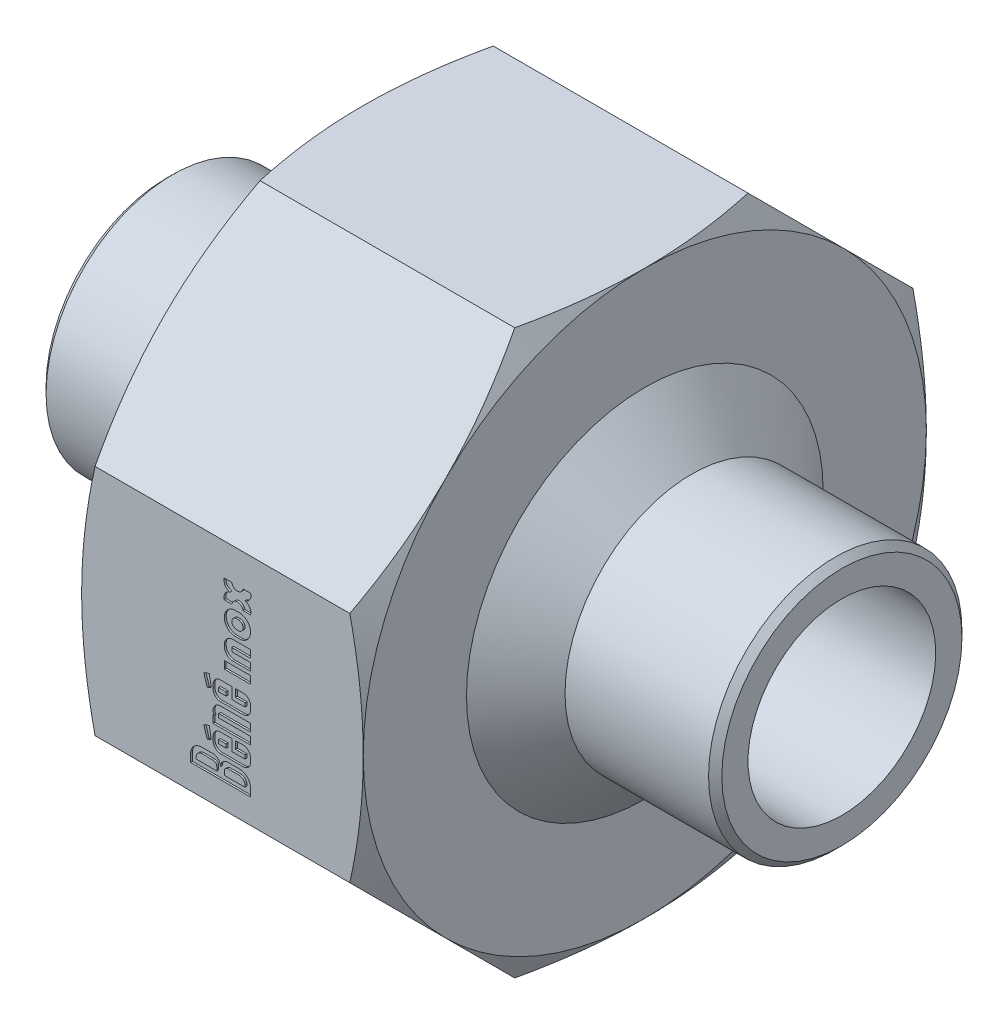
ISO-10303-21;
HEADER;
FILE_DESCRIPTION(('STEP AP214'),'2;1');
FILE_NAME('part.step','',(''),(''),'','','');
FILE_SCHEMA(('AUTOMOTIVE_DESIGN { 1 0 10303 214 1 1 1 1 }'));
ENDSEC;
DATA;
#1=APPLICATION_CONTEXT('core data for automotive mechanical design processes');
#2=APPLICATION_PROTOCOL_DEFINITION('international standard','automotive_design',2000,#1);
#3=PRODUCT_CONTEXT('',#1,'mechanical');
#4=PRODUCT('Part','Part','',(#3));
#5=PRODUCT_RELATED_PRODUCT_CATEGORY('part','',(#4));
#6=PRODUCT_DEFINITION_FORMATION('','',#4);
#7=PRODUCT_DEFINITION_CONTEXT('part definition',#1,'design');
#8=PRODUCT_DEFINITION('design','',#6,#7);
#9=PRODUCT_DEFINITION_SHAPE('','',#8);
#10=(LENGTH_UNIT() NAMED_UNIT(*) SI_UNIT(.MILLI.,.METRE.));
#11=(NAMED_UNIT(*) PLANE_ANGLE_UNIT() SI_UNIT($,.RADIAN.));
#12=(NAMED_UNIT(*) SI_UNIT($,.STERADIAN.) SOLID_ANGLE_UNIT());
#13=UNCERTAINTY_MEASURE_WITH_UNIT(LENGTH_MEASURE(1.E-05),#10,'distance_accuracy_value','');
#14=(GEOMETRIC_REPRESENTATION_CONTEXT(3) GLOBAL_UNCERTAINTY_ASSIGNED_CONTEXT((#13)) GLOBAL_UNIT_ASSIGNED_CONTEXT((#10,
#11,#12)) REPRESENTATION_CONTEXT('',''));
#15=CARTESIAN_POINT('',(0.,0.,0.));
#16=DIRECTION('',(0.,0.,1.));
#17=DIRECTION('',(1.,0.,0.));
#18=AXIS2_PLACEMENT_3D('',#15,#16,#17);
#19=CARTESIAN_POINT('',(7.5,0.,0.));
#20=DIRECTION('',(-1.,0.,0.));
#21=DIRECTION('',(0.,0.,1.));
#22=AXIS2_PLACEMENT_3D('',#19,#20,#21);
#23=CONICAL_SURFACE('',#22,15.,1.04719755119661);
#24=CARTESIAN_POINT('',(6.78646287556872,-6.21320225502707,15.));
#25=CARTESIAN_POINT('',(7.01239992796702,-5.19059588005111,15.));
#26=CARTESIAN_POINT('',(7.19259015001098,-4.15817620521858,15.));
#27=CARTESIAN_POINT('',(7.43673813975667,-2.08149739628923,15.));
#28=CARTESIAN_POINT('',(7.49999993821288,-1.04361662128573,15.));
#29=CARTESIAN_POINT('',(7.49999999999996,-1.53818713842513E-06,15.));
#30=B_SPLINE_CURVE_WITH_KNOTS('',3,(#24,#25,#26,#27,#28,#29),.UNSPECIFIED.,.F.,.F.,(4,2,4),
(15.4885178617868,18.633288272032,21.7780586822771),.UNSPECIFIED.);
#31=CARTESIAN_POINT('',(6.78646261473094,-6.2132034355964,15.));
#32=VERTEX_POINT('',#31);
#33=CARTESIAN_POINT('',(7.5,0.,15.));
#34=VERTEX_POINT('',#33);
#35=EDGE_CURVE('E1035',#32,#34,#30,.T.);
#36=ORIENTED_EDGE('',*,*,#35,.F.);
#37=CARTESIAN_POINT('',(7.5,-10.606602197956,10.6066012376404));
#38=CARTESIAN_POINT('',(7.50000002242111,-10.0000125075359,11.2131909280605));
#39=CARTESIAN_POINT('',(7.4574622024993,-9.39664145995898,11.8165619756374));
#40=CARTESIAN_POINT('',(7.25483871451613,-7.92565342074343,13.287550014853));
#41=CARTESIAN_POINT('',(7.05247172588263,-7.06454234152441,14.148661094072));
#42=CARTESIAN_POINT('',(6.78646261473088,-6.21320343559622,15.0000000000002));
#43=B_SPLINE_CURVE_WITH_KNOTS('',3,(#37,#38,#39,#40,#41,#42),.UNSPECIFIED.,.F.,.F.,(4,2,4),
(6.24697101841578,8.800493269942,12.4510526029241),.UNSPECIFIED.);
#44=CARTESIAN_POINT('',(7.5,-10.6066017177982,10.6066017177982));
#45=VERTEX_POINT('',#44);
#46=EDGE_CURVE('E1018',#45,#32,#43,.T.);
#47=ORIENTED_EDGE('',*,*,#46,.F.);
#48=CARTESIAN_POINT('',(7.5,0.,0.));
#49=DIRECTION('',(1.,0.,0.));
#50=DIRECTION('',(0.,0.,1.));
#51=AXIS2_PLACEMENT_3D('',#48,#49,#50);
#52=CIRCLE('',#51,15.);
#53=EDGE_CURVE('E1034',#34,#45,#52,.T.);
#54=ORIENTED_EDGE('',*,*,#53,.F.);
#55=EDGE_LOOP('',(#36,#47,#54));
#56=FACE_BOUND('',#55,.T.);
#57=ADVANCED_FACE('F16',(#56),#23,.T.);
#58=CARTESIAN_POINT('',(10.,6.2132034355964,15.));
#59=DIRECTION('',(0.,0.,-1.));
#60=DIRECTION('',(-1.,0.,0.));
#61=AXIS2_PLACEMENT_3D('',#58,#59,#60);
#62=PLANE('',#61);
#63=DIRECTION('',(0.316227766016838,-0.948683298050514,0.));
#64=VECTOR('',#63,1.);
#65=CARTESIAN_POINT('',(-1.,-0.4,15.));
#66=LINE('',#65,#64);
#67=CARTESIAN_POINT('',(-1.,-0.4,15.));
#68=VERTEX_POINT('',#67);
#69=CARTESIAN_POINT('',(-0.8,-1.,15.));
#70=VERTEX_POINT('',#69);
#71=EDGE_CURVE('E1811',#68,#70,#66,.T.);
#72=ORIENTED_EDGE('',*,*,#71,.F.);
#73=DIRECTION('',(-0.948683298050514,-0.316227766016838,0.));
#74=VECTOR('',#73,1.);
#75=CARTESIAN_POINT('',(-0.7,-0.3,15.));
#76=LINE('',#75,#74);
#77=CARTESIAN_POINT('',(-0.7,-0.3,15.));
#78=VERTEX_POINT('',#77);
#79=EDGE_CURVE('E1804',#78,#68,#76,.T.);
#80=ORIENTED_EDGE('',*,*,#79,.F.);
#81=DIRECTION('',(-0.164398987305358,0.986393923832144,0.));
#82=VECTOR('',#81,1.);
#83=CARTESIAN_POINT('',(-0.6,-0.9,15.));
#84=LINE('',#83,#82);
#85=CARTESIAN_POINT('',(-0.6,-0.9,15.));
#86=VERTEX_POINT('',#85);
#87=EDGE_CURVE('E1797',#86,#78,#84,.T.);
#88=ORIENTED_EDGE('',*,*,#87,.F.);
#89=DIRECTION('',(0.894427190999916,0.447213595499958,0.));
#90=VECTOR('',#89,1.);
#91=CARTESIAN_POINT('',(-0.8,-1.,15.));
#92=LINE('',#91,#90);
#93=EDGE_CURVE('E1792',#70,#86,#92,.T.);
#94=ORIENTED_EDGE('',*,*,#93,.F.);
#95=EDGE_LOOP('',(#72,#80,#88,#94));
#96=FACE_BOUND('',#95,.T.);
#97=DIRECTION('',(0.316227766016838,-0.948683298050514,0.));
#98=VECTOR('',#97,1.);
#99=CARTESIAN_POINT('',(-1.,-2.8,15.));
#100=LINE('',#99,#98);
#101=CARTESIAN_POINT('',(-1.,-2.8,15.));
#102=VERTEX_POINT('',#101);
#103=CARTESIAN_POINT('',(-0.8,-3.4,15.));
#104=VERTEX_POINT('',#103);
#105=EDGE_CURVE('E1786',#102,#104,#100,.T.);
#106=ORIENTED_EDGE('',*,*,#105,.F.);
#107=DIRECTION('',(-0.948683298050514,-0.316227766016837,0.));
#108=VECTOR('',#107,1.);
#109=CARTESIAN_POINT('',(-0.7,-2.7,15.));
#110=LINE('',#109,#108);
#111=CARTESIAN_POINT('',(-0.7,-2.7,15.));
#112=VERTEX_POINT('',#111);
#113=EDGE_CURVE('E1779',#112,#102,#110,.T.);
#114=ORIENTED_EDGE('',*,*,#113,.F.);
#115=DIRECTION('',(-0.164398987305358,0.986393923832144,0.));
#116=VECTOR('',#115,1.);
#117=CARTESIAN_POINT('',(-0.6,-3.3,15.));
#118=LINE('',#117,#116);
#119=CARTESIAN_POINT('',(-0.6,-3.3,15.));
#120=VERTEX_POINT('',#119);
#121=EDGE_CURVE('E1772',#120,#112,#118,.T.);
#122=ORIENTED_EDGE('',*,*,#121,.F.);
#123=DIRECTION('',(0.894427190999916,0.447213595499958,0.));
#124=VECTOR('',#123,1.);
#125=CARTESIAN_POINT('',(-0.8,-3.4,15.));
#126=LINE('',#125,#124);
#127=EDGE_CURVE('E1766',#104,#120,#126,.T.);
#128=ORIENTED_EDGE('',*,*,#127,.F.);
#129=EDGE_LOOP('',(#106,#114,#122,#128));
#130=FACE_BOUND('',#129,.T.);
#131=CARTESIAN_POINT('',(0.481106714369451,3.6091746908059,15.));
#132=DIRECTION('',(0.,0.,1.));
#133=DIRECTION('',(-0.19356088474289,0.981088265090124,0.));
#134=AXIS2_PLACEMENT_3D('',#131,#132,#133);
#135=CIRCLE('',#134,0.398358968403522);
#136=CARTESIAN_POINT('',(0.404,4.,15.));
#137=VERTEX_POINT('',#136);
#138=CARTESIAN_POINT('',(0.098,3.5,15.));
#139=VERTEX_POINT('',#138);
#140=EDGE_CURVE('E1760',#137,#139,#135,.T.);
#141=ORIENTED_EDGE('',*,*,#140,.F.);
#142=CARTESIAN_POINT('',(0.481106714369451,4.39082530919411,15.));
#143=DIRECTION('',(0.,0.,1.));
#144=DIRECTION('',(-0.961712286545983,0.274061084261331,0.));
#145=AXIS2_PLACEMENT_3D('',#142,#143,#144);
#146=CIRCLE('',#145,0.398358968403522);
#147=CARTESIAN_POINT('',(0.098,4.5,15.));
#148=VERTEX_POINT('',#147);
#149=EDGE_CURVE('E1754',#148,#137,#146,.T.);
#150=ORIENTED_EDGE('',*,*,#149,.F.);
#151=DIRECTION('',(-1.,0.,0.));
#152=VECTOR('',#151,1.);
#153=CARTESIAN_POINT('',(0.5,4.5,15.));
#154=LINE('',#153,#152);
#155=CARTESIAN_POINT('',(0.5,4.5,15.));
#156=VERTEX_POINT('',#155);
#157=EDGE_CURVE('E1747',#156,#148,#154,.T.);
#158=ORIENTED_EDGE('',*,*,#157,.F.);
#159=CARTESIAN_POINT('',(0.8,4.555,15.));
#160=DIRECTION('',(0.,0.,1.));
#161=DIRECTION('',(-0.983606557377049,-0.180327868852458,0.));
#162=AXIS2_PLACEMENT_3D('',#159,#160,#161);
#163=CIRCLE('',#162,0.305);
#164=CARTESIAN_POINT('',(1.1,4.5,15.));
#165=VERTEX_POINT('',#164);
#166=EDGE_CURVE('E1739',#156,#165,#163,.T.);
#167=ORIENTED_EDGE('',*,*,#166,.T.);
#168=DIRECTION('',(-1.,0.,0.));
#169=VECTOR('',#168,1.);
#170=CARTESIAN_POINT('',(1.5,4.5,15.));
#171=LINE('',#170,#169);
#172=CARTESIAN_POINT('',(1.5,4.5,15.));
#173=VERTEX_POINT('',#172);
#174=EDGE_CURVE('E1733',#173,#165,#171,.T.);
#175=ORIENTED_EDGE('',*,*,#174,.F.);
#176=CARTESIAN_POINT('',(1.11689328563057,4.39082530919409,15.));
#177=DIRECTION('',(0.,0.,1.));
#178=DIRECTION('',(0.193560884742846,-0.981088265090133,0.));
#179=AXIS2_PLACEMENT_3D('',#176,#177,#178);
#180=CIRCLE('',#179,0.398358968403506);
#181=CARTESIAN_POINT('',(1.194,4.,15.));
#182=VERTEX_POINT('',#181);
#183=EDGE_CURVE('E1727',#182,#173,#180,.T.);
#184=ORIENTED_EDGE('',*,*,#183,.F.);
#185=CARTESIAN_POINT('',(1.11689328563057,3.60917469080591,15.));
#186=DIRECTION('',(0.,0.,1.));
#187=DIRECTION('',(0.961712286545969,-0.274061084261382,0.));
#188=AXIS2_PLACEMENT_3D('',#185,#186,#187);
#189=CIRCLE('',#188,0.398358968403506);
#190=CARTESIAN_POINT('',(1.5,3.5,15.));
#191=VERTEX_POINT('',#190);
#192=EDGE_CURVE('E1721',#191,#182,#189,.T.);
#193=ORIENTED_EDGE('',*,*,#192,.F.);
#194=DIRECTION('',(1.,0.,0.));
#195=VECTOR('',#194,1.);
#196=CARTESIAN_POINT('',(1.1,3.5,15.));
#197=LINE('',#196,#195);
#198=CARTESIAN_POINT('',(1.1,3.5,15.));
#199=VERTEX_POINT('',#198);
#200=EDGE_CURVE('E1715',#199,#191,#197,.T.);
#201=ORIENTED_EDGE('',*,*,#200,.F.);
#202=CARTESIAN_POINT('',(0.8,3.445,15.));
#203=DIRECTION('',(0.,0.,1.));
#204=DIRECTION('',(0.983606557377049,0.180327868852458,0.));
#205=AXIS2_PLACEMENT_3D('',#202,#203,#204);
#206=CIRCLE('',#205,0.305);
#207=CARTESIAN_POINT('',(0.5,3.5,15.));
#208=VERTEX_POINT('',#207);
#209=EDGE_CURVE('E1707',#199,#208,#206,.T.);
#210=ORIENTED_EDGE('',*,*,#209,.T.);
#211=DIRECTION('',(1.,0.,0.));
#212=VECTOR('',#211,1.);
#213=CARTESIAN_POINT('',(0.098,3.5,15.));
#214=LINE('',#213,#212);
#215=EDGE_CURVE('E1700',#139,#208,#214,.T.);
#216=ORIENTED_EDGE('',*,*,#215,.F.);
#217=EDGE_LOOP('',(#141,#150,#158,#167,#175,#184,#193,#201,#210,#216));
#218=FACE_BOUND('',#217,.T.);
#219=CARTESIAN_POINT('',(0.707142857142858,2.7,15.));
#220=DIRECTION('',(0.,0.,1.));
#221=DIRECTION('',(-0.152941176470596,0.988235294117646,0.));
#222=AXIS2_PLACEMENT_3D('',#219,#220,#221);
#223=CIRCLE('',#222,0.607142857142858);
#224=CARTESIAN_POINT('',(0.61428571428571,3.3,15.));
#225=VERTEX_POINT('',#224);
#226=CARTESIAN_POINT('',(0.61428571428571,2.1,15.));
#227=VERTEX_POINT('',#226);
#228=EDGE_CURVE('E1692',#225,#227,#223,.T.);
#229=ORIENTED_EDGE('',*,*,#228,.F.);
#230=DIRECTION('',(-1.,0.,0.));
#231=VECTOR('',#230,1.);
#232=CARTESIAN_POINT('',(0.98571428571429,3.3,15.));
#233=LINE('',#232,#231);
#234=CARTESIAN_POINT('',(0.98571428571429,3.3,15.));
#235=VERTEX_POINT('',#234);
#236=EDGE_CURVE('E1686',#235,#225,#233,.T.);
#237=ORIENTED_EDGE('',*,*,#236,.F.);
#238=CARTESIAN_POINT('',(0.892857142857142,2.7,15.));
#239=DIRECTION('',(0.,0.,1.));
#240=DIRECTION('',(0.152941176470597,-0.988235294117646,0.));
#241=AXIS2_PLACEMENT_3D('',#238,#239,#240);
#242=CIRCLE('',#241,0.607142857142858);
#243=CARTESIAN_POINT('',(0.98571428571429,2.1,15.));
#244=VERTEX_POINT('',#243);
#245=EDGE_CURVE('E1679',#244,#235,#242,.T.);
#246=ORIENTED_EDGE('',*,*,#245,.F.);
#247=DIRECTION('',(1.,0.,0.));
#248=VECTOR('',#247,1.);
#249=CARTESIAN_POINT('',(0.61428571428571,2.1,15.));
#250=LINE('',#249,#248);
#251=EDGE_CURVE('E1673',#227,#244,#250,.T.);
#252=ORIENTED_EDGE('',*,*,#251,.F.);
#253=EDGE_LOOP('',(#229,#237,#246,#252));
#254=FACE_BOUND('',#253,.T.);
#255=CARTESIAN_POINT('',(0.560000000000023,1.36000000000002,15.));
#256=DIRECTION('',(0.,0.,1.));
#257=DIRECTION('',(-1.,0.,0.));
#258=AXIS2_PLACEMENT_3D('',#255,#256,#257);
#259=CIRCLE('',#258,0.460000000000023);
#260=CARTESIAN_POINT('',(0.1,1.36,15.));
#261=VERTEX_POINT('',#260);
#262=CARTESIAN_POINT('',(0.56,0.9,15.));
#263=VERTEX_POINT('',#262);
#264=EDGE_CURVE('E1665',#261,#263,#259,.T.);
#265=ORIENTED_EDGE('',*,*,#264,.F.);
#266=DIRECTION('',(0.,-1.,0.));
#267=VECTOR('',#266,1.);
#268=CARTESIAN_POINT('',(0.1,1.44,15.));
#269=LINE('',#268,#267);
#270=CARTESIAN_POINT('',(0.1,1.44,15.));
#271=VERTEX_POINT('',#270);
#272=EDGE_CURVE('E1658',#271,#261,#269,.T.);
#273=ORIENTED_EDGE('',*,*,#272,.F.);
#274=CARTESIAN_POINT('',(0.560000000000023,1.43999999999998,15.));
#275=DIRECTION('',(0.,0.,1.));
#276=DIRECTION('',(0.,1.,0.));
#277=AXIS2_PLACEMENT_3D('',#274,#275,#276);
#278=CIRCLE('',#277,0.460000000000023);
#279=CARTESIAN_POINT('',(0.56,1.9,15.));
#280=VERTEX_POINT('',#279);
#281=EDGE_CURVE('E1651',#280,#271,#278,.T.);
#282=ORIENTED_EDGE('',*,*,#281,.F.);
#283=DIRECTION('',(-1.,0.,0.));
#284=VECTOR('',#283,1.);
#285=CARTESIAN_POINT('',(1.5,1.9,15.));
#286=LINE('',#285,#284);
#287=CARTESIAN_POINT('',(1.5,1.9,15.));
#288=VERTEX_POINT('',#287);
#289=EDGE_CURVE('E1644',#288,#280,#286,.T.);
#290=ORIENTED_EDGE('',*,*,#289,.F.);
#291=DIRECTION('',(0.,1.,0.));
#292=VECTOR('',#291,1.);
#293=CARTESIAN_POINT('',(1.5,1.5,15.));
#294=LINE('',#293,#292);
#295=CARTESIAN_POINT('',(1.5,1.5,15.));
#296=VERTEX_POINT('',#295);
#297=EDGE_CURVE('E1637',#296,#288,#294,.T.);
#298=ORIENTED_EDGE('',*,*,#297,.F.);
#299=DIRECTION('',(1.,0.,0.));
#300=VECTOR('',#299,1.);
#301=CARTESIAN_POINT('',(0.5,1.5,15.));
#302=LINE('',#301,#300);
#303=CARTESIAN_POINT('',(0.5,1.5,15.));
#304=VERTEX_POINT('',#303);
#305=EDGE_CURVE('E1631',#304,#296,#302,.T.);
#306=ORIENTED_EDGE('',*,*,#305,.F.);
#307=DIRECTION('',(0.,1.,0.));
#308=VECTOR('',#307,1.);
#309=CARTESIAN_POINT('',(0.5,1.3,15.));
#310=LINE('',#309,#308);
#311=CARTESIAN_POINT('',(0.5,1.3,15.));
#312=VERTEX_POINT('',#311);
#313=EDGE_CURVE('E1625',#312,#304,#310,.T.);
#314=ORIENTED_EDGE('',*,*,#313,.F.);
#315=DIRECTION('',(-1.,0.,0.));
#316=VECTOR('',#315,1.);
#317=CARTESIAN_POINT('',(1.5,1.3,15.));
#318=LINE('',#317,#316);
#319=CARTESIAN_POINT('',(1.5,1.3,15.));
#320=VERTEX_POINT('',#319);
#321=EDGE_CURVE('E1619',#320,#312,#318,.T.);
#322=ORIENTED_EDGE('',*,*,#321,.F.);
#323=DIRECTION('',(0.,1.,0.));
#324=VECTOR('',#323,1.);
#325=CARTESIAN_POINT('',(1.5,0.9,15.));
#326=LINE('',#325,#324);
#327=CARTESIAN_POINT('',(1.5,0.9,15.));
#328=VERTEX_POINT('',#327);
#329=EDGE_CURVE('E1612',#328,#320,#326,.T.);
#330=ORIENTED_EDGE('',*,*,#329,.F.);
#331=DIRECTION('',(1.,0.,0.));
#332=VECTOR('',#331,1.);
#333=CARTESIAN_POINT('',(0.56,0.9,15.));
#334=LINE('',#333,#332);
#335=EDGE_CURVE('E1606',#263,#328,#334,.T.);
#336=ORIENTED_EDGE('',*,*,#335,.F.);
#337=EDGE_LOOP('',(#265,#273,#282,#290,#298,#306,#314,#322,#330,#336));
#338=FACE_BOUND('',#337,.T.);
#339=DIRECTION('',(1.,0.,0.));
#340=VECTOR('',#339,1.);
#341=CARTESIAN_POINT('',(0.1,0.3,15.));
#342=LINE('',#341,#340);
#343=CARTESIAN_POINT('',(0.1,0.3,15.));
#344=VERTEX_POINT('',#343);
#345=CARTESIAN_POINT('',(1.5,0.3,15.));
#346=VERTEX_POINT('',#345);
#347=EDGE_CURVE('E1599',#344,#346,#342,.T.);
#348=ORIENTED_EDGE('',*,*,#347,.F.);
#349=DIRECTION('',(0.,-1.,0.));
#350=VECTOR('',#349,1.);
#351=CARTESIAN_POINT('',(0.1,0.7,15.));
#352=LINE('',#351,#350);
#353=CARTESIAN_POINT('',(0.1,0.7,15.));
#354=VERTEX_POINT('',#353);
#355=EDGE_CURVE('E1592',#354,#344,#352,.T.);
#356=ORIENTED_EDGE('',*,*,#355,.F.);
#357=DIRECTION('',(-1.,0.,0.));
#358=VECTOR('',#357,1.);
#359=CARTESIAN_POINT('',(1.5,0.7,15.));
#360=LINE('',#359,#358);
#361=CARTESIAN_POINT('',(1.5,0.7,15.));
#362=VERTEX_POINT('',#361);
#363=EDGE_CURVE('E1586',#362,#354,#360,.T.);
#364=ORIENTED_EDGE('',*,*,#363,.F.);
#365=DIRECTION('',(0.,1.,0.));
#366=VECTOR('',#365,1.);
#367=CARTESIAN_POINT('',(1.5,0.3,15.));
#368=LINE('',#367,#366);
#369=EDGE_CURVE('E1579',#346,#362,#368,.T.);
#370=ORIENTED_EDGE('',*,*,#369,.F.);
#371=EDGE_LOOP('',(#348,#356,#364,#370));
#372=FACE_BOUND('',#371,.T.);
#373=CARTESIAN_POINT('',(-0.0999999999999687,-0.899999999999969,15.));
#374=DIRECTION('',(0.,0.,1.));
#375=DIRECTION('',(-1.,0.,0.));
#376=AXIS2_PLACEMENT_3D('',#373,#374,#375);
#377=CIRCLE('',#376,0.400000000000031);
#378=CARTESIAN_POINT('',(-0.5,-0.9,15.));
#379=VERTEX_POINT('',#378);
#380=CARTESIAN_POINT('',(-0.1,-1.3,15.));
#381=VERTEX_POINT('',#380);
#382=EDGE_CURVE('E1571',#379,#381,#377,.T.);
#383=ORIENTED_EDGE('',*,*,#382,.F.);
#384=DIRECTION('',(0.,-1.,0.));
#385=VECTOR('',#384,1.);
#386=CARTESIAN_POINT('',(-0.5,-0.7,15.));
#387=LINE('',#386,#385);
#388=CARTESIAN_POINT('',(-0.5,-0.7,15.));
#389=VERTEX_POINT('',#388);
#390=EDGE_CURVE('E1564',#389,#379,#387,.T.);
#391=ORIENTED_EDGE('',*,*,#390,.F.);
#392=CARTESIAN_POINT('',(-0.100000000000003,-0.7,15.));
#393=DIRECTION('',(0.,0.,1.));
#394=DIRECTION('',(0.,1.,0.));
#395=AXIS2_PLACEMENT_3D('',#392,#393,#394);
#396=CIRCLE('',#395,0.4);
#397=CARTESIAN_POINT('',(-0.1,-0.3,15.));
#398=VERTEX_POINT('',#397);
#399=EDGE_CURVE('E1557',#398,#389,#396,.T.);
#400=ORIENTED_EDGE('',*,*,#399,.F.);
#401=DIRECTION('',(-1.,0.,0.));
#402=VECTOR('',#401,1.);
#403=CARTESIAN_POINT('',(0.5,-0.3,15.));
#404=LINE('',#403,#402);
#405=CARTESIAN_POINT('',(0.5,-0.3,15.));
#406=VERTEX_POINT('',#405);
#407=EDGE_CURVE('E1552',#406,#398,#404,.T.);
#408=ORIENTED_EDGE('',*,*,#407,.F.);
#409=DIRECTION('',(0.,1.,0.));
#410=VECTOR('',#409,1.);
#411=CARTESIAN_POINT('',(0.5,-0.9,15.));
#412=LINE('',#411,#410);
#413=CARTESIAN_POINT('',(0.5,-0.9,15.));
#414=VERTEX_POINT('',#413);
#415=EDGE_CURVE('E1547',#414,#406,#412,.T.);
#416=ORIENTED_EDGE('',*,*,#415,.F.);
#417=DIRECTION('',(-1.,0.,0.));
#418=VECTOR('',#417,1.);
#419=CARTESIAN_POINT('',(1.2,-0.9,15.));
#420=LINE('',#419,#418);
#421=CARTESIAN_POINT('',(1.2,-0.9,15.));
#422=VERTEX_POINT('',#421);
#423=EDGE_CURVE('E1540',#422,#414,#420,.T.);
#424=ORIENTED_EDGE('',*,*,#423,.F.);
#425=DIRECTION('',(0.,-1.,0.));
#426=VECTOR('',#425,1.);
#427=CARTESIAN_POINT('',(1.2,-0.7,15.));
#428=LINE('',#427,#426);
#429=CARTESIAN_POINT('',(1.2,-0.7,15.));
#430=VERTEX_POINT('',#429);
#431=EDGE_CURVE('E1535',#430,#422,#428,.T.);
#432=ORIENTED_EDGE('',*,*,#431,.F.);
#433=DIRECTION('',(1.,0.,0.));
#434=VECTOR('',#433,1.);
#435=CARTESIAN_POINT('',(0.7,-0.7,15.));
#436=LINE('',#435,#434);
#437=CARTESIAN_POINT('',(0.7,-0.7,15.));
#438=VERTEX_POINT('',#437);
#439=EDGE_CURVE('E1529',#438,#430,#436,.T.);
#440=ORIENTED_EDGE('',*,*,#439,.F.);
#441=DIRECTION('',(0.,-1.,0.));
#442=VECTOR('',#441,1.);
#443=CARTESIAN_POINT('',(0.7,-0.3,15.));
#444=LINE('',#443,#442);
#445=CARTESIAN_POINT('',(0.7,-0.3,15.));
#446=VERTEX_POINT('',#445);
#447=EDGE_CURVE('E1522',#446,#438,#444,.T.);
#448=ORIENTED_EDGE('',*,*,#447,.F.);
#449=DIRECTION('',(-1.,0.,0.));
#450=VECTOR('',#449,1.);
#451=CARTESIAN_POINT('',(1.1,-0.3,15.));
#452=LINE('',#451,#450);
#453=CARTESIAN_POINT('',(1.1,-0.3,15.));
#454=VERTEX_POINT('',#453);
#455=EDGE_CURVE('E1516',#454,#446,#452,.T.);
#456=ORIENTED_EDGE('',*,*,#455,.F.);
#457=CARTESIAN_POINT('',(1.09999999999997,-0.700000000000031,15.));
#458=DIRECTION('',(0.,0.,1.));
#459=DIRECTION('',(1.,0.,0.));
#460=AXIS2_PLACEMENT_3D('',#457,#458,#459);
#461=CIRCLE('',#460,0.40000000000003);
#462=CARTESIAN_POINT('',(1.5,-0.7,15.));
#463=VERTEX_POINT('',#462);
#464=EDGE_CURVE('E1510',#463,#454,#461,.T.);
#465=ORIENTED_EDGE('',*,*,#464,.F.);
#466=DIRECTION('',(0.,1.,0.));
#467=VECTOR('',#466,1.);
#468=CARTESIAN_POINT('',(1.5,-0.9,15.));
#469=LINE('',#468,#467);
#470=CARTESIAN_POINT('',(1.5,-0.9,15.));
#471=VERTEX_POINT('',#470);
#472=EDGE_CURVE('E1504',#471,#463,#469,.T.);
#473=ORIENTED_EDGE('',*,*,#472,.F.);
#474=CARTESIAN_POINT('',(1.09999999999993,-0.899999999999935,15.));
#475=DIRECTION('',(0.,0.,1.));
#476=DIRECTION('',(1.64868119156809E-13,-1.,0.));
#477=AXIS2_PLACEMENT_3D('',#474,#475,#476);
#478=CIRCLE('',#477,0.400000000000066);
#479=CARTESIAN_POINT('',(1.1,-1.3,15.));
#480=VERTEX_POINT('',#479);
#481=EDGE_CURVE('E1497',#480,#471,#478,.T.);
#482=ORIENTED_EDGE('',*,*,#481,.F.);
#483=DIRECTION('',(1.,0.,0.));
#484=VECTOR('',#483,1.);
#485=CARTESIAN_POINT('',(-0.1,-1.3,15.));
#486=LINE('',#485,#484);
#487=EDGE_CURVE('E1491',#381,#480,#486,.T.);
#488=ORIENTED_EDGE('',*,*,#487,.F.);
#489=EDGE_LOOP('',(#383,#391,#400,#408,#416,#424,#432,#440,#448,#456,#465,#473,#482,#488));
#490=FACE_BOUND('',#489,.T.);
#491=CARTESIAN_POINT('',(-0.100000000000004,-1.9,15.));
#492=DIRECTION('',(0.,0.,1.));
#493=DIRECTION('',(0.,1.,0.));
#494=AXIS2_PLACEMENT_3D('',#491,#492,#493);
#495=CIRCLE('',#494,0.4);
#496=CARTESIAN_POINT('',(-0.1,-1.5,15.));
#497=VERTEX_POINT('',#496);
#498=CARTESIAN_POINT('',(-0.44641016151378,-2.1,15.));
#499=VERTEX_POINT('',#498);
#500=EDGE_CURVE('E1483',#497,#499,#495,.T.);
#501=ORIENTED_EDGE('',*,*,#500,.F.);
#502=DIRECTION('',(-1.,0.,0.));
#503=VECTOR('',#502,1.);
#504=CARTESIAN_POINT('',(1.5,-1.5,15.));
#505=LINE('',#504,#503);
#506=CARTESIAN_POINT('',(1.5,-1.5,15.));
#507=VERTEX_POINT('',#506);
#508=EDGE_CURVE('E1476',#507,#497,#505,.T.);
#509=ORIENTED_EDGE('',*,*,#508,.F.);
#510=DIRECTION('',(0.,1.,0.));
#511=VECTOR('',#510,1.);
#512=CARTESIAN_POINT('',(1.5,-1.9,15.));
#513=LINE('',#512,#511);
#514=CARTESIAN_POINT('',(1.5,-1.9,15.));
#515=VERTEX_POINT('',#514);
#516=EDGE_CURVE('E1470',#515,#507,#513,.T.);
#517=ORIENTED_EDGE('',*,*,#516,.F.);
#518=DIRECTION('',(1.,0.,0.));
#519=VECTOR('',#518,1.);
#520=CARTESIAN_POINT('',(-0.2,-1.9,15.));
#521=LINE('',#520,#519);
#522=CARTESIAN_POINT('',(-0.2,-1.9,15.));
#523=VERTEX_POINT('',#522);
#524=EDGE_CURVE('E1464',#523,#515,#521,.T.);
#525=ORIENTED_EDGE('',*,*,#524,.F.);
#526=DIRECTION('',(0.,1.,0.));
#527=VECTOR('',#526,1.);
#528=CARTESIAN_POINT('',(-0.2,-2.1,15.));
#529=LINE('',#528,#527);
#530=CARTESIAN_POINT('',(-0.2,-2.1,15.));
#531=VERTEX_POINT('',#530);
#532=EDGE_CURVE('E1457',#531,#523,#529,.T.);
#533=ORIENTED_EDGE('',*,*,#532,.F.);
#534=DIRECTION('',(-1.,0.,0.));
#535=VECTOR('',#534,1.);
#536=CARTESIAN_POINT('',(1.5,-2.1,15.));
#537=LINE('',#536,#535);
#538=CARTESIAN_POINT('',(1.5,-2.1,15.));
#539=VERTEX_POINT('',#538);
#540=EDGE_CURVE('E1451',#539,#531,#537,.T.);
#541=ORIENTED_EDGE('',*,*,#540,.F.);
#542=DIRECTION('',(0.,1.,0.));
#543=VECTOR('',#542,1.);
#544=CARTESIAN_POINT('',(1.5,-2.5,15.));
#545=LINE('',#544,#543);
#546=CARTESIAN_POINT('',(1.5,-2.5,15.));
#547=VERTEX_POINT('',#546);
#548=EDGE_CURVE('E1446',#547,#539,#545,.T.);
#549=ORIENTED_EDGE('',*,*,#548,.F.);
#550=DIRECTION('',(1.,0.,0.));
#551=VECTOR('',#550,1.);
#552=CARTESIAN_POINT('',(-0.5,-2.5,15.));
#553=LINE('',#552,#551);
#554=CARTESIAN_POINT('',(-0.5,-2.5,15.));
#555=VERTEX_POINT('',#554);
#556=EDGE_CURVE('E1440',#555,#547,#553,.T.);
#557=ORIENTED_EDGE('',*,*,#556,.F.);
#558=DIRECTION('',(0.,-1.,0.));
#559=VECTOR('',#558,1.);
#560=CARTESIAN_POINT('',(-0.5,-2.1,15.));
#561=LINE('',#560,#559);
#562=CARTESIAN_POINT('',(-0.5,-2.1,15.));
#563=VERTEX_POINT('',#562);
#564=EDGE_CURVE('E1433',#563,#555,#561,.T.);
#565=ORIENTED_EDGE('',*,*,#564,.F.);
#566=DIRECTION('',(-1.,0.,0.));
#567=VECTOR('',#566,1.);
#568=CARTESIAN_POINT('',(-0.44641016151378,-2.1,15.));
#569=LINE('',#568,#567);
#570=EDGE_CURVE('E1427',#499,#563,#569,.T.);
#571=ORIENTED_EDGE('',*,*,#570,.F.);
#572=EDGE_LOOP('',(#501,#509,#517,#525,#533,#541,#549,#557,#565,#571));
#573=FACE_BOUND('',#572,.T.);
#574=CARTESIAN_POINT('',(-0.0999999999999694,-3.3,15.));
#575=DIRECTION('',(0.,0.,1.));
#576=DIRECTION('',(-1.,0.,0.));
#577=AXIS2_PLACEMENT_3D('',#574,#575,#576);
#578=CIRCLE('',#577,0.40000000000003);
#579=CARTESIAN_POINT('',(-0.5,-3.3,15.));
#580=VERTEX_POINT('',#579);
#581=CARTESIAN_POINT('',(-0.1,-3.7,15.));
#582=VERTEX_POINT('',#581);
#583=EDGE_CURVE('E1419',#580,#582,#578,.T.);
#584=ORIENTED_EDGE('',*,*,#583,.F.);
#585=DIRECTION('',(0.,-1.,0.));
#586=VECTOR('',#585,1.);
#587=CARTESIAN_POINT('',(-0.5,-3.1,15.));
#588=LINE('',#587,#586);
#589=CARTESIAN_POINT('',(-0.5,-3.1,15.));
#590=VERTEX_POINT('',#589);
#591=EDGE_CURVE('E1412',#590,#580,#588,.T.);
#592=ORIENTED_EDGE('',*,*,#591,.F.);
#593=CARTESIAN_POINT('',(-0.0999999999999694,-3.1,15.));
#594=DIRECTION('',(0.,0.,1.));
#595=DIRECTION('',(0.,1.,0.));
#596=AXIS2_PLACEMENT_3D('',#593,#594,#595);
#597=CIRCLE('',#596,0.40000000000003);
#598=CARTESIAN_POINT('',(-0.1,-2.7,15.));
#599=VERTEX_POINT('',#598);
#600=EDGE_CURVE('E1405',#599,#590,#597,.T.);
#601=ORIENTED_EDGE('',*,*,#600,.F.);
#602=DIRECTION('',(-1.,0.,0.));
#603=VECTOR('',#602,1.);
#604=CARTESIAN_POINT('',(0.5,-2.7,15.));
#605=LINE('',#604,#603);
#606=CARTESIAN_POINT('',(0.5,-2.7,15.));
#607=VERTEX_POINT('',#606);
#608=EDGE_CURVE('E1399',#607,#599,#605,.T.);
#609=ORIENTED_EDGE('',*,*,#608,.F.);
#610=DIRECTION('',(0.,1.,0.));
#611=VECTOR('',#610,1.);
#612=CARTESIAN_POINT('',(0.5,-3.3,15.));
#613=LINE('',#612,#611);
#614=CARTESIAN_POINT('',(0.5,-3.3,15.));
#615=VERTEX_POINT('',#614);
#616=EDGE_CURVE('E1392',#615,#607,#613,.T.);
#617=ORIENTED_EDGE('',*,*,#616,.F.);
#618=DIRECTION('',(-1.,0.,0.));
#619=VECTOR('',#618,1.);
#620=CARTESIAN_POINT('',(1.2,-3.3,15.));
#621=LINE('',#620,#619);
#622=CARTESIAN_POINT('',(1.2,-3.3,15.));
#623=VERTEX_POINT('',#622);
#624=EDGE_CURVE('E1385',#623,#615,#621,.T.);
#625=ORIENTED_EDGE('',*,*,#624,.F.);
#626=DIRECTION('',(0.,-1.,0.));
#627=VECTOR('',#626,1.);
#628=CARTESIAN_POINT('',(1.2,-3.1,15.));
#629=LINE('',#628,#627);
#630=CARTESIAN_POINT('',(1.2,-3.1,15.));
#631=VERTEX_POINT('',#630);
#632=EDGE_CURVE('E1380',#631,#623,#629,.T.);
#633=ORIENTED_EDGE('',*,*,#632,.F.);
#634=DIRECTION('',(1.,0.,0.));
#635=VECTOR('',#634,1.);
#636=CARTESIAN_POINT('',(0.7,-3.1,15.));
#637=LINE('',#636,#635);
#638=CARTESIAN_POINT('',(0.7,-3.1,15.));
#639=VERTEX_POINT('',#638);
#640=EDGE_CURVE('E1374',#639,#631,#637,.T.);
#641=ORIENTED_EDGE('',*,*,#640,.F.);
#642=DIRECTION('',(0.,-1.,0.));
#643=VECTOR('',#642,1.);
#644=CARTESIAN_POINT('',(0.7,-2.7,15.));
#645=LINE('',#644,#643);
#646=CARTESIAN_POINT('',(0.7,-2.7,15.));
#647=VERTEX_POINT('',#646);
#648=EDGE_CURVE('E1368',#647,#639,#645,.T.);
#649=ORIENTED_EDGE('',*,*,#648,.F.);
#650=DIRECTION('',(-1.,0.,0.));
#651=VECTOR('',#650,1.);
#652=CARTESIAN_POINT('',(1.1,-2.7,15.));
#653=LINE('',#652,#651);
#654=CARTESIAN_POINT('',(1.1,-2.7,15.));
#655=VERTEX_POINT('',#654);
#656=EDGE_CURVE('E1363',#655,#647,#653,.T.);
#657=ORIENTED_EDGE('',*,*,#656,.F.);
#658=CARTESIAN_POINT('',(1.09999999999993,-3.10000000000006,15.));
#659=DIRECTION('',(0.,0.,1.));
#660=DIRECTION('',(1.,0.,0.));
#661=AXIS2_PLACEMENT_3D('',#658,#659,#660);
#662=CIRCLE('',#661,0.400000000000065);
#663=CARTESIAN_POINT('',(1.5,-3.1,15.));
#664=VERTEX_POINT('',#663);
#665=EDGE_CURVE('E1356',#664,#655,#662,.T.);
#666=ORIENTED_EDGE('',*,*,#665,.F.);
#667=DIRECTION('',(0.,1.,0.));
#668=VECTOR('',#667,1.);
#669=CARTESIAN_POINT('',(1.5,-3.3,15.));
#670=LINE('',#669,#668);
#671=CARTESIAN_POINT('',(1.5,-3.3,15.));
#672=VERTEX_POINT('',#671);
#673=EDGE_CURVE('E1349',#672,#664,#670,.T.);
#674=ORIENTED_EDGE('',*,*,#673,.F.);
#675=CARTESIAN_POINT('',(1.09999999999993,-3.29999999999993,15.));
#676=DIRECTION('',(0.,0.,1.));
#677=DIRECTION('',(1.64868119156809E-13,-1.,0.));
#678=AXIS2_PLACEMENT_3D('',#675,#676,#677);
#679=CIRCLE('',#678,0.400000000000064);
#680=CARTESIAN_POINT('',(1.1,-3.7,15.));
#681=VERTEX_POINT('',#680);
#682=EDGE_CURVE('E1343',#681,#672,#679,.T.);
#683=ORIENTED_EDGE('',*,*,#682,.F.);
#684=DIRECTION('',(1.,0.,0.));
#685=VECTOR('',#684,1.);
#686=CARTESIAN_POINT('',(-0.1,-3.7,15.));
#687=LINE('',#686,#685);
#688=EDGE_CURVE('E1337',#582,#681,#687,.T.);
#689=ORIENTED_EDGE('',*,*,#688,.F.);
#690=EDGE_LOOP('',(#584,#592,#601,#609,#617,#625,#633,#641,#649,#657,#666,#674,#683,#689));
#691=FACE_BOUND('',#690,.T.);
#692=DIRECTION('',(0.,-1.,0.));
#693=VECTOR('',#692,1.);
#694=CARTESIAN_POINT('',(-1.7,-4.5,15.));
#695=LINE('',#694,#693);
#696=CARTESIAN_POINT('',(-1.7,-4.5,15.));
#697=VERTEX_POINT('',#696);
#698=CARTESIAN_POINT('',(-1.7,-4.9,15.));
#699=VERTEX_POINT('',#698);
#700=EDGE_CURVE('E1330',#697,#699,#695,.T.);
#701=ORIENTED_EDGE('',*,*,#700,.F.);
#702=CARTESIAN_POINT('',(-1.0999999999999,-4.5000000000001,15.));
#703=DIRECTION('',(0.,0.,1.));
#704=DIRECTION('',(-1.63572858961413E-13,1.,0.));
#705=AXIS2_PLACEMENT_3D('',#702,#703,#704);
#706=CIRCLE('',#705,0.600000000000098);
#707=CARTESIAN_POINT('',(-1.1,-3.9,15.));
#708=VERTEX_POINT('',#707);
#709=EDGE_CURVE('E1323',#708,#697,#706,.T.);
#710=ORIENTED_EDGE('',*,*,#709,.F.);
#711=DIRECTION('',(-1.,0.,0.));
#712=VECTOR('',#711,1.);
#713=CARTESIAN_POINT('',(-0.5,-3.9,15.));
#714=LINE('',#713,#712);
#715=CARTESIAN_POINT('',(-0.5,-3.9,15.));
#716=VERTEX_POINT('',#715);
#717=EDGE_CURVE('E1316',#716,#708,#714,.T.);
#718=ORIENTED_EDGE('',*,*,#717,.F.);
#719=CARTESIAN_POINT('',(-0.50000000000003,-4.3,15.));
#720=DIRECTION('',(0.,0.,1.));
#721=DIRECTION('',(1.,0.,0.));
#722=AXIS2_PLACEMENT_3D('',#719,#720,#721);
#723=CIRCLE('',#722,0.40000000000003);
#724=CARTESIAN_POINT('',(-0.1,-4.3,15.));
#725=VERTEX_POINT('',#724);
#726=EDGE_CURVE('E1309',#725,#716,#723,.T.);
#727=ORIENTED_EDGE('',*,*,#726,.F.);
#728=CARTESIAN_POINT('',(0.300000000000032,-4.3,15.));
#729=DIRECTION('',(0.,0.,1.));
#730=DIRECTION('',(0.,1.,0.));
#731=AXIS2_PLACEMENT_3D('',#728,#729,#730);
#732=CIRCLE('',#731,0.400000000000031);
#733=CARTESIAN_POINT('',(0.3,-3.9,15.));
#734=VERTEX_POINT('',#733);
#735=EDGE_CURVE('E1302',#734,#725,#732,.T.);
#736=ORIENTED_EDGE('',*,*,#735,.F.);
#737=DIRECTION('',(-1.,0.,0.));
#738=VECTOR('',#737,1.);
#739=CARTESIAN_POINT('',(0.89999999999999,-3.9,15.));
#740=LINE('',#739,#738);
#741=CARTESIAN_POINT('',(0.89999999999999,-3.9,15.));
#742=VERTEX_POINT('',#741);
#743=EDGE_CURVE('E1295',#742,#734,#740,.T.);
#744=ORIENTED_EDGE('',*,*,#743,.F.);
#745=CARTESIAN_POINT('',(0.899999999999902,-4.5000000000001,15.));
#746=DIRECTION('',(0.,0.,1.));
#747=DIRECTION('',(1.,0.,0.));
#748=AXIS2_PLACEMENT_3D('',#745,#746,#747);
#749=CIRCLE('',#748,0.600000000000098);
#750=CARTESIAN_POINT('',(1.5,-4.5,15.));
#751=VERTEX_POINT('',#750);
#752=EDGE_CURVE('E1289',#751,#742,#749,.T.);
#753=ORIENTED_EDGE('',*,*,#752,.F.);
#754=DIRECTION('',(0.,1.,0.));
#755=VECTOR('',#754,1.);
#756=CARTESIAN_POINT('',(1.5,-4.9,15.));
#757=LINE('',#756,#755);
#758=CARTESIAN_POINT('',(1.5,-4.9,15.));
#759=VERTEX_POINT('',#758);
#760=EDGE_CURVE('E1282',#759,#751,#757,.T.);
#761=ORIENTED_EDGE('',*,*,#760,.F.);
#762=DIRECTION('',(1.,0.,0.));
#763=VECTOR('',#762,1.);
#764=CARTESIAN_POINT('',(-1.7,-4.9,15.));
#765=LINE('',#764,#763);
#766=EDGE_CURVE('E1166',#699,#759,#765,.T.);
#767=ORIENTED_EDGE('',*,*,#766,.F.);
#768=EDGE_LOOP('',(#701,#710,#718,#727,#736,#744,#753,#761,#767));
#769=FACE_BOUND('',#768,.T.);
#770=ORIENTED_EDGE('',*,*,#35,.T.);
#771=CARTESIAN_POINT('',(7.49999999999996,-1.53818713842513E-06,15.));
#772=CARTESIAN_POINT('',(7.5000000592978,1.00156922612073,15.));
#773=CARTESIAN_POINT('',(7.4416168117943,1.99930475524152,15.));
#774=CARTESIAN_POINT('',(7.20674223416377,4.0770210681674,15.));
#775=CARTESIAN_POINT('',(7.02146213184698,5.14957970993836,15.));
#776=CARTESIAN_POINT('',(6.78646290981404,6.21320210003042,15.));
#777=B_SPLINE_CURVE_WITH_KNOTS('',3,(#771,#772,#773,#774,#775,#776),.UNSPECIFIED.,.F.,.F.,(4,2,
4),(21.7780586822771,24.7726026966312,28.0270555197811),.UNSPECIFIED.);
#778=CARTESIAN_POINT('',(6.78646261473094,6.2132034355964,15.));
#779=VERTEX_POINT('',#778);
#780=EDGE_CURVE('E1154',#34,#779,#777,.T.);
#781=ORIENTED_EDGE('',*,*,#780,.T.);
#782=DIRECTION('',(-1.,0.,0.));
#783=VECTOR('',#782,1.);
#784=CARTESIAN_POINT('',(6.78646261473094,6.2132034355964,15.));
#785=LINE('',#784,#783);
#786=CARTESIAN_POINT('',(-6.78646261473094,6.2132034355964,15.));
#787=VERTEX_POINT('',#786);
#788=EDGE_CURVE('E1164',#779,#787,#785,.T.);
#789=ORIENTED_EDGE('',*,*,#788,.T.);
#790=CARTESIAN_POINT('',(-6.78646287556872,6.21320225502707,15.));
#791=CARTESIAN_POINT('',(-7.01239992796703,5.19059588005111,15.));
#792=CARTESIAN_POINT('',(-7.19259015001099,4.15817620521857,15.));
#793=CARTESIAN_POINT('',(-7.43673813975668,2.08149739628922,15.));
#794=CARTESIAN_POINT('',(-7.49999993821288,1.04361662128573,15.));
#795=CARTESIAN_POINT('',(-7.49999999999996,1.53818713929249E-06,15.));
#796=B_SPLINE_CURVE_WITH_KNOTS('',3,(#790,#791,#792,#793,#794,#795),.UNSPECIFIED.,.F.,.F.,(4,2,
4),(15.4885178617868,18.633288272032,21.7780586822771),.UNSPECIFIED.);
#797=CARTESIAN_POINT('',(-7.5,0.,15.));
#798=VERTEX_POINT('',#797);
#799=EDGE_CURVE('E1181',#787,#798,#796,.T.);
#800=ORIENTED_EDGE('',*,*,#799,.T.);
#801=CARTESIAN_POINT('',(-7.49999999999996,1.53818713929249E-06,15.));
#802=CARTESIAN_POINT('',(-7.5000000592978,-1.00156922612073,15.));
#803=CARTESIAN_POINT('',(-7.44161681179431,-1.99930475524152,15.));
#804=CARTESIAN_POINT('',(-7.20674223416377,-4.0770210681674,15.));
#805=CARTESIAN_POINT('',(-7.02146213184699,-5.14957970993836,15.));
#806=CARTESIAN_POINT('',(-6.78646290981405,-6.21320210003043,15.));
#807=B_SPLINE_CURVE_WITH_KNOTS('',3,(#801,#802,#803,#804,#805,#806),.UNSPECIFIED.,.F.,.F.,(4,2,
4),(21.7780586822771,24.7726026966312,28.0270555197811),.UNSPECIFIED.);
#808=CARTESIAN_POINT('',(-6.78646261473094,-6.2132034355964,15.));
#809=VERTEX_POINT('',#808);
#810=EDGE_CURVE('E1046',#798,#809,#807,.T.);
#811=ORIENTED_EDGE('',*,*,#810,.T.);
#812=DIRECTION('',(-1.,0.,0.));
#813=VECTOR('',#812,1.);
#814=CARTESIAN_POINT('',(6.78646261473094,-6.2132034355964,15.));
#815=LINE('',#814,#813);
#816=EDGE_CURVE('E1023',#32,#809,#815,.T.);
#817=ORIENTED_EDGE('',*,*,#816,.F.);
#818=EDGE_LOOP('',(#770,#781,#789,#800,#811,#817));
#819=FACE_BOUND('',#818,.T.);
#820=ADVANCED_FACE('F1041',(#96,#130,#218,#254,#338,#372,#490,#573,#691,#769,#819),#62,.F.);
#821=CARTESIAN_POINT('',(10.,-6.2132034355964,15.));
#822=DIRECTION('',(0.,0.707106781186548,-0.707106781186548));
#823=DIRECTION('',(0.,0.707106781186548,0.707106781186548));
#824=AXIS2_PLACEMENT_3D('',#821,#822,#823);
#825=PLANE('',#824);
#826=CARTESIAN_POINT('',(6.78646261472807,-15.0000000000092,6.21320343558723));
#827=CARTESIAN_POINT('',(7.01249780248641,-14.2765941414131,6.93660929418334));
#828=CARTESIAN_POINT('',(7.19279880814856,-13.5459257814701,7.66727765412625));
#829=CARTESIAN_POINT('',(7.43684695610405,-12.0774833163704,9.13572011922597));
#830=CARTESIAN_POINT('',(7.49999997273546,-11.3442280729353,9.86897536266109));
#831=CARTESIAN_POINT('',(7.5,-10.606602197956,10.6066012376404));
#832=B_SPLINE_CURVE_WITH_KNOTS('',3,(#826,#827,#828,#829,#830,#831),.UNSPECIFIED.,.F.,.F.,(4,2,
4),(0.000286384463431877,3.12362870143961,6.24697101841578),.UNSPECIFIED.);
#833=CARTESIAN_POINT('',(6.78646261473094,-15.,6.2132034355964));
#834=VERTEX_POINT('',#833);
#835=EDGE_CURVE('E1026',#834,#45,#832,.T.);
#836=ORIENTED_EDGE('',*,*,#835,.T.);
#837=ORIENTED_EDGE('',*,*,#46,.T.);
#838=ORIENTED_EDGE('',*,*,#816,.T.);
#839=CARTESIAN_POINT('',(-6.78646261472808,-6.21320343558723,15.0000000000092));
#840=CARTESIAN_POINT('',(-7.01249780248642,-6.93660929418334,14.2765941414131));
#841=CARTESIAN_POINT('',(-7.19279880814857,-7.66727765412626,13.5459257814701));
#842=CARTESIAN_POINT('',(-7.43684695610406,-9.13572011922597,12.0774833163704));
#843=CARTESIAN_POINT('',(-7.49999997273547,-9.86897536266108,11.3442280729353));
#844=CARTESIAN_POINT('',(-7.50000000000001,-10.6066012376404,10.606602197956));
#845=B_SPLINE_CURVE_WITH_KNOTS('',3,(#839,#840,#841,#842,#843,#844),.UNSPECIFIED.,.F.,.F.,(4,2,
4),(0.000286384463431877,3.12362870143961,6.2469710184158),.UNSPECIFIED.);
#846=CARTESIAN_POINT('',(-7.5,-10.6066017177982,10.6066017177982));
#847=VERTEX_POINT('',#846);
#848=EDGE_CURVE('E1235',#809,#847,#845,.T.);
#849=ORIENTED_EDGE('',*,*,#848,.T.);
#850=CARTESIAN_POINT('',(-7.50000000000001,-10.6066012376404,10.606602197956));
#851=CARTESIAN_POINT('',(-7.50000002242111,-11.2131909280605,10.0000125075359));
#852=CARTESIAN_POINT('',(-7.45746220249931,-11.8165619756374,9.39664145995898));
#853=CARTESIAN_POINT('',(-7.25483871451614,-13.287550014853,7.92565342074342));
#854=CARTESIAN_POINT('',(-7.05247172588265,-14.148661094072,7.06454234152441));
#855=CARTESIAN_POINT('',(-6.78646261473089,-15.0000000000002,6.21320343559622));
#856=B_SPLINE_CURVE_WITH_KNOTS('',3,(#850,#851,#852,#853,#854,#855),.UNSPECIFIED.,.F.,.F.,(4,2,
4),(6.2469710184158,8.800493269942,12.4510526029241),.UNSPECIFIED.);
#857=CARTESIAN_POINT('',(-6.78646261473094,-15.,6.2132034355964));
#858=VERTEX_POINT('',#857);
#859=EDGE_CURVE('E1233',#847,#858,#856,.T.);
#860=ORIENTED_EDGE('',*,*,#859,.T.);
#861=DIRECTION('',(-1.,0.,0.));
#862=VECTOR('',#861,1.);
#863=CARTESIAN_POINT('',(6.78646261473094,-15.,6.2132034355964));
#864=LINE('',#863,#862);
#865=EDGE_CURVE('E1234',#834,#858,#864,.T.);
#866=ORIENTED_EDGE('',*,*,#865,.F.);
#867=EDGE_LOOP('',(#836,#837,#838,#849,#860,#866));
#868=FACE_BOUND('',#867,.T.);
#869=ADVANCED_FACE('F1021',(#868),#825,.F.);
#870=CARTESIAN_POINT('',(7.5,9.5,0.));
#871=DIRECTION('',(1.,0.,0.));
#872=DIRECTION('',(0.,0.,-1.));
#873=AXIS2_PLACEMENT_3D('',#870,#871,#872);
#874=PLANE('',#873);
#875=CARTESIAN_POINT('',(7.5,0.,0.));
#876=DIRECTION('',(1.,0.,0.));
#877=DIRECTION('',(0.,0.,-1.));
#878=AXIS2_PLACEMENT_3D('',#875,#876,#877);
#879=CIRCLE('',#878,15.);
#880=CARTESIAN_POINT('',(7.5,0.,-15.));
#881=VERTEX_POINT('',#880);
#882=CARTESIAN_POINT('',(7.5,10.6066017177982,-10.6066017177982));
#883=VERTEX_POINT('',#882);
#884=EDGE_CURVE('E1246',#881,#883,#879,.T.);
#885=ORIENTED_EDGE('',*,*,#884,.T.);
#886=CARTESIAN_POINT('',(7.5,0.,0.));
#887=DIRECTION('',(1.,0.,0.));
#888=DIRECTION('',(0.,0.707106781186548,-0.707106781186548));
#889=AXIS2_PLACEMENT_3D('',#886,#887,#888);
#890=CIRCLE('',#889,15.);
#891=CARTESIAN_POINT('',(7.5,15.,0.));
#892=VERTEX_POINT('',#891);
#893=EDGE_CURVE('E1834',#883,#892,#890,.T.);
#894=ORIENTED_EDGE('',*,*,#893,.T.);
#895=CARTESIAN_POINT('',(7.5,0.,0.));
#896=DIRECTION('',(1.,0.,0.));
#897=DIRECTION('',(0.,1.,0.));
#898=AXIS2_PLACEMENT_3D('',#895,#896,#897);
#899=CIRCLE('',#898,15.);
#900=CARTESIAN_POINT('',(7.5,10.6066017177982,10.6066017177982));
#901=VERTEX_POINT('',#900);
#902=EDGE_CURVE('E1830',#892,#901,#899,.T.);
#903=ORIENTED_EDGE('',*,*,#902,.T.);
#904=CARTESIAN_POINT('',(7.5,0.,0.));
#905=DIRECTION('',(1.,0.,0.));
#906=DIRECTION('',(0.,0.707106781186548,0.707106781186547));
#907=AXIS2_PLACEMENT_3D('',#904,#905,#906);
#908=CIRCLE('',#907,15.);
#909=EDGE_CURVE('E1156',#901,#34,#908,.T.);
#910=ORIENTED_EDGE('',*,*,#909,.T.);
#911=ORIENTED_EDGE('',*,*,#53,.T.);
#912=CARTESIAN_POINT('',(7.5,0.,0.));
#913=DIRECTION('',(1.,0.,0.));
#914=DIRECTION('',(0.,-0.707106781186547,0.707106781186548));
#915=AXIS2_PLACEMENT_3D('',#912,#913,#914);
#916=CIRCLE('',#915,15.);
#917=CARTESIAN_POINT('',(7.5,-15.,0.));
#918=VERTEX_POINT('',#917);
#919=EDGE_CURVE('E1858',#45,#918,#916,.T.);
#920=ORIENTED_EDGE('',*,*,#919,.T.);
#921=CARTESIAN_POINT('',(7.5,0.,0.));
#922=DIRECTION('',(1.,0.,0.));
#923=DIRECTION('',(0.,-1.,0.));
#924=AXIS2_PLACEMENT_3D('',#921,#922,#923);
#925=CIRCLE('',#924,15.);
#926=CARTESIAN_POINT('',(7.5,-10.6066017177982,-10.6066017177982));
#927=VERTEX_POINT('',#926);
#928=EDGE_CURVE('E1853',#918,#927,#925,.T.);
#929=ORIENTED_EDGE('',*,*,#928,.T.);
#930=CARTESIAN_POINT('',(7.5,0.,0.));
#931=DIRECTION('',(1.,0.,0.));
#932=DIRECTION('',(0.,-0.707106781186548,-0.707106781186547));
#933=AXIS2_PLACEMENT_3D('',#930,#931,#932);
#934=CIRCLE('',#933,15.);
#935=EDGE_CURVE('E1857',#927,#881,#934,.T.);
#936=ORIENTED_EDGE('',*,*,#935,.T.);
#937=EDGE_LOOP('',(#885,#894,#903,#910,#911,#920,#929,#936));
#938=FACE_BOUND('',#937,.T.);
#939=CARTESIAN_POINT('',(7.5,0.,0.));
#940=DIRECTION('',(1.,0.,0.));
#941=DIRECTION('',(0.,0.,-1.));
#942=AXIS2_PLACEMENT_3D('',#939,#940,#941);
#943=CIRCLE('',#942,9.5);
#944=CARTESIAN_POINT('',(7.5,0.,-9.5));
#945=VERTEX_POINT('',#944);
#946=EDGE_CURVE('E1911',#945,#945,#943,.T.);
#947=ORIENTED_EDGE('',*,*,#946,.F.);
#948=EDGE_LOOP('',(#947));
#949=FACE_BOUND('',#948,.T.);
#950=ADVANCED_FACE('F1212',(#938,#949),#874,.T.);
#951=CARTESIAN_POINT('',(-1.,-0.4,14.9));
#952=DIRECTION('',(-0.948683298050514,-0.316227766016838,0.));
#953=DIRECTION('',(0.316227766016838,-0.948683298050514,0.));
#954=AXIS2_PLACEMENT_3D('',#951,#952,#953);
#955=PLANE('',#954);
#956=ORIENTED_EDGE('',*,*,#71,.T.);
#957=DIRECTION('',(0.,0.,1.));
#958=VECTOR('',#957,1.);
#959=CARTESIAN_POINT('',(-0.8,-1.,14.9));
#960=LINE('',#959,#958);
#961=CARTESIAN_POINT('',(-0.8,-1.,14.9));
#962=VERTEX_POINT('',#961);
#963=EDGE_CURVE('E2068',#962,#70,#960,.T.);
#964=ORIENTED_EDGE('',*,*,#963,.F.);
#965=DIRECTION('',(0.316227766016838,-0.948683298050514,0.));
#966=VECTOR('',#965,1.);
#967=CARTESIAN_POINT('',(-1.,-0.4,14.9));
#968=LINE('',#967,#966);
#969=CARTESIAN_POINT('',(-1.,-0.4,14.9));
#970=VERTEX_POINT('',#969);
#971=EDGE_CURVE('E2071',#970,#962,#968,.T.);
#972=ORIENTED_EDGE('',*,*,#971,.F.);
#973=DIRECTION('',(0.,0.,1.));
#974=VECTOR('',#973,1.);
#975=CARTESIAN_POINT('',(-1.,-0.4,14.9));
#976=LINE('',#975,#974);
#977=EDGE_CURVE('E2076',#970,#68,#976,.T.);
#978=ORIENTED_EDGE('',*,*,#977,.T.);
#979=EDGE_LOOP('',(#956,#964,#972,#978));
#980=FACE_BOUND('',#979,.T.);
#981=ADVANCED_FACE('F4100',(#980),#955,.F.);
#982=CARTESIAN_POINT('',(-0.7,-0.3,14.9));
#983=DIRECTION('',(-0.316227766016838,0.948683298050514,0.));
#984=DIRECTION('',(-0.948683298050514,-0.316227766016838,0.));
#985=AXIS2_PLACEMENT_3D('',#982,#983,#984);
#986=PLANE('',#985);
#987=ORIENTED_EDGE('',*,*,#79,.T.);
#988=ORIENTED_EDGE('',*,*,#977,.F.);
#989=DIRECTION('',(-0.948683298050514,-0.316227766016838,0.));
#990=VECTOR('',#989,1.);
#991=CARTESIAN_POINT('',(-0.7,-0.3,14.9));
#992=LINE('',#991,#990);
#993=CARTESIAN_POINT('',(-0.7,-0.3,14.9));
#994=VERTEX_POINT('',#993);
#995=EDGE_CURVE('E2082',#994,#970,#992,.T.);
#996=ORIENTED_EDGE('',*,*,#995,.F.);
#997=DIRECTION('',(0.,0.,1.));
#998=VECTOR('',#997,1.);
#999=CARTESIAN_POINT('',(-0.7,-0.3,14.9));
#1000=LINE('',#999,#998);
#1001=EDGE_CURVE('E2087',#994,#78,#1000,.T.);
#1002=ORIENTED_EDGE('',*,*,#1001,.T.);
#1003=EDGE_LOOP('',(#987,#988,#996,#1002));
#1004=FACE_BOUND('',#1003,.T.);
#1005=ADVANCED_FACE('F4101',(#1004),#986,.F.);
#1006=CARTESIAN_POINT('',(-0.6,-0.9,14.9));
#1007=DIRECTION('',(0.986393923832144,0.164398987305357,0.));
#1008=DIRECTION('',(-0.164398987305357,0.986393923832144,0.));
#1009=AXIS2_PLACEMENT_3D('',#1006,#1007,#1008);
#1010=PLANE('',#1009);
#1011=ORIENTED_EDGE('',*,*,#87,.T.);
#1012=ORIENTED_EDGE('',*,*,#1001,.F.);
#1013=DIRECTION('',(-0.164398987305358,0.986393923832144,0.));
#1014=VECTOR('',#1013,1.);
#1015=CARTESIAN_POINT('',(-0.6,-0.9,14.9));
#1016=LINE('',#1015,#1014);
#1017=CARTESIAN_POINT('',(-0.6,-0.9,14.9));
#1018=VERTEX_POINT('',#1017);
#1019=EDGE_CURVE('E2093',#1018,#994,#1016,.T.);
#1020=ORIENTED_EDGE('',*,*,#1019,.F.);
#1021=DIRECTION('',(0.,0.,1.));
#1022=VECTOR('',#1021,1.);
#1023=CARTESIAN_POINT('',(-0.6,-0.9,14.9));
#1024=LINE('',#1023,#1022);
#1025=EDGE_CURVE('E2098',#1018,#86,#1024,.T.);
#1026=ORIENTED_EDGE('',*,*,#1025,.T.);
#1027=EDGE_LOOP('',(#1011,#1012,#1020,#1026));
#1028=FACE_BOUND('',#1027,.T.);
#1029=ADVANCED_FACE('F4109',(#1028),#1010,.F.);
#1030=CARTESIAN_POINT('',(-0.8,-1.,14.9));
#1031=DIRECTION('',(0.447213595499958,-0.894427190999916,0.));
#1032=DIRECTION('',(0.894427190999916,0.447213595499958,0.));
#1033=AXIS2_PLACEMENT_3D('',#1030,#1031,#1032);
#1034=PLANE('',#1033);
#1035=ORIENTED_EDGE('',*,*,#93,.T.);
#1036=ORIENTED_EDGE('',*,*,#1025,.F.);
#1037=DIRECTION('',(0.894427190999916,0.447213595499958,0.));
#1038=VECTOR('',#1037,1.);
#1039=CARTESIAN_POINT('',(-0.8,-1.,14.9));
#1040=LINE('',#1039,#1038);
#1041=EDGE_CURVE('E2104',#962,#1018,#1040,.T.);
#1042=ORIENTED_EDGE('',*,*,#1041,.F.);
#1043=ORIENTED_EDGE('',*,*,#963,.T.);
#1044=EDGE_LOOP('',(#1035,#1036,#1042,#1043));
#1045=FACE_BOUND('',#1044,.T.);
#1046=ADVANCED_FACE('F4107',(#1045),#1034,.F.);
#1047=CARTESIAN_POINT('',(-1.,-2.8,14.9));
#1048=DIRECTION('',(-0.948683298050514,-0.316227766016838,0.));
#1049=DIRECTION('',(0.316227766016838,-0.948683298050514,0.));
#1050=AXIS2_PLACEMENT_3D('',#1047,#1048,#1049);
#1051=PLANE('',#1050);
#1052=ORIENTED_EDGE('',*,*,#105,.T.);
#1053=DIRECTION('',(0.,0.,1.));
#1054=VECTOR('',#1053,1.);
#1055=CARTESIAN_POINT('',(-0.8,-3.4,14.9));
#1056=LINE('',#1055,#1054);
#1057=CARTESIAN_POINT('',(-0.8,-3.4,14.9));
#1058=VERTEX_POINT('',#1057);
#1059=EDGE_CURVE('E2109',#1058,#104,#1056,.T.);
#1060=ORIENTED_EDGE('',*,*,#1059,.F.);
#1061=DIRECTION('',(0.316227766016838,-0.948683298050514,0.));
#1062=VECTOR('',#1061,1.);
#1063=CARTESIAN_POINT('',(-1.,-2.8,14.9));
#1064=LINE('',#1063,#1062);
#1065=CARTESIAN_POINT('',(-1.,-2.8,14.9));
#1066=VERTEX_POINT('',#1065);
#1067=EDGE_CURVE('E2114',#1066,#1058,#1064,.T.);
#1068=ORIENTED_EDGE('',*,*,#1067,.F.);
#1069=DIRECTION('',(0.,0.,1.));
#1070=VECTOR('',#1069,1.);
#1071=CARTESIAN_POINT('',(-1.,-2.8,14.9));
#1072=LINE('',#1071,#1070);
#1073=EDGE_CURVE('E2119',#1066,#102,#1072,.T.);
#1074=ORIENTED_EDGE('',*,*,#1073,.T.);
#1075=EDGE_LOOP('',(#1052,#1060,#1068,#1074));
#1076=FACE_BOUND('',#1075,.T.);
#1077=ADVANCED_FACE('F4116',(#1076),#1051,.F.);
#1078=CARTESIAN_POINT('',(-0.7,-2.7,14.9));
#1079=DIRECTION('',(-0.316227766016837,0.948683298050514,0.));
#1080=DIRECTION('',(-0.948683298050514,-0.316227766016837,0.));
#1081=AXIS2_PLACEMENT_3D('',#1078,#1079,#1080);
#1082=PLANE('',#1081);
#1083=ORIENTED_EDGE('',*,*,#113,.T.);
#1084=ORIENTED_EDGE('',*,*,#1073,.F.);
#1085=DIRECTION('',(-0.948683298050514,-0.316227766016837,0.));
#1086=VECTOR('',#1085,1.);
#1087=CARTESIAN_POINT('',(-0.7,-2.7,14.9));
#1088=LINE('',#1087,#1086);
#1089=CARTESIAN_POINT('',(-0.7,-2.7,14.9));
#1090=VERTEX_POINT('',#1089);
#1091=EDGE_CURVE('E2125',#1090,#1066,#1088,.T.);
#1092=ORIENTED_EDGE('',*,*,#1091,.F.);
#1093=DIRECTION('',(0.,0.,1.));
#1094=VECTOR('',#1093,1.);
#1095=CARTESIAN_POINT('',(-0.7,-2.7,14.9));
#1096=LINE('',#1095,#1094);
#1097=EDGE_CURVE('E2130',#1090,#112,#1096,.T.);
#1098=ORIENTED_EDGE('',*,*,#1097,.T.);
#1099=EDGE_LOOP('',(#1083,#1084,#1092,#1098));
#1100=FACE_BOUND('',#1099,.T.);
#1101=ADVANCED_FACE('F4122',(#1100),#1082,.F.);
#1102=CARTESIAN_POINT('',(-0.6,-3.3,14.9));
#1103=DIRECTION('',(0.986393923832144,0.164398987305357,0.));
#1104=DIRECTION('',(-0.164398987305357,0.986393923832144,0.));
#1105=AXIS2_PLACEMENT_3D('',#1102,#1103,#1104);
#1106=PLANE('',#1105);
#1107=ORIENTED_EDGE('',*,*,#121,.T.);
#1108=ORIENTED_EDGE('',*,*,#1097,.F.);
#1109=DIRECTION('',(-0.164398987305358,0.986393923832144,0.));
#1110=VECTOR('',#1109,1.);
#1111=CARTESIAN_POINT('',(-0.6,-3.3,14.9));
#1112=LINE('',#1111,#1110);
#1113=CARTESIAN_POINT('',(-0.6,-3.3,14.9));
#1114=VERTEX_POINT('',#1113);
#1115=EDGE_CURVE('E2136',#1114,#1090,#1112,.T.);
#1116=ORIENTED_EDGE('',*,*,#1115,.F.);
#1117=DIRECTION('',(0.,0.,1.));
#1118=VECTOR('',#1117,1.);
#1119=CARTESIAN_POINT('',(-0.6,-3.3,14.9));
#1120=LINE('',#1119,#1118);
#1121=EDGE_CURVE('E2141',#1114,#120,#1120,.T.);
#1122=ORIENTED_EDGE('',*,*,#1121,.T.);
#1123=EDGE_LOOP('',(#1107,#1108,#1116,#1122));
#1124=FACE_BOUND('',#1123,.T.);
#1125=ADVANCED_FACE('F4126',(#1124),#1106,.F.);
#1126=CARTESIAN_POINT('',(-0.8,-3.4,14.9));
#1127=DIRECTION('',(0.447213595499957,-0.894427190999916,0.));
#1128=DIRECTION('',(0.894427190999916,0.447213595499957,0.));
#1129=AXIS2_PLACEMENT_3D('',#1126,#1127,#1128);
#1130=PLANE('',#1129);
#1131=ORIENTED_EDGE('',*,*,#127,.T.);
#1132=ORIENTED_EDGE('',*,*,#1121,.F.);
#1133=DIRECTION('',(0.894427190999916,0.447213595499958,0.));
#1134=VECTOR('',#1133,1.);
#1135=CARTESIAN_POINT('',(-0.8,-3.4,14.9));
#1136=LINE('',#1135,#1134);
#1137=EDGE_CURVE('E2147',#1058,#1114,#1136,.T.);
#1138=ORIENTED_EDGE('',*,*,#1137,.F.);
#1139=ORIENTED_EDGE('',*,*,#1059,.T.);
#1140=EDGE_LOOP('',(#1131,#1132,#1138,#1139));
#1141=FACE_BOUND('',#1140,.T.);
#1142=ADVANCED_FACE('F4130',(#1141),#1130,.F.);
#1143=CARTESIAN_POINT('',(0.481106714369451,3.6091746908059,14.9));
#1144=DIRECTION('',(0.,0.,1.));
#1145=DIRECTION('',(1.,0.,0.));
#1146=AXIS2_PLACEMENT_3D('',#1143,#1144,#1145);
#1147=CYLINDRICAL_SURFACE('',#1146,0.398358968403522);
#1148=ORIENTED_EDGE('',*,*,#140,.T.);
#1149=DIRECTION('',(0.,0.,1.));
#1150=VECTOR('',#1149,1.);
#1151=CARTESIAN_POINT('',(0.098,3.5,14.9));
#1152=LINE('',#1151,#1150);
#1153=CARTESIAN_POINT('',(0.098,3.5,14.9));
#1154=VERTEX_POINT('',#1153);
#1155=EDGE_CURVE('E2152',#1154,#139,#1152,.T.);
#1156=ORIENTED_EDGE('',*,*,#1155,.F.);
#1157=CARTESIAN_POINT('',(0.481106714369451,3.6091746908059,14.9));
#1158=DIRECTION('',(0.,0.,1.));
#1159=DIRECTION('',(-0.19356088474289,0.981088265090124,0.));
#1160=AXIS2_PLACEMENT_3D('',#1157,#1158,#1159);
#1161=CIRCLE('',#1160,0.398358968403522);
#1162=CARTESIAN_POINT('',(0.404,4.,14.9));
#1163=VERTEX_POINT('',#1162);
#1164=EDGE_CURVE('E2157',#1163,#1154,#1161,.T.);
#1165=ORIENTED_EDGE('',*,*,#1164,.F.);
#1166=DIRECTION('',(0.,0.,1.));
#1167=VECTOR('',#1166,1.);
#1168=CARTESIAN_POINT('',(0.404,4.,14.9));
#1169=LINE('',#1168,#1167);
#1170=EDGE_CURVE('E2162',#1163,#137,#1169,.T.);
#1171=ORIENTED_EDGE('',*,*,#1170,.T.);
#1172=EDGE_LOOP('',(#1148,#1156,#1165,#1171));
#1173=FACE_BOUND('',#1172,.T.);
#1174=ADVANCED_FACE('F4134',(#1173),#1147,.F.);
#1175=CARTESIAN_POINT('',(0.481106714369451,4.39082530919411,14.9));
#1176=DIRECTION('',(0.,0.,1.));
#1177=DIRECTION('',(1.,0.,0.));
#1178=AXIS2_PLACEMENT_3D('',#1175,#1176,#1177);
#1179=CYLINDRICAL_SURFACE('',#1178,0.398358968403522);
#1180=ORIENTED_EDGE('',*,*,#149,.T.);
#1181=ORIENTED_EDGE('',*,*,#1170,.F.);
#1182=CARTESIAN_POINT('',(0.481106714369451,4.39082530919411,14.9));
#1183=DIRECTION('',(0.,0.,1.));
#1184=DIRECTION('',(-0.961712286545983,0.274061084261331,0.));
#1185=AXIS2_PLACEMENT_3D('',#1182,#1183,#1184);
#1186=CIRCLE('',#1185,0.398358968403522);
#1187=CARTESIAN_POINT('',(0.098,4.5,14.9));
#1188=VERTEX_POINT('',#1187);
#1189=EDGE_CURVE('E2168',#1188,#1163,#1186,.T.);
#1190=ORIENTED_EDGE('',*,*,#1189,.F.);
#1191=DIRECTION('',(0.,0.,1.));
#1192=VECTOR('',#1191,1.);
#1193=CARTESIAN_POINT('',(0.098,4.5,14.9));
#1194=LINE('',#1193,#1192);
#1195=EDGE_CURVE('E2173',#1188,#148,#1194,.T.);
#1196=ORIENTED_EDGE('',*,*,#1195,.T.);
#1197=EDGE_LOOP('',(#1180,#1181,#1190,#1196));
#1198=FACE_BOUND('',#1197,.T.);
#1199=ADVANCED_FACE('F4138',(#1198),#1179,.F.);
#1200=CARTESIAN_POINT('',(0.5,4.5,14.9));
#1201=DIRECTION('',(0.,1.,0.));
#1202=DIRECTION('',(0.,0.,1.));
#1203=AXIS2_PLACEMENT_3D('',#1200,#1201,#1202);
#1204=PLANE('',#1203);
#1205=ORIENTED_EDGE('',*,*,#157,.T.);
#1206=ORIENTED_EDGE('',*,*,#1195,.F.);
#1207=DIRECTION('',(-1.,0.,0.));
#1208=VECTOR('',#1207,1.);
#1209=CARTESIAN_POINT('',(0.5,4.5,14.9));
#1210=LINE('',#1209,#1208);
#1211=CARTESIAN_POINT('',(0.5,4.5,14.9));
#1212=VERTEX_POINT('',#1211);
#1213=EDGE_CURVE('E2179',#1212,#1188,#1210,.T.);
#1214=ORIENTED_EDGE('',*,*,#1213,.F.);
#1215=DIRECTION('',(0.,0.,1.));
#1216=VECTOR('',#1215,1.);
#1217=CARTESIAN_POINT('',(0.5,4.5,14.9));
#1218=LINE('',#1217,#1216);
#1219=EDGE_CURVE('E2184',#1212,#156,#1218,.T.);
#1220=ORIENTED_EDGE('',*,*,#1219,.T.);
#1221=EDGE_LOOP('',(#1205,#1206,#1214,#1220));
#1222=FACE_BOUND('',#1221,.T.);
#1223=ADVANCED_FACE('F4142',(#1222),#1204,.F.);
#1224=CARTESIAN_POINT('',(0.8,4.555,14.9));
#1225=DIRECTION('',(0.,0.,1.));
#1226=DIRECTION('',(1.,0.,0.));
#1227=AXIS2_PLACEMENT_3D('',#1224,#1225,#1226);
#1228=CYLINDRICAL_SURFACE('',#1227,0.305);
#1229=ORIENTED_EDGE('',*,*,#166,.F.);
#1230=ORIENTED_EDGE('',*,*,#1219,.F.);
#1231=CARTESIAN_POINT('',(0.8,4.555,14.9));
#1232=DIRECTION('',(0.,0.,1.));
#1233=DIRECTION('',(-0.983606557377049,-0.180327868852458,0.));
#1234=AXIS2_PLACEMENT_3D('',#1231,#1232,#1233);
#1235=CIRCLE('',#1234,0.305);
#1236=CARTESIAN_POINT('',(1.1,4.5,14.9));
#1237=VERTEX_POINT('',#1236);
#1238=EDGE_CURVE('E2190',#1212,#1237,#1235,.T.);
#1239=ORIENTED_EDGE('',*,*,#1238,.T.);
#1240=DIRECTION('',(0.,0.,1.));
#1241=VECTOR('',#1240,1.);
#1242=CARTESIAN_POINT('',(1.1,4.5,14.9));
#1243=LINE('',#1242,#1241);
#1244=EDGE_CURVE('E2196',#1237,#165,#1243,.T.);
#1245=ORIENTED_EDGE('',*,*,#1244,.T.);
#1246=EDGE_LOOP('',(#1229,#1230,#1239,#1245));
#1247=FACE_BOUND('',#1246,.T.);
#1248=ADVANCED_FACE('F4146',(#1247),#1228,.T.);
#1249=CARTESIAN_POINT('',(1.5,4.5,14.9));
#1250=DIRECTION('',(0.,1.,0.));
#1251=DIRECTION('',(0.,0.,1.));
#1252=AXIS2_PLACEMENT_3D('',#1249,#1250,#1251);
#1253=PLANE('',#1252);
#1254=ORIENTED_EDGE('',*,*,#174,.T.);
#1255=ORIENTED_EDGE('',*,*,#1244,.F.);
#1256=DIRECTION('',(-1.,0.,0.));
#1257=VECTOR('',#1256,1.);
#1258=CARTESIAN_POINT('',(1.5,4.5,14.9));
#1259=LINE('',#1258,#1257);
#1260=CARTESIAN_POINT('',(1.5,4.5,14.9));
#1261=VERTEX_POINT('',#1260);
#1262=EDGE_CURVE('E2202',#1261,#1237,#1259,.T.);
#1263=ORIENTED_EDGE('',*,*,#1262,.F.);
#1264=DIRECTION('',(0.,0.,1.));
#1265=VECTOR('',#1264,1.);
#1266=CARTESIAN_POINT('',(1.5,4.5,14.9));
#1267=LINE('',#1266,#1265);
#1268=EDGE_CURVE('E2207',#1261,#173,#1267,.T.);
#1269=ORIENTED_EDGE('',*,*,#1268,.T.);
#1270=EDGE_LOOP('',(#1254,#1255,#1263,#1269));
#1271=FACE_BOUND('',#1270,.T.);
#1272=ADVANCED_FACE('F4150',(#1271),#1253,.F.);
#1273=CARTESIAN_POINT('',(1.11689328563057,4.39082530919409,14.9));
#1274=DIRECTION('',(0.,0.,1.));
#1275=DIRECTION('',(1.,0.,0.));
#1276=AXIS2_PLACEMENT_3D('',#1273,#1274,#1275);
#1277=CYLINDRICAL_SURFACE('',#1276,0.398358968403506);
#1278=ORIENTED_EDGE('',*,*,#183,.T.);
#1279=ORIENTED_EDGE('',*,*,#1268,.F.);
#1280=CARTESIAN_POINT('',(1.11689328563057,4.39082530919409,14.9));
#1281=DIRECTION('',(0.,0.,1.));
#1282=DIRECTION('',(0.193560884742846,-0.981088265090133,0.));
#1283=AXIS2_PLACEMENT_3D('',#1280,#1281,#1282);
#1284=CIRCLE('',#1283,0.398358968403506);
#1285=CARTESIAN_POINT('',(1.194,4.,14.9));
#1286=VERTEX_POINT('',#1285);
#1287=EDGE_CURVE('E2213',#1286,#1261,#1284,.T.);
#1288=ORIENTED_EDGE('',*,*,#1287,.F.);
#1289=DIRECTION('',(0.,0.,1.));
#1290=VECTOR('',#1289,1.);
#1291=CARTESIAN_POINT('',(1.194,4.,14.9));
#1292=LINE('',#1291,#1290);
#1293=EDGE_CURVE('E2218',#1286,#182,#1292,.T.);
#1294=ORIENTED_EDGE('',*,*,#1293,.T.);
#1295=EDGE_LOOP('',(#1278,#1279,#1288,#1294));
#1296=FACE_BOUND('',#1295,.T.);
#1297=ADVANCED_FACE('F4154',(#1296),#1277,.F.);
#1298=CARTESIAN_POINT('',(1.11689328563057,3.60917469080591,14.9));
#1299=DIRECTION('',(0.,0.,1.));
#1300=DIRECTION('',(1.,0.,0.));
#1301=AXIS2_PLACEMENT_3D('',#1298,#1299,#1300);
#1302=CYLINDRICAL_SURFACE('',#1301,0.398358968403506);
#1303=ORIENTED_EDGE('',*,*,#192,.T.);
#1304=ORIENTED_EDGE('',*,*,#1293,.F.);
#1305=CARTESIAN_POINT('',(1.11689328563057,3.60917469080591,14.9));
#1306=DIRECTION('',(0.,0.,1.));
#1307=DIRECTION('',(0.961712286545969,-0.274061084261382,0.));
#1308=AXIS2_PLACEMENT_3D('',#1305,#1306,#1307);
#1309=CIRCLE('',#1308,0.398358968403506);
#1310=CARTESIAN_POINT('',(1.5,3.5,14.9));
#1311=VERTEX_POINT('',#1310);
#1312=EDGE_CURVE('E2224',#1311,#1286,#1309,.T.);
#1313=ORIENTED_EDGE('',*,*,#1312,.F.);
#1314=DIRECTION('',(0.,0.,1.));
#1315=VECTOR('',#1314,1.);
#1316=CARTESIAN_POINT('',(1.5,3.5,14.9));
#1317=LINE('',#1316,#1315);
#1318=EDGE_CURVE('E2229',#1311,#191,#1317,.T.);
#1319=ORIENTED_EDGE('',*,*,#1318,.T.);
#1320=EDGE_LOOP('',(#1303,#1304,#1313,#1319));
#1321=FACE_BOUND('',#1320,.T.);
#1322=ADVANCED_FACE('F4158',(#1321),#1302,.F.);
#1323=CARTESIAN_POINT('',(1.1,3.5,14.9));
#1324=DIRECTION('',(0.,-1.,0.));
#1325=DIRECTION('',(0.,0.,-1.));
#1326=AXIS2_PLACEMENT_3D('',#1323,#1324,#1325);
#1327=PLANE('',#1326);
#1328=ORIENTED_EDGE('',*,*,#200,.T.);
#1329=ORIENTED_EDGE('',*,*,#1318,.F.);
#1330=DIRECTION('',(1.,0.,0.));
#1331=VECTOR('',#1330,1.);
#1332=CARTESIAN_POINT('',(1.1,3.5,14.9));
#1333=LINE('',#1332,#1331);
#1334=CARTESIAN_POINT('',(1.1,3.5,14.9));
#1335=VERTEX_POINT('',#1334);
#1336=EDGE_CURVE('E2235',#1335,#1311,#1333,.T.);
#1337=ORIENTED_EDGE('',*,*,#1336,.F.);
#1338=DIRECTION('',(0.,0.,1.));
#1339=VECTOR('',#1338,1.);
#1340=CARTESIAN_POINT('',(1.1,3.5,14.9));
#1341=LINE('',#1340,#1339);
#1342=EDGE_CURVE('E2240',#1335,#199,#1341,.T.);
#1343=ORIENTED_EDGE('',*,*,#1342,.T.);
#1344=EDGE_LOOP('',(#1328,#1329,#1337,#1343));
#1345=FACE_BOUND('',#1344,.T.);
#1346=ADVANCED_FACE('F4162',(#1345),#1327,.F.);
#1347=CARTESIAN_POINT('',(0.8,3.445,14.9));
#1348=DIRECTION('',(0.,0.,1.));
#1349=DIRECTION('',(1.,0.,0.));
#1350=AXIS2_PLACEMENT_3D('',#1347,#1348,#1349);
#1351=CYLINDRICAL_SURFACE('',#1350,0.305);
#1352=ORIENTED_EDGE('',*,*,#209,.F.);
#1353=ORIENTED_EDGE('',*,*,#1342,.F.);
#1354=CARTESIAN_POINT('',(0.8,3.445,14.9));
#1355=DIRECTION('',(0.,0.,1.));
#1356=DIRECTION('',(0.983606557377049,0.180327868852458,0.));
#1357=AXIS2_PLACEMENT_3D('',#1354,#1355,#1356);
#1358=CIRCLE('',#1357,0.305);
#1359=CARTESIAN_POINT('',(0.5,3.5,14.9));
#1360=VERTEX_POINT('',#1359);
#1361=EDGE_CURVE('E2246',#1335,#1360,#1358,.T.);
#1362=ORIENTED_EDGE('',*,*,#1361,.T.);
#1363=DIRECTION('',(0.,0.,1.));
#1364=VECTOR('',#1363,1.);
#1365=CARTESIAN_POINT('',(0.5,3.5,14.9));
#1366=LINE('',#1365,#1364);
#1367=EDGE_CURVE('E2252',#1360,#208,#1366,.T.);
#1368=ORIENTED_EDGE('',*,*,#1367,.T.);
#1369=EDGE_LOOP('',(#1352,#1353,#1362,#1368));
#1370=FACE_BOUND('',#1369,.T.);
#1371=ADVANCED_FACE('F4166',(#1370),#1351,.T.);
#1372=CARTESIAN_POINT('',(0.098,3.5,14.9));
#1373=DIRECTION('',(0.,-1.,0.));
#1374=DIRECTION('',(0.,0.,-1.));
#1375=AXIS2_PLACEMENT_3D('',#1372,#1373,#1374);
#1376=PLANE('',#1375);
#1377=ORIENTED_EDGE('',*,*,#215,.T.);
#1378=ORIENTED_EDGE('',*,*,#1367,.F.);
#1379=DIRECTION('',(1.,0.,0.));
#1380=VECTOR('',#1379,1.);
#1381=CARTESIAN_POINT('',(0.098,3.5,14.9));
#1382=LINE('',#1381,#1380);
#1383=EDGE_CURVE('E2258',#1154,#1360,#1382,.T.);
#1384=ORIENTED_EDGE('',*,*,#1383,.F.);
#1385=ORIENTED_EDGE('',*,*,#1155,.T.);
#1386=EDGE_LOOP('',(#1377,#1378,#1384,#1385));
#1387=FACE_BOUND('',#1386,.T.);
#1388=ADVANCED_FACE('F4170',(#1387),#1376,.F.);
#1389=CARTESIAN_POINT('',(0.707142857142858,2.7,14.9));
#1390=DIRECTION('',(0.,0.,1.));
#1391=DIRECTION('',(1.,0.,0.));
#1392=AXIS2_PLACEMENT_3D('',#1389,#1390,#1391);
#1393=CYLINDRICAL_SURFACE('',#1392,0.607142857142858);
#1394=ORIENTED_EDGE('',*,*,#228,.T.);
#1395=DIRECTION('',(0.,0.,1.));
#1396=VECTOR('',#1395,1.);
#1397=CARTESIAN_POINT('',(0.61428571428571,2.1,14.9));
#1398=LINE('',#1397,#1396);
#1399=CARTESIAN_POINT('',(0.61428571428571,2.1,14.9));
#1400=VERTEX_POINT('',#1399);
#1401=EDGE_CURVE('E2263',#1400,#227,#1398,.T.);
#1402=ORIENTED_EDGE('',*,*,#1401,.F.);
#1403=CARTESIAN_POINT('',(0.707142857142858,2.7,14.9));
#1404=DIRECTION('',(0.,0.,1.));
#1405=DIRECTION('',(-0.152941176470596,0.988235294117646,0.));
#1406=AXIS2_PLACEMENT_3D('',#1403,#1404,#1405);
#1407=CIRCLE('',#1406,0.607142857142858);
#1408=CARTESIAN_POINT('',(0.61428571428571,3.3,14.9));
#1409=VERTEX_POINT('',#1408);
#1410=EDGE_CURVE('E2268',#1409,#1400,#1407,.T.);
#1411=ORIENTED_EDGE('',*,*,#1410,.F.);
#1412=DIRECTION('',(0.,0.,1.));
#1413=VECTOR('',#1412,1.);
#1414=CARTESIAN_POINT('',(0.61428571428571,3.3,14.9));
#1415=LINE('',#1414,#1413);
#1416=EDGE_CURVE('E2273',#1409,#225,#1415,.T.);
#1417=ORIENTED_EDGE('',*,*,#1416,.T.);
#1418=EDGE_LOOP('',(#1394,#1402,#1411,#1417));
#1419=FACE_BOUND('',#1418,.T.);
#1420=ADVANCED_FACE('F4174',(#1419),#1393,.F.);
#1421=CARTESIAN_POINT('',(0.98571428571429,3.3,14.9));
#1422=DIRECTION('',(0.,1.,0.));
#1423=DIRECTION('',(0.,0.,1.));
#1424=AXIS2_PLACEMENT_3D('',#1421,#1422,#1423);
#1425=PLANE('',#1424);
#1426=ORIENTED_EDGE('',*,*,#236,.T.);
#1427=ORIENTED_EDGE('',*,*,#1416,.F.);
#1428=DIRECTION('',(-1.,0.,0.));
#1429=VECTOR('',#1428,1.);
#1430=CARTESIAN_POINT('',(0.98571428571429,3.3,14.9));
#1431=LINE('',#1430,#1429);
#1432=CARTESIAN_POINT('',(0.98571428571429,3.3,14.9));
#1433=VERTEX_POINT('',#1432);
#1434=EDGE_CURVE('E2279',#1433,#1409,#1431,.T.);
#1435=ORIENTED_EDGE('',*,*,#1434,.F.);
#1436=DIRECTION('',(0.,0.,1.));
#1437=VECTOR('',#1436,1.);
#1438=CARTESIAN_POINT('',(0.98571428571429,3.3,14.9));
#1439=LINE('',#1438,#1437);
#1440=EDGE_CURVE('E2284',#1433,#235,#1439,.T.);
#1441=ORIENTED_EDGE('',*,*,#1440,.T.);
#1442=EDGE_LOOP('',(#1426,#1427,#1435,#1441));
#1443=FACE_BOUND('',#1442,.T.);
#1444=ADVANCED_FACE('F4178',(#1443),#1425,.F.);
#1445=CARTESIAN_POINT('',(0.892857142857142,2.7,14.9));
#1446=DIRECTION('',(0.,0.,1.));
#1447=DIRECTION('',(1.,0.,0.));
#1448=AXIS2_PLACEMENT_3D('',#1445,#1446,#1447);
#1449=CYLINDRICAL_SURFACE('',#1448,0.607142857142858);
#1450=ORIENTED_EDGE('',*,*,#245,.T.);
#1451=ORIENTED_EDGE('',*,*,#1440,.F.);
#1452=CARTESIAN_POINT('',(0.892857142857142,2.7,14.9));
#1453=DIRECTION('',(0.,0.,1.));
#1454=DIRECTION('',(0.152941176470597,-0.988235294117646,0.));
#1455=AXIS2_PLACEMENT_3D('',#1452,#1453,#1454);
#1456=CIRCLE('',#1455,0.607142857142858);
#1457=CARTESIAN_POINT('',(0.98571428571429,2.1,14.9));
#1458=VERTEX_POINT('',#1457);
#1459=EDGE_CURVE('E2290',#1458,#1433,#1456,.T.);
#1460=ORIENTED_EDGE('',*,*,#1459,.F.);
#1461=DIRECTION('',(0.,0.,1.));
#1462=VECTOR('',#1461,1.);
#1463=CARTESIAN_POINT('',(0.98571428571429,2.1,14.9));
#1464=LINE('',#1463,#1462);
#1465=EDGE_CURVE('E2295',#1458,#244,#1464,.T.);
#1466=ORIENTED_EDGE('',*,*,#1465,.T.);
#1467=EDGE_LOOP('',(#1450,#1451,#1460,#1466));
#1468=FACE_BOUND('',#1467,.T.);
#1469=ADVANCED_FACE('F4182',(#1468),#1449,.F.);
#1470=CARTESIAN_POINT('',(0.61428571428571,2.1,14.9));
#1471=DIRECTION('',(0.,-1.,0.));
#1472=DIRECTION('',(0.,0.,-1.));
#1473=AXIS2_PLACEMENT_3D('',#1470,#1471,#1472);
#1474=PLANE('',#1473);
#1475=ORIENTED_EDGE('',*,*,#251,.T.);
#1476=ORIENTED_EDGE('',*,*,#1465,.F.);
#1477=DIRECTION('',(1.,0.,0.));
#1478=VECTOR('',#1477,1.);
#1479=CARTESIAN_POINT('',(0.61428571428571,2.1,14.9));
#1480=LINE('',#1479,#1478);
#1481=EDGE_CURVE('E2301',#1400,#1458,#1480,.T.);
#1482=ORIENTED_EDGE('',*,*,#1481,.F.);
#1483=ORIENTED_EDGE('',*,*,#1401,.T.);
#1484=EDGE_LOOP('',(#1475,#1476,#1482,#1483));
#1485=FACE_BOUND('',#1484,.T.);
#1486=ADVANCED_FACE('F4186',(#1485),#1474,.F.);
#1487=CARTESIAN_POINT('',(0.560000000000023,1.36000000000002,14.9));
#1488=DIRECTION('',(0.,0.,1.));
#1489=DIRECTION('',(1.,0.,0.));
#1490=AXIS2_PLACEMENT_3D('',#1487,#1488,#1489);
#1491=CYLINDRICAL_SURFACE('',#1490,0.460000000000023);
#1492=ORIENTED_EDGE('',*,*,#264,.T.);
#1493=DIRECTION('',(0.,0.,1.));
#1494=VECTOR('',#1493,1.);
#1495=CARTESIAN_POINT('',(0.56,0.9,14.9));
#1496=LINE('',#1495,#1494);
#1497=CARTESIAN_POINT('',(0.56,0.9,14.9));
#1498=VERTEX_POINT('',#1497);
#1499=EDGE_CURVE('E2306',#1498,#263,#1496,.T.);
#1500=ORIENTED_EDGE('',*,*,#1499,.F.);
#1501=CARTESIAN_POINT('',(0.560000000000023,1.36000000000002,14.9));
#1502=DIRECTION('',(0.,0.,1.));
#1503=DIRECTION('',(-1.,0.,0.));
#1504=AXIS2_PLACEMENT_3D('',#1501,#1502,#1503);
#1505=CIRCLE('',#1504,0.460000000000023);
#1506=CARTESIAN_POINT('',(0.1,1.36,14.9));
#1507=VERTEX_POINT('',#1506);
#1508=EDGE_CURVE('E2311',#1507,#1498,#1505,.T.);
#1509=ORIENTED_EDGE('',*,*,#1508,.F.);
#1510=DIRECTION('',(0.,0.,1.));
#1511=VECTOR('',#1510,1.);
#1512=CARTESIAN_POINT('',(0.1,1.36,14.9));
#1513=LINE('',#1512,#1511);
#1514=EDGE_CURVE('E2316',#1507,#261,#1513,.T.);
#1515=ORIENTED_EDGE('',*,*,#1514,.T.);
#1516=EDGE_LOOP('',(#1492,#1500,#1509,#1515));
#1517=FACE_BOUND('',#1516,.T.);
#1518=ADVANCED_FACE('F4190',(#1517),#1491,.F.);
#1519=CARTESIAN_POINT('',(0.1,1.44,14.9));
#1520=DIRECTION('',(-1.,0.,0.));
#1521=DIRECTION('',(0.,0.,1.));
#1522=AXIS2_PLACEMENT_3D('',#1519,#1520,#1521);
#1523=PLANE('',#1522);
#1524=ORIENTED_EDGE('',*,*,#272,.T.);
#1525=ORIENTED_EDGE('',*,*,#1514,.F.);
#1526=DIRECTION('',(0.,-1.,0.));
#1527=VECTOR('',#1526,1.);
#1528=CARTESIAN_POINT('',(0.1,1.44,14.9));
#1529=LINE('',#1528,#1527);
#1530=CARTESIAN_POINT('',(0.1,1.44,14.9));
#1531=VERTEX_POINT('',#1530);
#1532=EDGE_CURVE('E2322',#1531,#1507,#1529,.T.);
#1533=ORIENTED_EDGE('',*,*,#1532,.F.);
#1534=DIRECTION('',(0.,0.,1.));
#1535=VECTOR('',#1534,1.);
#1536=CARTESIAN_POINT('',(0.1,1.44,14.9));
#1537=LINE('',#1536,#1535);
#1538=EDGE_CURVE('E2327',#1531,#271,#1537,.T.);
#1539=ORIENTED_EDGE('',*,*,#1538,.T.);
#1540=EDGE_LOOP('',(#1524,#1525,#1533,#1539));
#1541=FACE_BOUND('',#1540,.T.);
#1542=ADVANCED_FACE('F4194',(#1541),#1523,.F.);
#1543=CARTESIAN_POINT('',(0.560000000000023,1.43999999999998,14.9));
#1544=DIRECTION('',(0.,0.,1.));
#1545=DIRECTION('',(1.,0.,0.));
#1546=AXIS2_PLACEMENT_3D('',#1543,#1544,#1545);
#1547=CYLINDRICAL_SURFACE('',#1546,0.460000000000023);
#1548=ORIENTED_EDGE('',*,*,#281,.T.);
#1549=ORIENTED_EDGE('',*,*,#1538,.F.);
#1550=CARTESIAN_POINT('',(0.560000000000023,1.43999999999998,14.9));
#1551=DIRECTION('',(0.,0.,1.));
#1552=DIRECTION('',(0.,1.,0.));
#1553=AXIS2_PLACEMENT_3D('',#1550,#1551,#1552);
#1554=CIRCLE('',#1553,0.460000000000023);
#1555=CARTESIAN_POINT('',(0.56,1.9,14.9));
#1556=VERTEX_POINT('',#1555);
#1557=EDGE_CURVE('E2333',#1556,#1531,#1554,.T.);
#1558=ORIENTED_EDGE('',*,*,#1557,.F.);
#1559=DIRECTION('',(0.,0.,1.));
#1560=VECTOR('',#1559,1.);
#1561=CARTESIAN_POINT('',(0.56,1.9,14.9));
#1562=LINE('',#1561,#1560);
#1563=EDGE_CURVE('E2338',#1556,#280,#1562,.T.);
#1564=ORIENTED_EDGE('',*,*,#1563,.T.);
#1565=EDGE_LOOP('',(#1548,#1549,#1558,#1564));
#1566=FACE_BOUND('',#1565,.T.);
#1567=ADVANCED_FACE('F4198',(#1566),#1547,.F.);
#1568=CARTESIAN_POINT('',(1.5,1.9,14.9));
#1569=DIRECTION('',(0.,1.,0.));
#1570=DIRECTION('',(0.,0.,1.));
#1571=AXIS2_PLACEMENT_3D('',#1568,#1569,#1570);
#1572=PLANE('',#1571);
#1573=ORIENTED_EDGE('',*,*,#289,.T.);
#1574=ORIENTED_EDGE('',*,*,#1563,.F.);
#1575=DIRECTION('',(-1.,0.,0.));
#1576=VECTOR('',#1575,1.);
#1577=CARTESIAN_POINT('',(1.5,1.9,14.9));
#1578=LINE('',#1577,#1576);
#1579=CARTESIAN_POINT('',(1.5,1.9,14.9));
#1580=VERTEX_POINT('',#1579);
#1581=EDGE_CURVE('E2344',#1580,#1556,#1578,.T.);
#1582=ORIENTED_EDGE('',*,*,#1581,.F.);
#1583=DIRECTION('',(0.,0.,1.));
#1584=VECTOR('',#1583,1.);
#1585=CARTESIAN_POINT('',(1.5,1.9,14.9));
#1586=LINE('',#1585,#1584);
#1587=EDGE_CURVE('E2349',#1580,#288,#1586,.T.);
#1588=ORIENTED_EDGE('',*,*,#1587,.T.);
#1589=EDGE_LOOP('',(#1573,#1574,#1582,#1588));
#1590=FACE_BOUND('',#1589,.T.);
#1591=ADVANCED_FACE('F4202',(#1590),#1572,.F.);
#1592=CARTESIAN_POINT('',(1.5,1.5,14.9));
#1593=DIRECTION('',(1.,0.,0.));
#1594=DIRECTION('',(0.,0.,-1.));
#1595=AXIS2_PLACEMENT_3D('',#1592,#1593,#1594);
#1596=PLANE('',#1595);
#1597=ORIENTED_EDGE('',*,*,#297,.T.);
#1598=ORIENTED_EDGE('',*,*,#1587,.F.);
#1599=DIRECTION('',(0.,1.,0.));
#1600=VECTOR('',#1599,1.);
#1601=CARTESIAN_POINT('',(1.5,1.5,14.9));
#1602=LINE('',#1601,#1600);
#1603=CARTESIAN_POINT('',(1.5,1.5,14.9));
#1604=VERTEX_POINT('',#1603);
#1605=EDGE_CURVE('E2355',#1604,#1580,#1602,.T.);
#1606=ORIENTED_EDGE('',*,*,#1605,.F.);
#1607=DIRECTION('',(0.,0.,1.));
#1608=VECTOR('',#1607,1.);
#1609=CARTESIAN_POINT('',(1.5,1.5,14.9));
#1610=LINE('',#1609,#1608);
#1611=EDGE_CURVE('E2360',#1604,#296,#1610,.T.);
#1612=ORIENTED_EDGE('',*,*,#1611,.T.);
#1613=EDGE_LOOP('',(#1597,#1598,#1606,#1612));
#1614=FACE_BOUND('',#1613,.T.);
#1615=ADVANCED_FACE('F4206',(#1614),#1596,.F.);
#1616=CARTESIAN_POINT('',(0.5,1.5,14.9));
#1617=DIRECTION('',(0.,-1.,0.));
#1618=DIRECTION('',(0.,0.,-1.));
#1619=AXIS2_PLACEMENT_3D('',#1616,#1617,#1618);
#1620=PLANE('',#1619);
#1621=ORIENTED_EDGE('',*,*,#305,.T.);
#1622=ORIENTED_EDGE('',*,*,#1611,.F.);
#1623=DIRECTION('',(1.,0.,0.));
#1624=VECTOR('',#1623,1.);
#1625=CARTESIAN_POINT('',(0.5,1.5,14.9));
#1626=LINE('',#1625,#1624);
#1627=CARTESIAN_POINT('',(0.5,1.5,14.9));
#1628=VERTEX_POINT('',#1627);
#1629=EDGE_CURVE('E2366',#1628,#1604,#1626,.T.);
#1630=ORIENTED_EDGE('',*,*,#1629,.F.);
#1631=DIRECTION('',(0.,0.,1.));
#1632=VECTOR('',#1631,1.);
#1633=CARTESIAN_POINT('',(0.5,1.5,14.9));
#1634=LINE('',#1633,#1632);
#1635=EDGE_CURVE('E2371',#1628,#304,#1634,.T.);
#1636=ORIENTED_EDGE('',*,*,#1635,.T.);
#1637=EDGE_LOOP('',(#1621,#1622,#1630,#1636));
#1638=FACE_BOUND('',#1637,.T.);
#1639=ADVANCED_FACE('F4210',(#1638),#1620,.F.);
#1640=CARTESIAN_POINT('',(0.5,1.3,14.9));
#1641=DIRECTION('',(1.,0.,0.));
#1642=DIRECTION('',(0.,0.,-1.));
#1643=AXIS2_PLACEMENT_3D('',#1640,#1641,#1642);
#1644=PLANE('',#1643);
#1645=ORIENTED_EDGE('',*,*,#313,.T.);
#1646=ORIENTED_EDGE('',*,*,#1635,.F.);
#1647=DIRECTION('',(0.,1.,0.));
#1648=VECTOR('',#1647,1.);
#1649=CARTESIAN_POINT('',(0.5,1.3,14.9));
#1650=LINE('',#1649,#1648);
#1651=CARTESIAN_POINT('',(0.5,1.3,14.9));
#1652=VERTEX_POINT('',#1651);
#1653=EDGE_CURVE('E2377',#1652,#1628,#1650,.T.);
#1654=ORIENTED_EDGE('',*,*,#1653,.F.);
#1655=DIRECTION('',(0.,0.,1.));
#1656=VECTOR('',#1655,1.);
#1657=CARTESIAN_POINT('',(0.5,1.3,14.9));
#1658=LINE('',#1657,#1656);
#1659=EDGE_CURVE('E2382',#1652,#312,#1658,.T.);
#1660=ORIENTED_EDGE('',*,*,#1659,.T.);
#1661=EDGE_LOOP('',(#1645,#1646,#1654,#1660));
#1662=FACE_BOUND('',#1661,.T.);
#1663=ADVANCED_FACE('F4214',(#1662),#1644,.F.);
#1664=CARTESIAN_POINT('',(1.5,1.3,14.9));
#1665=DIRECTION('',(0.,1.,0.));
#1666=DIRECTION('',(0.,0.,1.));
#1667=AXIS2_PLACEMENT_3D('',#1664,#1665,#1666);
#1668=PLANE('',#1667);
#1669=ORIENTED_EDGE('',*,*,#321,.T.);
#1670=ORIENTED_EDGE('',*,*,#1659,.F.);
#1671=DIRECTION('',(-1.,0.,0.));
#1672=VECTOR('',#1671,1.);
#1673=CARTESIAN_POINT('',(1.5,1.3,14.9));
#1674=LINE('',#1673,#1672);
#1675=CARTESIAN_POINT('',(1.5,1.3,14.9));
#1676=VERTEX_POINT('',#1675);
#1677=EDGE_CURVE('E2388',#1676,#1652,#1674,.T.);
#1678=ORIENTED_EDGE('',*,*,#1677,.F.);
#1679=DIRECTION('',(0.,0.,1.));
#1680=VECTOR('',#1679,1.);
#1681=CARTESIAN_POINT('',(1.5,1.3,14.9));
#1682=LINE('',#1681,#1680);
#1683=EDGE_CURVE('E2393',#1676,#320,#1682,.T.);
#1684=ORIENTED_EDGE('',*,*,#1683,.T.);
#1685=EDGE_LOOP('',(#1669,#1670,#1678,#1684));
#1686=FACE_BOUND('',#1685,.T.);
#1687=ADVANCED_FACE('F4218',(#1686),#1668,.F.);
#1688=CARTESIAN_POINT('',(1.5,0.9,14.9));
#1689=DIRECTION('',(1.,0.,0.));
#1690=DIRECTION('',(0.,0.,-1.));
#1691=AXIS2_PLACEMENT_3D('',#1688,#1689,#1690);
#1692=PLANE('',#1691);
#1693=ORIENTED_EDGE('',*,*,#329,.T.);
#1694=ORIENTED_EDGE('',*,*,#1683,.F.);
#1695=DIRECTION('',(0.,1.,0.));
#1696=VECTOR('',#1695,1.);
#1697=CARTESIAN_POINT('',(1.5,0.9,14.9));
#1698=LINE('',#1697,#1696);
#1699=CARTESIAN_POINT('',(1.5,0.9,14.9));
#1700=VERTEX_POINT('',#1699);
#1701=EDGE_CURVE('E2399',#1700,#1676,#1698,.T.);
#1702=ORIENTED_EDGE('',*,*,#1701,.F.);
#1703=DIRECTION('',(0.,0.,1.));
#1704=VECTOR('',#1703,1.);
#1705=CARTESIAN_POINT('',(1.5,0.9,14.9));
#1706=LINE('',#1705,#1704);
#1707=EDGE_CURVE('E2404',#1700,#328,#1706,.T.);
#1708=ORIENTED_EDGE('',*,*,#1707,.T.);
#1709=EDGE_LOOP('',(#1693,#1694,#1702,#1708));
#1710=FACE_BOUND('',#1709,.T.);
#1711=ADVANCED_FACE('F4222',(#1710),#1692,.F.);
#1712=CARTESIAN_POINT('',(0.56,0.9,14.9));
#1713=DIRECTION('',(0.,-1.,0.));
#1714=DIRECTION('',(0.,0.,-1.));
#1715=AXIS2_PLACEMENT_3D('',#1712,#1713,#1714);
#1716=PLANE('',#1715);
#1717=ORIENTED_EDGE('',*,*,#335,.T.);
#1718=ORIENTED_EDGE('',*,*,#1707,.F.);
#1719=DIRECTION('',(1.,0.,0.));
#1720=VECTOR('',#1719,1.);
#1721=CARTESIAN_POINT('',(0.56,0.9,14.9));
#1722=LINE('',#1721,#1720);
#1723=EDGE_CURVE('E2410',#1498,#1700,#1722,.T.);
#1724=ORIENTED_EDGE('',*,*,#1723,.F.);
#1725=ORIENTED_EDGE('',*,*,#1499,.T.);
#1726=EDGE_LOOP('',(#1717,#1718,#1724,#1725));
#1727=FACE_BOUND('',#1726,.T.);
#1728=ADVANCED_FACE('F4226',(#1727),#1716,.F.);
#1729=CARTESIAN_POINT('',(0.1,0.3,14.9));
#1730=DIRECTION('',(0.,-1.,0.));
#1731=DIRECTION('',(0.,0.,-1.));
#1732=AXIS2_PLACEMENT_3D('',#1729,#1730,#1731);
#1733=PLANE('',#1732);
#1734=ORIENTED_EDGE('',*,*,#347,.T.);
#1735=DIRECTION('',(0.,0.,1.));
#1736=VECTOR('',#1735,1.);
#1737=CARTESIAN_POINT('',(1.5,0.3,14.9));
#1738=LINE('',#1737,#1736);
#1739=CARTESIAN_POINT('',(1.5,0.3,14.9));
#1740=VERTEX_POINT('',#1739);
#1741=EDGE_CURVE('E2415',#1740,#346,#1738,.T.);
#1742=ORIENTED_EDGE('',*,*,#1741,.F.);
#1743=DIRECTION('',(1.,0.,0.));
#1744=VECTOR('',#1743,1.);
#1745=CARTESIAN_POINT('',(0.1,0.3,14.9));
#1746=LINE('',#1745,#1744);
#1747=CARTESIAN_POINT('',(0.1,0.3,14.9));
#1748=VERTEX_POINT('',#1747);
#1749=EDGE_CURVE('E2420',#1748,#1740,#1746,.T.);
#1750=ORIENTED_EDGE('',*,*,#1749,.F.);
#1751=DIRECTION('',(0.,0.,1.));
#1752=VECTOR('',#1751,1.);
#1753=CARTESIAN_POINT('',(0.1,0.3,14.9));
#1754=LINE('',#1753,#1752);
#1755=EDGE_CURVE('E2425',#1748,#344,#1754,.T.);
#1756=ORIENTED_EDGE('',*,*,#1755,.T.);
#1757=EDGE_LOOP('',(#1734,#1742,#1750,#1756));
#1758=FACE_BOUND('',#1757,.T.);
#1759=ADVANCED_FACE('F4230',(#1758),#1733,.F.);
#1760=CARTESIAN_POINT('',(0.1,0.7,14.9));
#1761=DIRECTION('',(-1.,0.,0.));
#1762=DIRECTION('',(0.,0.,1.));
#1763=AXIS2_PLACEMENT_3D('',#1760,#1761,#1762);
#1764=PLANE('',#1763);
#1765=ORIENTED_EDGE('',*,*,#355,.T.);
#1766=ORIENTED_EDGE('',*,*,#1755,.F.);
#1767=DIRECTION('',(0.,-1.,0.));
#1768=VECTOR('',#1767,1.);
#1769=CARTESIAN_POINT('',(0.1,0.7,14.9));
#1770=LINE('',#1769,#1768);
#1771=CARTESIAN_POINT('',(0.1,0.7,14.9));
#1772=VERTEX_POINT('',#1771);
#1773=EDGE_CURVE('E2431',#1772,#1748,#1770,.T.);
#1774=ORIENTED_EDGE('',*,*,#1773,.F.);
#1775=DIRECTION('',(0.,0.,1.));
#1776=VECTOR('',#1775,1.);
#1777=CARTESIAN_POINT('',(0.1,0.7,14.9));
#1778=LINE('',#1777,#1776);
#1779=EDGE_CURVE('E2436',#1772,#354,#1778,.T.);
#1780=ORIENTED_EDGE('',*,*,#1779,.T.);
#1781=EDGE_LOOP('',(#1765,#1766,#1774,#1780));
#1782=FACE_BOUND('',#1781,.T.);
#1783=ADVANCED_FACE('F4234',(#1782),#1764,.F.);
#1784=CARTESIAN_POINT('',(1.5,0.7,14.9));
#1785=DIRECTION('',(0.,1.,0.));
#1786=DIRECTION('',(0.,0.,1.));
#1787=AXIS2_PLACEMENT_3D('',#1784,#1785,#1786);
#1788=PLANE('',#1787);
#1789=ORIENTED_EDGE('',*,*,#363,.T.);
#1790=ORIENTED_EDGE('',*,*,#1779,.F.);
#1791=DIRECTION('',(-1.,0.,0.));
#1792=VECTOR('',#1791,1.);
#1793=CARTESIAN_POINT('',(1.5,0.7,14.9));
#1794=LINE('',#1793,#1792);
#1795=CARTESIAN_POINT('',(1.5,0.7,14.9));
#1796=VERTEX_POINT('',#1795);
#1797=EDGE_CURVE('E2442',#1796,#1772,#1794,.T.);
#1798=ORIENTED_EDGE('',*,*,#1797,.F.);
#1799=DIRECTION('',(0.,0.,1.));
#1800=VECTOR('',#1799,1.);
#1801=CARTESIAN_POINT('',(1.5,0.7,14.9));
#1802=LINE('',#1801,#1800);
#1803=EDGE_CURVE('E2447',#1796,#362,#1802,.T.);
#1804=ORIENTED_EDGE('',*,*,#1803,.T.);
#1805=EDGE_LOOP('',(#1789,#1790,#1798,#1804));
#1806=FACE_BOUND('',#1805,.T.);
#1807=ADVANCED_FACE('F4238',(#1806),#1788,.F.);
#1808=CARTESIAN_POINT('',(1.5,0.3,14.9));
#1809=DIRECTION('',(1.,0.,0.));
#1810=DIRECTION('',(0.,0.,-1.));
#1811=AXIS2_PLACEMENT_3D('',#1808,#1809,#1810);
#1812=PLANE('',#1811);
#1813=ORIENTED_EDGE('',*,*,#369,.T.);
#1814=ORIENTED_EDGE('',*,*,#1803,.F.);
#1815=DIRECTION('',(0.,1.,0.));
#1816=VECTOR('',#1815,1.);
#1817=CARTESIAN_POINT('',(1.5,0.3,14.9));
#1818=LINE('',#1817,#1816);
#1819=EDGE_CURVE('E2453',#1740,#1796,#1818,.T.);
#1820=ORIENTED_EDGE('',*,*,#1819,.F.);
#1821=ORIENTED_EDGE('',*,*,#1741,.T.);
#1822=EDGE_LOOP('',(#1813,#1814,#1820,#1821));
#1823=FACE_BOUND('',#1822,.T.);
#1824=ADVANCED_FACE('F4242',(#1823),#1812,.F.);
#1825=CARTESIAN_POINT('',(-0.0999999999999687,-0.899999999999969,14.9));
#1826=DIRECTION('',(0.,0.,1.));
#1827=DIRECTION('',(1.,0.,0.));
#1828=AXIS2_PLACEMENT_3D('',#1825,#1826,#1827);
#1829=CYLINDRICAL_SURFACE('',#1828,0.400000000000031);
#1830=ORIENTED_EDGE('',*,*,#382,.T.);
#1831=DIRECTION('',(0.,0.,1.));
#1832=VECTOR('',#1831,1.);
#1833=CARTESIAN_POINT('',(-0.1,-1.3,14.9));
#1834=LINE('',#1833,#1832);
#1835=CARTESIAN_POINT('',(-0.1,-1.3,14.9));
#1836=VERTEX_POINT('',#1835);
#1837=EDGE_CURVE('E2458',#1836,#381,#1834,.T.);
#1838=ORIENTED_EDGE('',*,*,#1837,.F.);
#1839=CARTESIAN_POINT('',(-0.0999999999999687,-0.899999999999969,14.9));
#1840=DIRECTION('',(0.,0.,1.));
#1841=DIRECTION('',(-1.,0.,0.));
#1842=AXIS2_PLACEMENT_3D('',#1839,#1840,#1841);
#1843=CIRCLE('',#1842,0.400000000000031);
#1844=CARTESIAN_POINT('',(-0.5,-0.9,14.9));
#1845=VERTEX_POINT('',#1844);
#1846=EDGE_CURVE('E2463',#1845,#1836,#1843,.T.);
#1847=ORIENTED_EDGE('',*,*,#1846,.F.);
#1848=DIRECTION('',(0.,0.,1.));
#1849=VECTOR('',#1848,1.);
#1850=CARTESIAN_POINT('',(-0.5,-0.9,14.9));
#1851=LINE('',#1850,#1849);
#1852=EDGE_CURVE('E2468',#1845,#379,#1851,.T.);
#1853=ORIENTED_EDGE('',*,*,#1852,.T.);
#1854=EDGE_LOOP('',(#1830,#1838,#1847,#1853));
#1855=FACE_BOUND('',#1854,.T.);
#1856=ADVANCED_FACE('F4246',(#1855),#1829,.F.);
#1857=CARTESIAN_POINT('',(-0.5,-0.7,14.9));
#1858=DIRECTION('',(-1.,0.,0.));
#1859=DIRECTION('',(0.,0.,1.));
#1860=AXIS2_PLACEMENT_3D('',#1857,#1858,#1859);
#1861=PLANE('',#1860);
#1862=ORIENTED_EDGE('',*,*,#390,.T.);
#1863=ORIENTED_EDGE('',*,*,#1852,.F.);
#1864=DIRECTION('',(0.,-1.,0.));
#1865=VECTOR('',#1864,1.);
#1866=CARTESIAN_POINT('',(-0.5,-0.7,14.9));
#1867=LINE('',#1866,#1865);
#1868=CARTESIAN_POINT('',(-0.5,-0.7,14.9));
#1869=VERTEX_POINT('',#1868);
#1870=EDGE_CURVE('E2474',#1869,#1845,#1867,.T.);
#1871=ORIENTED_EDGE('',*,*,#1870,.F.);
#1872=DIRECTION('',(0.,0.,1.));
#1873=VECTOR('',#1872,1.);
#1874=CARTESIAN_POINT('',(-0.5,-0.7,14.9));
#1875=LINE('',#1874,#1873);
#1876=EDGE_CURVE('E2479',#1869,#389,#1875,.T.);
#1877=ORIENTED_EDGE('',*,*,#1876,.T.);
#1878=EDGE_LOOP('',(#1862,#1863,#1871,#1877));
#1879=FACE_BOUND('',#1878,.T.);
#1880=ADVANCED_FACE('F4250',(#1879),#1861,.F.);
#1881=CARTESIAN_POINT('',(-0.100000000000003,-0.7,14.9));
#1882=DIRECTION('',(0.,0.,1.));
#1883=DIRECTION('',(1.,0.,0.));
#1884=AXIS2_PLACEMENT_3D('',#1881,#1882,#1883);
#1885=CYLINDRICAL_SURFACE('',#1884,0.4);
#1886=ORIENTED_EDGE('',*,*,#399,.T.);
#1887=ORIENTED_EDGE('',*,*,#1876,.F.);
#1888=CARTESIAN_POINT('',(-0.100000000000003,-0.7,14.9));
#1889=DIRECTION('',(0.,0.,1.));
#1890=DIRECTION('',(0.,1.,0.));
#1891=AXIS2_PLACEMENT_3D('',#1888,#1889,#1890);
#1892=CIRCLE('',#1891,0.4);
#1893=CARTESIAN_POINT('',(-0.1,-0.3,14.9));
#1894=VERTEX_POINT('',#1893);
#1895=EDGE_CURVE('E2485',#1894,#1869,#1892,.T.);
#1896=ORIENTED_EDGE('',*,*,#1895,.F.);
#1897=DIRECTION('',(0.,0.,1.));
#1898=VECTOR('',#1897,1.);
#1899=CARTESIAN_POINT('',(-0.1,-0.3,14.9));
#1900=LINE('',#1899,#1898);
#1901=EDGE_CURVE('E2490',#1894,#398,#1900,.T.);
#1902=ORIENTED_EDGE('',*,*,#1901,.T.);
#1903=EDGE_LOOP('',(#1886,#1887,#1896,#1902));
#1904=FACE_BOUND('',#1903,.T.);
#1905=ADVANCED_FACE('F4254',(#1904),#1885,.F.);
#1906=CARTESIAN_POINT('',(0.5,-0.3,14.9));
#1907=DIRECTION('',(0.,1.,0.));
#1908=DIRECTION('',(0.,0.,1.));
#1909=AXIS2_PLACEMENT_3D('',#1906,#1907,#1908);
#1910=PLANE('',#1909);
#1911=ORIENTED_EDGE('',*,*,#407,.T.);
#1912=ORIENTED_EDGE('',*,*,#1901,.F.);
#1913=DIRECTION('',(-1.,0.,0.));
#1914=VECTOR('',#1913,1.);
#1915=CARTESIAN_POINT('',(0.5,-0.3,14.9));
#1916=LINE('',#1915,#1914);
#1917=CARTESIAN_POINT('',(0.5,-0.3,14.9));
#1918=VERTEX_POINT('',#1917);
#1919=EDGE_CURVE('E2496',#1918,#1894,#1916,.T.);
#1920=ORIENTED_EDGE('',*,*,#1919,.F.);
#1921=DIRECTION('',(0.,0.,1.));
#1922=VECTOR('',#1921,1.);
#1923=CARTESIAN_POINT('',(0.5,-0.3,14.9));
#1924=LINE('',#1923,#1922);
#1925=EDGE_CURVE('E2501',#1918,#406,#1924,.T.);
#1926=ORIENTED_EDGE('',*,*,#1925,.T.);
#1927=EDGE_LOOP('',(#1911,#1912,#1920,#1926));
#1928=FACE_BOUND('',#1927,.T.);
#1929=ADVANCED_FACE('F4258',(#1928),#1910,.F.);
#1930=CARTESIAN_POINT('',(0.5,-0.9,14.9));
#1931=DIRECTION('',(1.,0.,0.));
#1932=DIRECTION('',(0.,0.,-1.));
#1933=AXIS2_PLACEMENT_3D('',#1930,#1931,#1932);
#1934=PLANE('',#1933);
#1935=ORIENTED_EDGE('',*,*,#415,.T.);
#1936=ORIENTED_EDGE('',*,*,#1925,.F.);
#1937=DIRECTION('',(0.,1.,0.));
#1938=VECTOR('',#1937,1.);
#1939=CARTESIAN_POINT('',(0.5,-0.9,14.9));
#1940=LINE('',#1939,#1938);
#1941=CARTESIAN_POINT('',(0.5,-0.9,14.9));
#1942=VERTEX_POINT('',#1941);
#1943=EDGE_CURVE('E2507',#1942,#1918,#1940,.T.);
#1944=ORIENTED_EDGE('',*,*,#1943,.F.);
#1945=DIRECTION('',(0.,0.,1.));
#1946=VECTOR('',#1945,1.);
#1947=CARTESIAN_POINT('',(0.5,-0.9,14.9));
#1948=LINE('',#1947,#1946);
#1949=EDGE_CURVE('E2512',#1942,#414,#1948,.T.);
#1950=ORIENTED_EDGE('',*,*,#1949,.T.);
#1951=EDGE_LOOP('',(#1935,#1936,#1944,#1950));
#1952=FACE_BOUND('',#1951,.T.);
#1953=ADVANCED_FACE('F4262',(#1952),#1934,.F.);
#1954=CARTESIAN_POINT('',(1.2,-0.9,14.9));
#1955=DIRECTION('',(0.,1.,0.));
#1956=DIRECTION('',(0.,0.,1.));
#1957=AXIS2_PLACEMENT_3D('',#1954,#1955,#1956);
#1958=PLANE('',#1957);
#1959=ORIENTED_EDGE('',*,*,#423,.T.);
#1960=ORIENTED_EDGE('',*,*,#1949,.F.);
#1961=DIRECTION('',(-1.,0.,0.));
#1962=VECTOR('',#1961,1.);
#1963=CARTESIAN_POINT('',(1.2,-0.9,14.9));
#1964=LINE('',#1963,#1962);
#1965=CARTESIAN_POINT('',(1.2,-0.9,14.9));
#1966=VERTEX_POINT('',#1965);
#1967=EDGE_CURVE('E2518',#1966,#1942,#1964,.T.);
#1968=ORIENTED_EDGE('',*,*,#1967,.F.);
#1969=DIRECTION('',(0.,0.,1.));
#1970=VECTOR('',#1969,1.);
#1971=CARTESIAN_POINT('',(1.2,-0.9,14.9));
#1972=LINE('',#1971,#1970);
#1973=EDGE_CURVE('E2523',#1966,#422,#1972,.T.);
#1974=ORIENTED_EDGE('',*,*,#1973,.T.);
#1975=EDGE_LOOP('',(#1959,#1960,#1968,#1974));
#1976=FACE_BOUND('',#1975,.T.);
#1977=ADVANCED_FACE('F4266',(#1976),#1958,.F.);
#1978=CARTESIAN_POINT('',(1.2,-0.7,14.9));
#1979=DIRECTION('',(-1.,0.,0.));
#1980=DIRECTION('',(0.,0.,1.));
#1981=AXIS2_PLACEMENT_3D('',#1978,#1979,#1980);
#1982=PLANE('',#1981);
#1983=ORIENTED_EDGE('',*,*,#431,.T.);
#1984=ORIENTED_EDGE('',*,*,#1973,.F.);
#1985=DIRECTION('',(0.,-1.,0.));
#1986=VECTOR('',#1985,1.);
#1987=CARTESIAN_POINT('',(1.2,-0.7,14.9));
#1988=LINE('',#1987,#1986);
#1989=CARTESIAN_POINT('',(1.2,-0.7,14.9));
#1990=VERTEX_POINT('',#1989);
#1991=EDGE_CURVE('E2529',#1990,#1966,#1988,.T.);
#1992=ORIENTED_EDGE('',*,*,#1991,.F.);
#1993=DIRECTION('',(0.,0.,1.));
#1994=VECTOR('',#1993,1.);
#1995=CARTESIAN_POINT('',(1.2,-0.7,14.9));
#1996=LINE('',#1995,#1994);
#1997=EDGE_CURVE('E2534',#1990,#430,#1996,.T.);
#1998=ORIENTED_EDGE('',*,*,#1997,.T.);
#1999=EDGE_LOOP('',(#1983,#1984,#1992,#1998));
#2000=FACE_BOUND('',#1999,.T.);
#2001=ADVANCED_FACE('F4270',(#2000),#1982,.F.);
#2002=CARTESIAN_POINT('',(0.7,-0.7,14.9));
#2003=DIRECTION('',(0.,-1.,0.));
#2004=DIRECTION('',(0.,0.,-1.));
#2005=AXIS2_PLACEMENT_3D('',#2002,#2003,#2004);
#2006=PLANE('',#2005);
#2007=ORIENTED_EDGE('',*,*,#439,.T.);
#2008=ORIENTED_EDGE('',*,*,#1997,.F.);
#2009=DIRECTION('',(1.,0.,0.));
#2010=VECTOR('',#2009,1.);
#2011=CARTESIAN_POINT('',(0.7,-0.7,14.9));
#2012=LINE('',#2011,#2010);
#2013=CARTESIAN_POINT('',(0.7,-0.7,14.9));
#2014=VERTEX_POINT('',#2013);
#2015=EDGE_CURVE('E2540',#2014,#1990,#2012,.T.);
#2016=ORIENTED_EDGE('',*,*,#2015,.F.);
#2017=DIRECTION('',(0.,0.,1.));
#2018=VECTOR('',#2017,1.);
#2019=CARTESIAN_POINT('',(0.7,-0.7,14.9));
#2020=LINE('',#2019,#2018);
#2021=EDGE_CURVE('E2545',#2014,#438,#2020,.T.);
#2022=ORIENTED_EDGE('',*,*,#2021,.T.);
#2023=EDGE_LOOP('',(#2007,#2008,#2016,#2022));
#2024=FACE_BOUND('',#2023,.T.);
#2025=ADVANCED_FACE('F4274',(#2024),#2006,.F.);
#2026=CARTESIAN_POINT('',(0.7,-0.3,14.9));
#2027=DIRECTION('',(-1.,0.,0.));
#2028=DIRECTION('',(0.,0.,1.));
#2029=AXIS2_PLACEMENT_3D('',#2026,#2027,#2028);
#2030=PLANE('',#2029);
#2031=ORIENTED_EDGE('',*,*,#447,.T.);
#2032=ORIENTED_EDGE('',*,*,#2021,.F.);
#2033=DIRECTION('',(0.,-1.,0.));
#2034=VECTOR('',#2033,1.);
#2035=CARTESIAN_POINT('',(0.7,-0.3,14.9));
#2036=LINE('',#2035,#2034);
#2037=CARTESIAN_POINT('',(0.7,-0.3,14.9));
#2038=VERTEX_POINT('',#2037);
#2039=EDGE_CURVE('E2551',#2038,#2014,#2036,.T.);
#2040=ORIENTED_EDGE('',*,*,#2039,.F.);
#2041=DIRECTION('',(0.,0.,1.));
#2042=VECTOR('',#2041,1.);
#2043=CARTESIAN_POINT('',(0.7,-0.3,14.9));
#2044=LINE('',#2043,#2042);
#2045=EDGE_CURVE('E2556',#2038,#446,#2044,.T.);
#2046=ORIENTED_EDGE('',*,*,#2045,.T.);
#2047=EDGE_LOOP('',(#2031,#2032,#2040,#2046));
#2048=FACE_BOUND('',#2047,.T.);
#2049=ADVANCED_FACE('F4278',(#2048),#2030,.F.);
#2050=CARTESIAN_POINT('',(1.1,-0.3,14.9));
#2051=DIRECTION('',(0.,1.,0.));
#2052=DIRECTION('',(0.,0.,1.));
#2053=AXIS2_PLACEMENT_3D('',#2050,#2051,#2052);
#2054=PLANE('',#2053);
#2055=ORIENTED_EDGE('',*,*,#455,.T.);
#2056=ORIENTED_EDGE('',*,*,#2045,.F.);
#2057=DIRECTION('',(-1.,0.,0.));
#2058=VECTOR('',#2057,1.);
#2059=CARTESIAN_POINT('',(1.1,-0.3,14.9));
#2060=LINE('',#2059,#2058);
#2061=CARTESIAN_POINT('',(1.1,-0.3,14.9));
#2062=VERTEX_POINT('',#2061);
#2063=EDGE_CURVE('E2562',#2062,#2038,#2060,.T.);
#2064=ORIENTED_EDGE('',*,*,#2063,.F.);
#2065=DIRECTION('',(0.,0.,1.));
#2066=VECTOR('',#2065,1.);
#2067=CARTESIAN_POINT('',(1.1,-0.3,14.9));
#2068=LINE('',#2067,#2066);
#2069=EDGE_CURVE('E2567',#2062,#454,#2068,.T.);
#2070=ORIENTED_EDGE('',*,*,#2069,.T.);
#2071=EDGE_LOOP('',(#2055,#2056,#2064,#2070));
#2072=FACE_BOUND('',#2071,.T.);
#2073=ADVANCED_FACE('F4282',(#2072),#2054,.F.);
#2074=CARTESIAN_POINT('',(1.09999999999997,-0.700000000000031,14.9));
#2075=DIRECTION('',(0.,0.,1.));
#2076=DIRECTION('',(1.,0.,0.));
#2077=AXIS2_PLACEMENT_3D('',#2074,#2075,#2076);
#2078=CYLINDRICAL_SURFACE('',#2077,0.40000000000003);
#2079=ORIENTED_EDGE('',*,*,#464,.T.);
#2080=ORIENTED_EDGE('',*,*,#2069,.F.);
#2081=CARTESIAN_POINT('',(1.09999999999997,-0.700000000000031,14.9));
#2082=DIRECTION('',(0.,0.,1.));
#2083=DIRECTION('',(1.,0.,0.));
#2084=AXIS2_PLACEMENT_3D('',#2081,#2082,#2083);
#2085=CIRCLE('',#2084,0.40000000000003);
#2086=CARTESIAN_POINT('',(1.5,-0.7,14.9));
#2087=VERTEX_POINT('',#2086);
#2088=EDGE_CURVE('E2573',#2087,#2062,#2085,.T.);
#2089=ORIENTED_EDGE('',*,*,#2088,.F.);
#2090=DIRECTION('',(0.,0.,1.));
#2091=VECTOR('',#2090,1.);
#2092=CARTESIAN_POINT('',(1.5,-0.7,14.9));
#2093=LINE('',#2092,#2091);
#2094=EDGE_CURVE('E2578',#2087,#463,#2093,.T.);
#2095=ORIENTED_EDGE('',*,*,#2094,.T.);
#2096=EDGE_LOOP('',(#2079,#2080,#2089,#2095));
#2097=FACE_BOUND('',#2096,.T.);
#2098=ADVANCED_FACE('F4286',(#2097),#2078,.F.);
#2099=CARTESIAN_POINT('',(1.5,-0.9,14.9));
#2100=DIRECTION('',(1.,0.,0.));
#2101=DIRECTION('',(0.,0.,-1.));
#2102=AXIS2_PLACEMENT_3D('',#2099,#2100,#2101);
#2103=PLANE('',#2102);
#2104=ORIENTED_EDGE('',*,*,#472,.T.);
#2105=ORIENTED_EDGE('',*,*,#2094,.F.);
#2106=DIRECTION('',(0.,1.,0.));
#2107=VECTOR('',#2106,1.);
#2108=CARTESIAN_POINT('',(1.5,-0.9,14.9));
#2109=LINE('',#2108,#2107);
#2110=CARTESIAN_POINT('',(1.5,-0.9,14.9));
#2111=VERTEX_POINT('',#2110);
#2112=EDGE_CURVE('E2584',#2111,#2087,#2109,.T.);
#2113=ORIENTED_EDGE('',*,*,#2112,.F.);
#2114=DIRECTION('',(0.,0.,1.));
#2115=VECTOR('',#2114,1.);
#2116=CARTESIAN_POINT('',(1.5,-0.9,14.9));
#2117=LINE('',#2116,#2115);
#2118=EDGE_CURVE('E2589',#2111,#471,#2117,.T.);
#2119=ORIENTED_EDGE('',*,*,#2118,.T.);
#2120=EDGE_LOOP('',(#2104,#2105,#2113,#2119));
#2121=FACE_BOUND('',#2120,.T.);
#2122=ADVANCED_FACE('F4290',(#2121),#2103,.F.);
#2123=CARTESIAN_POINT('',(1.09999999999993,-0.899999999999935,14.9));
#2124=DIRECTION('',(0.,0.,1.));
#2125=DIRECTION('',(1.,0.,0.));
#2126=AXIS2_PLACEMENT_3D('',#2123,#2124,#2125);
#2127=CYLINDRICAL_SURFACE('',#2126,0.400000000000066);
#2128=ORIENTED_EDGE('',*,*,#481,.T.);
#2129=ORIENTED_EDGE('',*,*,#2118,.F.);
#2130=CARTESIAN_POINT('',(1.09999999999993,-0.899999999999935,14.9));
#2131=DIRECTION('',(0.,0.,1.));
#2132=DIRECTION('',(1.64868119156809E-13,-1.,0.));
#2133=AXIS2_PLACEMENT_3D('',#2130,#2131,#2132);
#2134=CIRCLE('',#2133,0.400000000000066);
#2135=CARTESIAN_POINT('',(1.1,-1.3,14.9));
#2136=VERTEX_POINT('',#2135);
#2137=EDGE_CURVE('E2595',#2136,#2111,#2134,.T.);
#2138=ORIENTED_EDGE('',*,*,#2137,.F.);
#2139=DIRECTION('',(0.,0.,1.));
#2140=VECTOR('',#2139,1.);
#2141=CARTESIAN_POINT('',(1.1,-1.3,14.9));
#2142=LINE('',#2141,#2140);
#2143=EDGE_CURVE('E2600',#2136,#480,#2142,.T.);
#2144=ORIENTED_EDGE('',*,*,#2143,.T.);
#2145=EDGE_LOOP('',(#2128,#2129,#2138,#2144));
#2146=FACE_BOUND('',#2145,.T.);
#2147=ADVANCED_FACE('F4294',(#2146),#2127,.F.);
#2148=CARTESIAN_POINT('',(-0.1,-1.3,14.9));
#2149=DIRECTION('',(0.,-1.,0.));
#2150=DIRECTION('',(0.,0.,-1.));
#2151=AXIS2_PLACEMENT_3D('',#2148,#2149,#2150);
#2152=PLANE('',#2151);
#2153=ORIENTED_EDGE('',*,*,#487,.T.);
#2154=ORIENTED_EDGE('',*,*,#2143,.F.);
#2155=DIRECTION('',(1.,0.,0.));
#2156=VECTOR('',#2155,1.);
#2157=CARTESIAN_POINT('',(-0.1,-1.3,14.9));
#2158=LINE('',#2157,#2156);
#2159=EDGE_CURVE('E2606',#1836,#2136,#2158,.T.);
#2160=ORIENTED_EDGE('',*,*,#2159,.F.);
#2161=ORIENTED_EDGE('',*,*,#1837,.T.);
#2162=EDGE_LOOP('',(#2153,#2154,#2160,#2161));
#2163=FACE_BOUND('',#2162,.T.);
#2164=ADVANCED_FACE('F4298',(#2163),#2152,.F.);
#2165=CARTESIAN_POINT('',(-0.100000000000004,-1.9,14.9));
#2166=DIRECTION('',(0.,0.,1.));
#2167=DIRECTION('',(1.,0.,0.));
#2168=AXIS2_PLACEMENT_3D('',#2165,#2166,#2167);
#2169=CYLINDRICAL_SURFACE('',#2168,0.4);
#2170=ORIENTED_EDGE('',*,*,#500,.T.);
#2171=DIRECTION('',(0.,0.,1.));
#2172=VECTOR('',#2171,1.);
#2173=CARTESIAN_POINT('',(-0.44641016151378,-2.1,14.9));
#2174=LINE('',#2173,#2172);
#2175=CARTESIAN_POINT('',(-0.44641016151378,-2.1,14.9));
#2176=VERTEX_POINT('',#2175);
#2177=EDGE_CURVE('E2611',#2176,#499,#2174,.T.);
#2178=ORIENTED_EDGE('',*,*,#2177,.F.);
#2179=CARTESIAN_POINT('',(-0.100000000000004,-1.9,14.9));
#2180=DIRECTION('',(0.,0.,1.));
#2181=DIRECTION('',(0.,1.,0.));
#2182=AXIS2_PLACEMENT_3D('',#2179,#2180,#2181);
#2183=CIRCLE('',#2182,0.4);
#2184=CARTESIAN_POINT('',(-0.1,-1.5,14.9));
#2185=VERTEX_POINT('',#2184);
#2186=EDGE_CURVE('E2616',#2185,#2176,#2183,.T.);
#2187=ORIENTED_EDGE('',*,*,#2186,.F.);
#2188=DIRECTION('',(0.,0.,1.));
#2189=VECTOR('',#2188,1.);
#2190=CARTESIAN_POINT('',(-0.1,-1.5,14.9));
#2191=LINE('',#2190,#2189);
#2192=EDGE_CURVE('E2621',#2185,#497,#2191,.T.);
#2193=ORIENTED_EDGE('',*,*,#2192,.T.);
#2194=EDGE_LOOP('',(#2170,#2178,#2187,#2193));
#2195=FACE_BOUND('',#2194,.T.);
#2196=ADVANCED_FACE('F4302',(#2195),#2169,.F.);
#2197=CARTESIAN_POINT('',(1.5,-1.5,14.9));
#2198=DIRECTION('',(0.,1.,0.));
#2199=DIRECTION('',(0.,0.,1.));
#2200=AXIS2_PLACEMENT_3D('',#2197,#2198,#2199);
#2201=PLANE('',#2200);
#2202=ORIENTED_EDGE('',*,*,#508,.T.);
#2203=ORIENTED_EDGE('',*,*,#2192,.F.);
#2204=DIRECTION('',(-1.,0.,0.));
#2205=VECTOR('',#2204,1.);
#2206=CARTESIAN_POINT('',(1.5,-1.5,14.9));
#2207=LINE('',#2206,#2205);
#2208=CARTESIAN_POINT('',(1.5,-1.5,14.9));
#2209=VERTEX_POINT('',#2208);
#2210=EDGE_CURVE('E2627',#2209,#2185,#2207,.T.);
#2211=ORIENTED_EDGE('',*,*,#2210,.F.);
#2212=DIRECTION('',(0.,0.,1.));
#2213=VECTOR('',#2212,1.);
#2214=CARTESIAN_POINT('',(1.5,-1.5,14.9));
#2215=LINE('',#2214,#2213);
#2216=EDGE_CURVE('E2632',#2209,#507,#2215,.T.);
#2217=ORIENTED_EDGE('',*,*,#2216,.T.);
#2218=EDGE_LOOP('',(#2202,#2203,#2211,#2217));
#2219=FACE_BOUND('',#2218,.T.);
#2220=ADVANCED_FACE('F4306',(#2219),#2201,.F.);
#2221=CARTESIAN_POINT('',(1.5,-1.9,14.9));
#2222=DIRECTION('',(1.,0.,0.));
#2223=DIRECTION('',(0.,0.,-1.));
#2224=AXIS2_PLACEMENT_3D('',#2221,#2222,#2223);
#2225=PLANE('',#2224);
#2226=ORIENTED_EDGE('',*,*,#516,.T.);
#2227=ORIENTED_EDGE('',*,*,#2216,.F.);
#2228=DIRECTION('',(0.,1.,0.));
#2229=VECTOR('',#2228,1.);
#2230=CARTESIAN_POINT('',(1.5,-1.9,14.9));
#2231=LINE('',#2230,#2229);
#2232=CARTESIAN_POINT('',(1.5,-1.9,14.9));
#2233=VERTEX_POINT('',#2232);
#2234=EDGE_CURVE('E2638',#2233,#2209,#2231,.T.);
#2235=ORIENTED_EDGE('',*,*,#2234,.F.);
#2236=DIRECTION('',(0.,0.,1.));
#2237=VECTOR('',#2236,1.);
#2238=CARTESIAN_POINT('',(1.5,-1.9,14.9));
#2239=LINE('',#2238,#2237);
#2240=EDGE_CURVE('E2643',#2233,#515,#2239,.T.);
#2241=ORIENTED_EDGE('',*,*,#2240,.T.);
#2242=EDGE_LOOP('',(#2226,#2227,#2235,#2241));
#2243=FACE_BOUND('',#2242,.T.);
#2244=ADVANCED_FACE('F4310',(#2243),#2225,.F.);
#2245=CARTESIAN_POINT('',(-0.2,-1.9,14.9));
#2246=DIRECTION('',(0.,-1.,0.));
#2247=DIRECTION('',(0.,0.,-1.));
#2248=AXIS2_PLACEMENT_3D('',#2245,#2246,#2247);
#2249=PLANE('',#2248);
#2250=ORIENTED_EDGE('',*,*,#524,.T.);
#2251=ORIENTED_EDGE('',*,*,#2240,.F.);
#2252=DIRECTION('',(1.,0.,0.));
#2253=VECTOR('',#2252,1.);
#2254=CARTESIAN_POINT('',(-0.2,-1.9,14.9));
#2255=LINE('',#2254,#2253);
#2256=CARTESIAN_POINT('',(-0.2,-1.9,14.9));
#2257=VERTEX_POINT('',#2256);
#2258=EDGE_CURVE('E2649',#2257,#2233,#2255,.T.);
#2259=ORIENTED_EDGE('',*,*,#2258,.F.);
#2260=DIRECTION('',(0.,0.,1.));
#2261=VECTOR('',#2260,1.);
#2262=CARTESIAN_POINT('',(-0.2,-1.9,14.9));
#2263=LINE('',#2262,#2261);
#2264=EDGE_CURVE('E2654',#2257,#523,#2263,.T.);
#2265=ORIENTED_EDGE('',*,*,#2264,.T.);
#2266=EDGE_LOOP('',(#2250,#2251,#2259,#2265));
#2267=FACE_BOUND('',#2266,.T.);
#2268=ADVANCED_FACE('F4314',(#2267),#2249,.F.);
#2269=CARTESIAN_POINT('',(-0.2,-2.1,14.9));
#2270=DIRECTION('',(1.,0.,0.));
#2271=DIRECTION('',(0.,0.,-1.));
#2272=AXIS2_PLACEMENT_3D('',#2269,#2270,#2271);
#2273=PLANE('',#2272);
#2274=ORIENTED_EDGE('',*,*,#532,.T.);
#2275=ORIENTED_EDGE('',*,*,#2264,.F.);
#2276=DIRECTION('',(0.,1.,0.));
#2277=VECTOR('',#2276,1.);
#2278=CARTESIAN_POINT('',(-0.2,-2.1,14.9));
#2279=LINE('',#2278,#2277);
#2280=CARTESIAN_POINT('',(-0.2,-2.1,14.9));
#2281=VERTEX_POINT('',#2280);
#2282=EDGE_CURVE('E2660',#2281,#2257,#2279,.T.);
#2283=ORIENTED_EDGE('',*,*,#2282,.F.);
#2284=DIRECTION('',(0.,0.,1.));
#2285=VECTOR('',#2284,1.);
#2286=CARTESIAN_POINT('',(-0.2,-2.1,14.9));
#2287=LINE('',#2286,#2285);
#2288=EDGE_CURVE('E2665',#2281,#531,#2287,.T.);
#2289=ORIENTED_EDGE('',*,*,#2288,.T.);
#2290=EDGE_LOOP('',(#2274,#2275,#2283,#2289));
#2291=FACE_BOUND('',#2290,.T.);
#2292=ADVANCED_FACE('F4318',(#2291),#2273,.F.);
#2293=CARTESIAN_POINT('',(1.5,-2.1,14.9));
#2294=DIRECTION('',(0.,1.,0.));
#2295=DIRECTION('',(0.,0.,1.));
#2296=AXIS2_PLACEMENT_3D('',#2293,#2294,#2295);
#2297=PLANE('',#2296);
#2298=ORIENTED_EDGE('',*,*,#540,.T.);
#2299=ORIENTED_EDGE('',*,*,#2288,.F.);
#2300=DIRECTION('',(-1.,0.,0.));
#2301=VECTOR('',#2300,1.);
#2302=CARTESIAN_POINT('',(1.5,-2.1,14.9));
#2303=LINE('',#2302,#2301);
#2304=CARTESIAN_POINT('',(1.5,-2.1,14.9));
#2305=VERTEX_POINT('',#2304);
#2306=EDGE_CURVE('E2671',#2305,#2281,#2303,.T.);
#2307=ORIENTED_EDGE('',*,*,#2306,.F.);
#2308=DIRECTION('',(0.,0.,1.));
#2309=VECTOR('',#2308,1.);
#2310=CARTESIAN_POINT('',(1.5,-2.1,14.9));
#2311=LINE('',#2310,#2309);
#2312=EDGE_CURVE('E2676',#2305,#539,#2311,.T.);
#2313=ORIENTED_EDGE('',*,*,#2312,.T.);
#2314=EDGE_LOOP('',(#2298,#2299,#2307,#2313));
#2315=FACE_BOUND('',#2314,.T.);
#2316=ADVANCED_FACE('F4322',(#2315),#2297,.F.);
#2317=CARTESIAN_POINT('',(1.5,-2.5,14.9));
#2318=DIRECTION('',(1.,0.,0.));
#2319=DIRECTION('',(0.,0.,-1.));
#2320=AXIS2_PLACEMENT_3D('',#2317,#2318,#2319);
#2321=PLANE('',#2320);
#2322=ORIENTED_EDGE('',*,*,#548,.T.);
#2323=ORIENTED_EDGE('',*,*,#2312,.F.);
#2324=DIRECTION('',(0.,1.,0.));
#2325=VECTOR('',#2324,1.);
#2326=CARTESIAN_POINT('',(1.5,-2.5,14.9));
#2327=LINE('',#2326,#2325);
#2328=CARTESIAN_POINT('',(1.5,-2.5,14.9));
#2329=VERTEX_POINT('',#2328);
#2330=EDGE_CURVE('E2682',#2329,#2305,#2327,.T.);
#2331=ORIENTED_EDGE('',*,*,#2330,.F.);
#2332=DIRECTION('',(0.,0.,1.));
#2333=VECTOR('',#2332,1.);
#2334=CARTESIAN_POINT('',(1.5,-2.5,14.9));
#2335=LINE('',#2334,#2333);
#2336=EDGE_CURVE('E2687',#2329,#547,#2335,.T.);
#2337=ORIENTED_EDGE('',*,*,#2336,.T.);
#2338=EDGE_LOOP('',(#2322,#2323,#2331,#2337));
#2339=FACE_BOUND('',#2338,.T.);
#2340=ADVANCED_FACE('F4326',(#2339),#2321,.F.);
#2341=CARTESIAN_POINT('',(-0.5,-2.5,14.9));
#2342=DIRECTION('',(0.,-1.,0.));
#2343=DIRECTION('',(0.,0.,-1.));
#2344=AXIS2_PLACEMENT_3D('',#2341,#2342,#2343);
#2345=PLANE('',#2344);
#2346=ORIENTED_EDGE('',*,*,#556,.T.);
#2347=ORIENTED_EDGE('',*,*,#2336,.F.);
#2348=DIRECTION('',(1.,0.,0.));
#2349=VECTOR('',#2348,1.);
#2350=CARTESIAN_POINT('',(-0.5,-2.5,14.9));
#2351=LINE('',#2350,#2349);
#2352=CARTESIAN_POINT('',(-0.5,-2.5,14.9));
#2353=VERTEX_POINT('',#2352);
#2354=EDGE_CURVE('E2693',#2353,#2329,#2351,.T.);
#2355=ORIENTED_EDGE('',*,*,#2354,.F.);
#2356=DIRECTION('',(0.,0.,1.));
#2357=VECTOR('',#2356,1.);
#2358=CARTESIAN_POINT('',(-0.5,-2.5,14.9));
#2359=LINE('',#2358,#2357);
#2360=EDGE_CURVE('E2698',#2353,#555,#2359,.T.);
#2361=ORIENTED_EDGE('',*,*,#2360,.T.);
#2362=EDGE_LOOP('',(#2346,#2347,#2355,#2361));
#2363=FACE_BOUND('',#2362,.T.);
#2364=ADVANCED_FACE('F4330',(#2363),#2345,.F.);
#2365=CARTESIAN_POINT('',(-0.5,-2.1,14.9));
#2366=DIRECTION('',(-1.,0.,0.));
#2367=DIRECTION('',(0.,0.,1.));
#2368=AXIS2_PLACEMENT_3D('',#2365,#2366,#2367);
#2369=PLANE('',#2368);
#2370=ORIENTED_EDGE('',*,*,#564,.T.);
#2371=ORIENTED_EDGE('',*,*,#2360,.F.);
#2372=DIRECTION('',(0.,-1.,0.));
#2373=VECTOR('',#2372,1.);
#2374=CARTESIAN_POINT('',(-0.5,-2.1,14.9));
#2375=LINE('',#2374,#2373);
#2376=CARTESIAN_POINT('',(-0.5,-2.1,14.9));
#2377=VERTEX_POINT('',#2376);
#2378=EDGE_CURVE('E2704',#2377,#2353,#2375,.T.);
#2379=ORIENTED_EDGE('',*,*,#2378,.F.);
#2380=DIRECTION('',(0.,0.,1.));
#2381=VECTOR('',#2380,1.);
#2382=CARTESIAN_POINT('',(-0.5,-2.1,14.9));
#2383=LINE('',#2382,#2381);
#2384=EDGE_CURVE('E2709',#2377,#563,#2383,.T.);
#2385=ORIENTED_EDGE('',*,*,#2384,.T.);
#2386=EDGE_LOOP('',(#2370,#2371,#2379,#2385));
#2387=FACE_BOUND('',#2386,.T.);
#2388=ADVANCED_FACE('F4334',(#2387),#2369,.F.);
#2389=CARTESIAN_POINT('',(-0.44641016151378,-2.1,14.9));
#2390=DIRECTION('',(0.,1.,0.));
#2391=DIRECTION('',(0.,0.,1.));
#2392=AXIS2_PLACEMENT_3D('',#2389,#2390,#2391);
#2393=PLANE('',#2392);
#2394=ORIENTED_EDGE('',*,*,#570,.T.);
#2395=ORIENTED_EDGE('',*,*,#2384,.F.);
#2396=DIRECTION('',(-1.,0.,0.));
#2397=VECTOR('',#2396,1.);
#2398=CARTESIAN_POINT('',(-0.44641016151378,-2.1,14.9));
#2399=LINE('',#2398,#2397);
#2400=EDGE_CURVE('E2715',#2176,#2377,#2399,.T.);
#2401=ORIENTED_EDGE('',*,*,#2400,.F.);
#2402=ORIENTED_EDGE('',*,*,#2177,.T.);
#2403=EDGE_LOOP('',(#2394,#2395,#2401,#2402));
#2404=FACE_BOUND('',#2403,.T.);
#2405=ADVANCED_FACE('F4338',(#2404),#2393,.F.);
#2406=CARTESIAN_POINT('',(-0.0999999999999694,-3.3,14.9));
#2407=DIRECTION('',(0.,0.,1.));
#2408=DIRECTION('',(1.,0.,0.));
#2409=AXIS2_PLACEMENT_3D('',#2406,#2407,#2408);
#2410=CYLINDRICAL_SURFACE('',#2409,0.40000000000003);
#2411=ORIENTED_EDGE('',*,*,#583,.T.);
#2412=DIRECTION('',(0.,0.,1.));
#2413=VECTOR('',#2412,1.);
#2414=CARTESIAN_POINT('',(-0.1,-3.7,14.9));
#2415=LINE('',#2414,#2413);
#2416=CARTESIAN_POINT('',(-0.1,-3.7,14.9));
#2417=VERTEX_POINT('',#2416);
#2418=EDGE_CURVE('E2720',#2417,#582,#2415,.T.);
#2419=ORIENTED_EDGE('',*,*,#2418,.F.);
#2420=CARTESIAN_POINT('',(-0.0999999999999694,-3.3,14.9));
#2421=DIRECTION('',(0.,0.,1.));
#2422=DIRECTION('',(-1.,0.,0.));
#2423=AXIS2_PLACEMENT_3D('',#2420,#2421,#2422);
#2424=CIRCLE('',#2423,0.40000000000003);
#2425=CARTESIAN_POINT('',(-0.5,-3.3,14.9));
#2426=VERTEX_POINT('',#2425);
#2427=EDGE_CURVE('E2725',#2426,#2417,#2424,.T.);
#2428=ORIENTED_EDGE('',*,*,#2427,.F.);
#2429=DIRECTION('',(0.,0.,1.));
#2430=VECTOR('',#2429,1.);
#2431=CARTESIAN_POINT('',(-0.5,-3.3,14.9));
#2432=LINE('',#2431,#2430);
#2433=EDGE_CURVE('E2730',#2426,#580,#2432,.T.);
#2434=ORIENTED_EDGE('',*,*,#2433,.T.);
#2435=EDGE_LOOP('',(#2411,#2419,#2428,#2434));
#2436=FACE_BOUND('',#2435,.T.);
#2437=ADVANCED_FACE('F4342',(#2436),#2410,.F.);
#2438=CARTESIAN_POINT('',(-0.5,-3.1,14.9));
#2439=DIRECTION('',(-1.,0.,0.));
#2440=DIRECTION('',(0.,0.,1.));
#2441=AXIS2_PLACEMENT_3D('',#2438,#2439,#2440);
#2442=PLANE('',#2441);
#2443=ORIENTED_EDGE('',*,*,#591,.T.);
#2444=ORIENTED_EDGE('',*,*,#2433,.F.);
#2445=DIRECTION('',(0.,-1.,0.));
#2446=VECTOR('',#2445,1.);
#2447=CARTESIAN_POINT('',(-0.5,-3.1,14.9));
#2448=LINE('',#2447,#2446);
#2449=CARTESIAN_POINT('',(-0.5,-3.1,14.9));
#2450=VERTEX_POINT('',#2449);
#2451=EDGE_CURVE('E2736',#2450,#2426,#2448,.T.);
#2452=ORIENTED_EDGE('',*,*,#2451,.F.);
#2453=DIRECTION('',(0.,0.,1.));
#2454=VECTOR('',#2453,1.);
#2455=CARTESIAN_POINT('',(-0.5,-3.1,14.9));
#2456=LINE('',#2455,#2454);
#2457=EDGE_CURVE('E2741',#2450,#590,#2456,.T.);
#2458=ORIENTED_EDGE('',*,*,#2457,.T.);
#2459=EDGE_LOOP('',(#2443,#2444,#2452,#2458));
#2460=FACE_BOUND('',#2459,.T.);
#2461=ADVANCED_FACE('F4346',(#2460),#2442,.F.);
#2462=CARTESIAN_POINT('',(-0.0999999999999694,-3.1,14.9));
#2463=DIRECTION('',(0.,0.,1.));
#2464=DIRECTION('',(1.,0.,0.));
#2465=AXIS2_PLACEMENT_3D('',#2462,#2463,#2464);
#2466=CYLINDRICAL_SURFACE('',#2465,0.40000000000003);
#2467=ORIENTED_EDGE('',*,*,#600,.T.);
#2468=ORIENTED_EDGE('',*,*,#2457,.F.);
#2469=CARTESIAN_POINT('',(-0.0999999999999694,-3.1,14.9));
#2470=DIRECTION('',(0.,0.,1.));
#2471=DIRECTION('',(0.,1.,0.));
#2472=AXIS2_PLACEMENT_3D('',#2469,#2470,#2471);
#2473=CIRCLE('',#2472,0.40000000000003);
#2474=CARTESIAN_POINT('',(-0.1,-2.7,14.9));
#2475=VERTEX_POINT('',#2474);
#2476=EDGE_CURVE('E2747',#2475,#2450,#2473,.T.);
#2477=ORIENTED_EDGE('',*,*,#2476,.F.);
#2478=DIRECTION('',(0.,0.,1.));
#2479=VECTOR('',#2478,1.);
#2480=CARTESIAN_POINT('',(-0.1,-2.7,14.9));
#2481=LINE('',#2480,#2479);
#2482=EDGE_CURVE('E2752',#2475,#599,#2481,.T.);
#2483=ORIENTED_EDGE('',*,*,#2482,.T.);
#2484=EDGE_LOOP('',(#2467,#2468,#2477,#2483));
#2485=FACE_BOUND('',#2484,.T.);
#2486=ADVANCED_FACE('F4350',(#2485),#2466,.F.);
#2487=CARTESIAN_POINT('',(0.5,-2.7,14.9));
#2488=DIRECTION('',(0.,1.,0.));
#2489=DIRECTION('',(0.,0.,1.));
#2490=AXIS2_PLACEMENT_3D('',#2487,#2488,#2489);
#2491=PLANE('',#2490);
#2492=ORIENTED_EDGE('',*,*,#608,.T.);
#2493=ORIENTED_EDGE('',*,*,#2482,.F.);
#2494=DIRECTION('',(-1.,0.,0.));
#2495=VECTOR('',#2494,1.);
#2496=CARTESIAN_POINT('',(0.5,-2.7,14.9));
#2497=LINE('',#2496,#2495);
#2498=CARTESIAN_POINT('',(0.5,-2.7,14.9));
#2499=VERTEX_POINT('',#2498);
#2500=EDGE_CURVE('E2758',#2499,#2475,#2497,.T.);
#2501=ORIENTED_EDGE('',*,*,#2500,.F.);
#2502=DIRECTION('',(0.,0.,1.));
#2503=VECTOR('',#2502,1.);
#2504=CARTESIAN_POINT('',(0.5,-2.7,14.9));
#2505=LINE('',#2504,#2503);
#2506=EDGE_CURVE('E2763',#2499,#607,#2505,.T.);
#2507=ORIENTED_EDGE('',*,*,#2506,.T.);
#2508=EDGE_LOOP('',(#2492,#2493,#2501,#2507));
#2509=FACE_BOUND('',#2508,.T.);
#2510=ADVANCED_FACE('F4354',(#2509),#2491,.F.);
#2511=CARTESIAN_POINT('',(0.5,-3.3,14.9));
#2512=DIRECTION('',(1.,0.,0.));
#2513=DIRECTION('',(0.,0.,-1.));
#2514=AXIS2_PLACEMENT_3D('',#2511,#2512,#2513);
#2515=PLANE('',#2514);
#2516=ORIENTED_EDGE('',*,*,#616,.T.);
#2517=ORIENTED_EDGE('',*,*,#2506,.F.);
#2518=DIRECTION('',(0.,1.,0.));
#2519=VECTOR('',#2518,1.);
#2520=CARTESIAN_POINT('',(0.5,-3.3,14.9));
#2521=LINE('',#2520,#2519);
#2522=CARTESIAN_POINT('',(0.5,-3.3,14.9));
#2523=VERTEX_POINT('',#2522);
#2524=EDGE_CURVE('E2769',#2523,#2499,#2521,.T.);
#2525=ORIENTED_EDGE('',*,*,#2524,.F.);
#2526=DIRECTION('',(0.,0.,1.));
#2527=VECTOR('',#2526,1.);
#2528=CARTESIAN_POINT('',(0.5,-3.3,14.9));
#2529=LINE('',#2528,#2527);
#2530=EDGE_CURVE('E2774',#2523,#615,#2529,.T.);
#2531=ORIENTED_EDGE('',*,*,#2530,.T.);
#2532=EDGE_LOOP('',(#2516,#2517,#2525,#2531));
#2533=FACE_BOUND('',#2532,.T.);
#2534=ADVANCED_FACE('F4358',(#2533),#2515,.F.);
#2535=CARTESIAN_POINT('',(1.2,-3.3,14.9));
#2536=DIRECTION('',(0.,1.,0.));
#2537=DIRECTION('',(0.,0.,1.));
#2538=AXIS2_PLACEMENT_3D('',#2535,#2536,#2537);
#2539=PLANE('',#2538);
#2540=ORIENTED_EDGE('',*,*,#624,.T.);
#2541=ORIENTED_EDGE('',*,*,#2530,.F.);
#2542=DIRECTION('',(-1.,0.,0.));
#2543=VECTOR('',#2542,1.);
#2544=CARTESIAN_POINT('',(1.2,-3.3,14.9));
#2545=LINE('',#2544,#2543);
#2546=CARTESIAN_POINT('',(1.2,-3.3,14.9));
#2547=VERTEX_POINT('',#2546);
#2548=EDGE_CURVE('E2780',#2547,#2523,#2545,.T.);
#2549=ORIENTED_EDGE('',*,*,#2548,.F.);
#2550=DIRECTION('',(0.,0.,1.));
#2551=VECTOR('',#2550,1.);
#2552=CARTESIAN_POINT('',(1.2,-3.3,14.9));
#2553=LINE('',#2552,#2551);
#2554=EDGE_CURVE('E2785',#2547,#623,#2553,.T.);
#2555=ORIENTED_EDGE('',*,*,#2554,.T.);
#2556=EDGE_LOOP('',(#2540,#2541,#2549,#2555));
#2557=FACE_BOUND('',#2556,.T.);
#2558=ADVANCED_FACE('F4362',(#2557),#2539,.F.);
#2559=CARTESIAN_POINT('',(1.2,-3.1,14.9));
#2560=DIRECTION('',(-1.,0.,0.));
#2561=DIRECTION('',(0.,0.,1.));
#2562=AXIS2_PLACEMENT_3D('',#2559,#2560,#2561);
#2563=PLANE('',#2562);
#2564=ORIENTED_EDGE('',*,*,#632,.T.);
#2565=ORIENTED_EDGE('',*,*,#2554,.F.);
#2566=DIRECTION('',(0.,-1.,0.));
#2567=VECTOR('',#2566,1.);
#2568=CARTESIAN_POINT('',(1.2,-3.1,14.9));
#2569=LINE('',#2568,#2567);
#2570=CARTESIAN_POINT('',(1.2,-3.1,14.9));
#2571=VERTEX_POINT('',#2570);
#2572=EDGE_CURVE('E2791',#2571,#2547,#2569,.T.);
#2573=ORIENTED_EDGE('',*,*,#2572,.F.);
#2574=DIRECTION('',(0.,0.,1.));
#2575=VECTOR('',#2574,1.);
#2576=CARTESIAN_POINT('',(1.2,-3.1,14.9));
#2577=LINE('',#2576,#2575);
#2578=EDGE_CURVE('E2796',#2571,#631,#2577,.T.);
#2579=ORIENTED_EDGE('',*,*,#2578,.T.);
#2580=EDGE_LOOP('',(#2564,#2565,#2573,#2579));
#2581=FACE_BOUND('',#2580,.T.);
#2582=ADVANCED_FACE('F4366',(#2581),#2563,.F.);
#2583=CARTESIAN_POINT('',(0.7,-3.1,14.9));
#2584=DIRECTION('',(0.,-1.,0.));
#2585=DIRECTION('',(0.,0.,-1.));
#2586=AXIS2_PLACEMENT_3D('',#2583,#2584,#2585);
#2587=PLANE('',#2586);
#2588=ORIENTED_EDGE('',*,*,#640,.T.);
#2589=ORIENTED_EDGE('',*,*,#2578,.F.);
#2590=DIRECTION('',(1.,0.,0.));
#2591=VECTOR('',#2590,1.);
#2592=CARTESIAN_POINT('',(0.7,-3.1,14.9));
#2593=LINE('',#2592,#2591);
#2594=CARTESIAN_POINT('',(0.7,-3.1,14.9));
#2595=VERTEX_POINT('',#2594);
#2596=EDGE_CURVE('E2802',#2595,#2571,#2593,.T.);
#2597=ORIENTED_EDGE('',*,*,#2596,.F.);
#2598=DIRECTION('',(0.,0.,1.));
#2599=VECTOR('',#2598,1.);
#2600=CARTESIAN_POINT('',(0.7,-3.1,14.9));
#2601=LINE('',#2600,#2599);
#2602=EDGE_CURVE('E2807',#2595,#639,#2601,.T.);
#2603=ORIENTED_EDGE('',*,*,#2602,.T.);
#2604=EDGE_LOOP('',(#2588,#2589,#2597,#2603));
#2605=FACE_BOUND('',#2604,.T.);
#2606=ADVANCED_FACE('F4370',(#2605),#2587,.F.);
#2607=CARTESIAN_POINT('',(0.7,-2.7,14.9));
#2608=DIRECTION('',(-1.,0.,0.));
#2609=DIRECTION('',(0.,0.,1.));
#2610=AXIS2_PLACEMENT_3D('',#2607,#2608,#2609);
#2611=PLANE('',#2610);
#2612=ORIENTED_EDGE('',*,*,#648,.T.);
#2613=ORIENTED_EDGE('',*,*,#2602,.F.);
#2614=DIRECTION('',(0.,-1.,0.));
#2615=VECTOR('',#2614,1.);
#2616=CARTESIAN_POINT('',(0.7,-2.7,14.9));
#2617=LINE('',#2616,#2615);
#2618=CARTESIAN_POINT('',(0.7,-2.7,14.9));
#2619=VERTEX_POINT('',#2618);
#2620=EDGE_CURVE('E2813',#2619,#2595,#2617,.T.);
#2621=ORIENTED_EDGE('',*,*,#2620,.F.);
#2622=DIRECTION('',(0.,0.,1.));
#2623=VECTOR('',#2622,1.);
#2624=CARTESIAN_POINT('',(0.7,-2.7,14.9));
#2625=LINE('',#2624,#2623);
#2626=EDGE_CURVE('E2818',#2619,#647,#2625,.T.);
#2627=ORIENTED_EDGE('',*,*,#2626,.T.);
#2628=EDGE_LOOP('',(#2612,#2613,#2621,#2627));
#2629=FACE_BOUND('',#2628,.T.);
#2630=ADVANCED_FACE('F4374',(#2629),#2611,.F.);
#2631=CARTESIAN_POINT('',(1.1,-2.7,14.9));
#2632=DIRECTION('',(0.,1.,0.));
#2633=DIRECTION('',(0.,0.,1.));
#2634=AXIS2_PLACEMENT_3D('',#2631,#2632,#2633);
#2635=PLANE('',#2634);
#2636=ORIENTED_EDGE('',*,*,#656,.T.);
#2637=ORIENTED_EDGE('',*,*,#2626,.F.);
#2638=DIRECTION('',(-1.,0.,0.));
#2639=VECTOR('',#2638,1.);
#2640=CARTESIAN_POINT('',(1.1,-2.7,14.9));
#2641=LINE('',#2640,#2639);
#2642=CARTESIAN_POINT('',(1.1,-2.7,14.9));
#2643=VERTEX_POINT('',#2642);
#2644=EDGE_CURVE('E2824',#2643,#2619,#2641,.T.);
#2645=ORIENTED_EDGE('',*,*,#2644,.F.);
#2646=DIRECTION('',(0.,0.,1.));
#2647=VECTOR('',#2646,1.);
#2648=CARTESIAN_POINT('',(1.1,-2.7,14.9));
#2649=LINE('',#2648,#2647);
#2650=EDGE_CURVE('E2829',#2643,#655,#2649,.T.);
#2651=ORIENTED_EDGE('',*,*,#2650,.T.);
#2652=EDGE_LOOP('',(#2636,#2637,#2645,#2651));
#2653=FACE_BOUND('',#2652,.T.);
#2654=ADVANCED_FACE('F4378',(#2653),#2635,.F.);
#2655=CARTESIAN_POINT('',(1.09999999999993,-3.10000000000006,14.9));
#2656=DIRECTION('',(0.,0.,1.));
#2657=DIRECTION('',(1.,0.,0.));
#2658=AXIS2_PLACEMENT_3D('',#2655,#2656,#2657);
#2659=CYLINDRICAL_SURFACE('',#2658,0.400000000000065);
#2660=ORIENTED_EDGE('',*,*,#665,.T.);
#2661=ORIENTED_EDGE('',*,*,#2650,.F.);
#2662=CARTESIAN_POINT('',(1.09999999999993,-3.10000000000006,14.9));
#2663=DIRECTION('',(0.,0.,1.));
#2664=DIRECTION('',(1.,0.,0.));
#2665=AXIS2_PLACEMENT_3D('',#2662,#2663,#2664);
#2666=CIRCLE('',#2665,0.400000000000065);
#2667=CARTESIAN_POINT('',(1.5,-3.1,14.9));
#2668=VERTEX_POINT('',#2667);
#2669=EDGE_CURVE('E2835',#2668,#2643,#2666,.T.);
#2670=ORIENTED_EDGE('',*,*,#2669,.F.);
#2671=DIRECTION('',(0.,0.,1.));
#2672=VECTOR('',#2671,1.);
#2673=CARTESIAN_POINT('',(1.5,-3.1,14.9));
#2674=LINE('',#2673,#2672);
#2675=EDGE_CURVE('E2840',#2668,#664,#2674,.T.);
#2676=ORIENTED_EDGE('',*,*,#2675,.T.);
#2677=EDGE_LOOP('',(#2660,#2661,#2670,#2676));
#2678=FACE_BOUND('',#2677,.T.);
#2679=ADVANCED_FACE('F4382',(#2678),#2659,.F.);
#2680=CARTESIAN_POINT('',(1.5,-3.3,14.9));
#2681=DIRECTION('',(1.,0.,0.));
#2682=DIRECTION('',(0.,0.,-1.));
#2683=AXIS2_PLACEMENT_3D('',#2680,#2681,#2682);
#2684=PLANE('',#2683);
#2685=ORIENTED_EDGE('',*,*,#673,.T.);
#2686=ORIENTED_EDGE('',*,*,#2675,.F.);
#2687=DIRECTION('',(0.,1.,0.));
#2688=VECTOR('',#2687,1.);
#2689=CARTESIAN_POINT('',(1.5,-3.3,14.9));
#2690=LINE('',#2689,#2688);
#2691=CARTESIAN_POINT('',(1.5,-3.3,14.9));
#2692=VERTEX_POINT('',#2691);
#2693=EDGE_CURVE('E2846',#2692,#2668,#2690,.T.);
#2694=ORIENTED_EDGE('',*,*,#2693,.F.);
#2695=DIRECTION('',(0.,0.,1.));
#2696=VECTOR('',#2695,1.);
#2697=CARTESIAN_POINT('',(1.5,-3.3,14.9));
#2698=LINE('',#2697,#2696);
#2699=EDGE_CURVE('E2851',#2692,#672,#2698,.T.);
#2700=ORIENTED_EDGE('',*,*,#2699,.T.);
#2701=EDGE_LOOP('',(#2685,#2686,#2694,#2700));
#2702=FACE_BOUND('',#2701,.T.);
#2703=ADVANCED_FACE('F4386',(#2702),#2684,.F.);
#2704=CARTESIAN_POINT('',(1.09999999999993,-3.29999999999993,14.9));
#2705=DIRECTION('',(0.,0.,1.));
#2706=DIRECTION('',(1.,0.,0.));
#2707=AXIS2_PLACEMENT_3D('',#2704,#2705,#2706);
#2708=CYLINDRICAL_SURFACE('',#2707,0.400000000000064);
#2709=ORIENTED_EDGE('',*,*,#682,.T.);
#2710=ORIENTED_EDGE('',*,*,#2699,.F.);
#2711=CARTESIAN_POINT('',(1.09999999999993,-3.29999999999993,14.9));
#2712=DIRECTION('',(0.,0.,1.));
#2713=DIRECTION('',(1.64868119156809E-13,-1.,0.));
#2714=AXIS2_PLACEMENT_3D('',#2711,#2712,#2713);
#2715=CIRCLE('',#2714,0.400000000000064);
#2716=CARTESIAN_POINT('',(1.1,-3.7,14.9));
#2717=VERTEX_POINT('',#2716);
#2718=EDGE_CURVE('E2857',#2717,#2692,#2715,.T.);
#2719=ORIENTED_EDGE('',*,*,#2718,.F.);
#2720=DIRECTION('',(0.,0.,1.));
#2721=VECTOR('',#2720,1.);
#2722=CARTESIAN_POINT('',(1.1,-3.7,14.9));
#2723=LINE('',#2722,#2721);
#2724=EDGE_CURVE('E2862',#2717,#681,#2723,.T.);
#2725=ORIENTED_EDGE('',*,*,#2724,.T.);
#2726=EDGE_LOOP('',(#2709,#2710,#2719,#2725));
#2727=FACE_BOUND('',#2726,.T.);
#2728=ADVANCED_FACE('F4390',(#2727),#2708,.F.);
#2729=CARTESIAN_POINT('',(-0.1,-3.7,14.9));
#2730=DIRECTION('',(0.,-1.,0.));
#2731=DIRECTION('',(0.,0.,-1.));
#2732=AXIS2_PLACEMENT_3D('',#2729,#2730,#2731);
#2733=PLANE('',#2732);
#2734=ORIENTED_EDGE('',*,*,#688,.T.);
#2735=ORIENTED_EDGE('',*,*,#2724,.F.);
#2736=DIRECTION('',(1.,0.,0.));
#2737=VECTOR('',#2736,1.);
#2738=CARTESIAN_POINT('',(-0.1,-3.7,14.9));
#2739=LINE('',#2738,#2737);
#2740=EDGE_CURVE('E2868',#2417,#2717,#2739,.T.);
#2741=ORIENTED_EDGE('',*,*,#2740,.F.);
#2742=ORIENTED_EDGE('',*,*,#2418,.T.);
#2743=EDGE_LOOP('',(#2734,#2735,#2741,#2742));
#2744=FACE_BOUND('',#2743,.T.);
#2745=ADVANCED_FACE('F4394',(#2744),#2733,.F.);
#2746=CARTESIAN_POINT('',(-1.7,-4.5,14.9));
#2747=DIRECTION('',(-1.,0.,0.));
#2748=DIRECTION('',(0.,0.,1.));
#2749=AXIS2_PLACEMENT_3D('',#2746,#2747,#2748);
#2750=PLANE('',#2749);
#2751=ORIENTED_EDGE('',*,*,#700,.T.);
#2752=DIRECTION('',(0.,0.,1.));
#2753=VECTOR('',#2752,1.);
#2754=CARTESIAN_POINT('',(-1.7,-4.9,14.9));
#2755=LINE('',#2754,#2753);
#2756=CARTESIAN_POINT('',(-1.7,-4.9,14.9));
#2757=VERTEX_POINT('',#2756);
#2758=EDGE_CURVE('E2873',#2757,#699,#2755,.T.);
#2759=ORIENTED_EDGE('',*,*,#2758,.F.);
#2760=DIRECTION('',(0.,-1.,0.));
#2761=VECTOR('',#2760,1.);
#2762=CARTESIAN_POINT('',(-1.7,-4.5,14.9));
#2763=LINE('',#2762,#2761);
#2764=CARTESIAN_POINT('',(-1.7,-4.5,14.9));
#2765=VERTEX_POINT('',#2764);
#2766=EDGE_CURVE('E2878',#2765,#2757,#2763,.T.);
#2767=ORIENTED_EDGE('',*,*,#2766,.F.);
#2768=DIRECTION('',(0.,0.,1.));
#2769=VECTOR('',#2768,1.);
#2770=CARTESIAN_POINT('',(-1.7,-4.5,14.9));
#2771=LINE('',#2770,#2769);
#2772=EDGE_CURVE('E2883',#2765,#697,#2771,.T.);
#2773=ORIENTED_EDGE('',*,*,#2772,.T.);
#2774=EDGE_LOOP('',(#2751,#2759,#2767,#2773));
#2775=FACE_BOUND('',#2774,.T.);
#2776=ADVANCED_FACE('F2991',(#2775),#2750,.F.);
#2777=CARTESIAN_POINT('',(-1.0999999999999,-4.5000000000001,14.9));
#2778=DIRECTION('',(0.,0.,1.));
#2779=DIRECTION('',(1.,0.,0.));
#2780=AXIS2_PLACEMENT_3D('',#2777,#2778,#2779);
#2781=CYLINDRICAL_SURFACE('',#2780,0.600000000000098);
#2782=ORIENTED_EDGE('',*,*,#709,.T.);
#2783=ORIENTED_EDGE('',*,*,#2772,.F.);
#2784=CARTESIAN_POINT('',(-1.0999999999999,-4.5000000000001,14.9));
#2785=DIRECTION('',(0.,0.,1.));
#2786=DIRECTION('',(-1.63572858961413E-13,1.,0.));
#2787=AXIS2_PLACEMENT_3D('',#2784,#2785,#2786);
#2788=CIRCLE('',#2787,0.600000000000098);
#2789=CARTESIAN_POINT('',(-1.1,-3.9,14.9));
#2790=VERTEX_POINT('',#2789);
#2791=EDGE_CURVE('E2889',#2790,#2765,#2788,.T.);
#2792=ORIENTED_EDGE('',*,*,#2791,.F.);
#2793=DIRECTION('',(0.,0.,1.));
#2794=VECTOR('',#2793,1.);
#2795=CARTESIAN_POINT('',(-1.1,-3.9,14.9));
#2796=LINE('',#2795,#2794);
#2797=EDGE_CURVE('E2894',#2790,#708,#2796,.T.);
#2798=ORIENTED_EDGE('',*,*,#2797,.T.);
#2799=EDGE_LOOP('',(#2782,#2783,#2792,#2798));
#2800=FACE_BOUND('',#2799,.T.);
#2801=ADVANCED_FACE('F2995',(#2800),#2781,.F.);
#2802=CARTESIAN_POINT('',(-0.5,-3.9,14.9));
#2803=DIRECTION('',(0.,1.,0.));
#2804=DIRECTION('',(0.,0.,1.));
#2805=AXIS2_PLACEMENT_3D('',#2802,#2803,#2804);
#2806=PLANE('',#2805);
#2807=ORIENTED_EDGE('',*,*,#717,.T.);
#2808=ORIENTED_EDGE('',*,*,#2797,.F.);
#2809=DIRECTION('',(-1.,0.,0.));
#2810=VECTOR('',#2809,1.);
#2811=CARTESIAN_POINT('',(-0.5,-3.9,14.9));
#2812=LINE('',#2811,#2810);
#2813=CARTESIAN_POINT('',(-0.5,-3.9,14.9));
#2814=VERTEX_POINT('',#2813);
#2815=EDGE_CURVE('E2900',#2814,#2790,#2812,.T.);
#2816=ORIENTED_EDGE('',*,*,#2815,.F.);
#2817=DIRECTION('',(0.,0.,1.));
#2818=VECTOR('',#2817,1.);
#2819=CARTESIAN_POINT('',(-0.5,-3.9,14.9));
#2820=LINE('',#2819,#2818);
#2821=EDGE_CURVE('E2905',#2814,#716,#2820,.T.);
#2822=ORIENTED_EDGE('',*,*,#2821,.T.);
#2823=EDGE_LOOP('',(#2807,#2808,#2816,#2822));
#2824=FACE_BOUND('',#2823,.T.);
#2825=ADVANCED_FACE('F3001',(#2824),#2806,.F.);
#2826=CARTESIAN_POINT('',(-0.50000000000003,-4.3,14.9));
#2827=DIRECTION('',(0.,0.,1.));
#2828=DIRECTION('',(1.,0.,0.));
#2829=AXIS2_PLACEMENT_3D('',#2826,#2827,#2828);
#2830=CYLINDRICAL_SURFACE('',#2829,0.40000000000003);
#2831=ORIENTED_EDGE('',*,*,#726,.T.);
#2832=ORIENTED_EDGE('',*,*,#2821,.F.);
#2833=CARTESIAN_POINT('',(-0.50000000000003,-4.3,14.9));
#2834=DIRECTION('',(0.,0.,1.));
#2835=DIRECTION('',(1.,0.,0.));
#2836=AXIS2_PLACEMENT_3D('',#2833,#2834,#2835);
#2837=CIRCLE('',#2836,0.40000000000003);
#2838=CARTESIAN_POINT('',(-0.1,-4.3,14.9));
#2839=VERTEX_POINT('',#2838);
#2840=EDGE_CURVE('E2911',#2839,#2814,#2837,.T.);
#2841=ORIENTED_EDGE('',*,*,#2840,.F.);
#2842=DIRECTION('',(0.,0.,1.));
#2843=VECTOR('',#2842,1.);
#2844=CARTESIAN_POINT('',(-0.1,-4.3,14.9));
#2845=LINE('',#2844,#2843);
#2846=EDGE_CURVE('E2916',#2839,#725,#2845,.T.);
#2847=ORIENTED_EDGE('',*,*,#2846,.T.);
#2848=EDGE_LOOP('',(#2831,#2832,#2841,#2847));
#2849=FACE_BOUND('',#2848,.T.);
#2850=ADVANCED_FACE('F3006',(#2849),#2830,.F.);
#2851=CARTESIAN_POINT('',(0.300000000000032,-4.3,14.9));
#2852=DIRECTION('',(0.,0.,1.));
#2853=DIRECTION('',(1.,0.,0.));
#2854=AXIS2_PLACEMENT_3D('',#2851,#2852,#2853);
#2855=CYLINDRICAL_SURFACE('',#2854,0.400000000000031);
#2856=ORIENTED_EDGE('',*,*,#735,.T.);
#2857=ORIENTED_EDGE('',*,*,#2846,.F.);
#2858=CARTESIAN_POINT('',(0.300000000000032,-4.3,14.9));
#2859=DIRECTION('',(0.,0.,1.));
#2860=DIRECTION('',(0.,1.,0.));
#2861=AXIS2_PLACEMENT_3D('',#2858,#2859,#2860);
#2862=CIRCLE('',#2861,0.400000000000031);
#2863=CARTESIAN_POINT('',(0.3,-3.9,14.9));
#2864=VERTEX_POINT('',#2863);
#2865=EDGE_CURVE('E2922',#2864,#2839,#2862,.T.);
#2866=ORIENTED_EDGE('',*,*,#2865,.F.);
#2867=DIRECTION('',(0.,0.,1.));
#2868=VECTOR('',#2867,1.);
#2869=CARTESIAN_POINT('',(0.3,-3.9,14.9));
#2870=LINE('',#2869,#2868);
#2871=EDGE_CURVE('E2927',#2864,#734,#2870,.T.);
#2872=ORIENTED_EDGE('',*,*,#2871,.T.);
#2873=EDGE_LOOP('',(#2856,#2857,#2866,#2872));
#2874=FACE_BOUND('',#2873,.T.);
#2875=ADVANCED_FACE('F3010',(#2874),#2855,.F.);
#2876=CARTESIAN_POINT('',(0.89999999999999,-3.9,14.9));
#2877=DIRECTION('',(0.,1.,0.));
#2878=DIRECTION('',(0.,0.,1.));
#2879=AXIS2_PLACEMENT_3D('',#2876,#2877,#2878);
#2880=PLANE('',#2879);
#2881=ORIENTED_EDGE('',*,*,#743,.T.);
#2882=ORIENTED_EDGE('',*,*,#2871,.F.);
#2883=DIRECTION('',(-1.,0.,0.));
#2884=VECTOR('',#2883,1.);
#2885=CARTESIAN_POINT('',(0.89999999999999,-3.9,14.9));
#2886=LINE('',#2885,#2884);
#2887=CARTESIAN_POINT('',(0.89999999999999,-3.9,14.9));
#2888=VERTEX_POINT('',#2887);
#2889=EDGE_CURVE('E2933',#2888,#2864,#2886,.T.);
#2890=ORIENTED_EDGE('',*,*,#2889,.F.);
#2891=DIRECTION('',(0.,0.,1.));
#2892=VECTOR('',#2891,1.);
#2893=CARTESIAN_POINT('',(0.89999999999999,-3.9,14.9));
#2894=LINE('',#2893,#2892);
#2895=EDGE_CURVE('E2938',#2888,#742,#2894,.T.);
#2896=ORIENTED_EDGE('',*,*,#2895,.T.);
#2897=EDGE_LOOP('',(#2881,#2882,#2890,#2896));
#2898=FACE_BOUND('',#2897,.T.);
#2899=ADVANCED_FACE('F3014',(#2898),#2880,.F.);
#2900=CARTESIAN_POINT('',(0.899999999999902,-4.5000000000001,14.9));
#2901=DIRECTION('',(0.,0.,1.));
#2902=DIRECTION('',(1.,0.,0.));
#2903=AXIS2_PLACEMENT_3D('',#2900,#2901,#2902);
#2904=CYLINDRICAL_SURFACE('',#2903,0.600000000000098);
#2905=ORIENTED_EDGE('',*,*,#752,.T.);
#2906=ORIENTED_EDGE('',*,*,#2895,.F.);
#2907=CARTESIAN_POINT('',(0.899999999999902,-4.5000000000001,14.9));
#2908=DIRECTION('',(0.,0.,1.));
#2909=DIRECTION('',(1.,0.,0.));
#2910=AXIS2_PLACEMENT_3D('',#2907,#2908,#2909);
#2911=CIRCLE('',#2910,0.600000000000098);
#2912=CARTESIAN_POINT('',(1.5,-4.5,14.9));
#2913=VERTEX_POINT('',#2912);
#2914=EDGE_CURVE('E2944',#2913,#2888,#2911,.T.);
#2915=ORIENTED_EDGE('',*,*,#2914,.F.);
#2916=DIRECTION('',(0.,0.,1.));
#2917=VECTOR('',#2916,1.);
#2918=CARTESIAN_POINT('',(1.5,-4.5,14.9));
#2919=LINE('',#2918,#2917);
#2920=EDGE_CURVE('E2949',#2913,#751,#2919,.T.);
#2921=ORIENTED_EDGE('',*,*,#2920,.T.);
#2922=EDGE_LOOP('',(#2905,#2906,#2915,#2921));
#2923=FACE_BOUND('',#2922,.T.);
#2924=ADVANCED_FACE('F3018',(#2923),#2904,.F.);
#2925=CARTESIAN_POINT('',(1.5,-4.9,14.9));
#2926=DIRECTION('',(1.,0.,0.));
#2927=DIRECTION('',(0.,0.,-1.));
#2928=AXIS2_PLACEMENT_3D('',#2925,#2926,#2927);
#2929=PLANE('',#2928);
#2930=ORIENTED_EDGE('',*,*,#760,.T.);
#2931=ORIENTED_EDGE('',*,*,#2920,.F.);
#2932=DIRECTION('',(0.,1.,0.));
#2933=VECTOR('',#2932,1.);
#2934=CARTESIAN_POINT('',(1.5,-4.9,14.9));
#2935=LINE('',#2934,#2933);
#2936=CARTESIAN_POINT('',(1.5,-4.9,14.9));
#2937=VERTEX_POINT('',#2936);
#2938=EDGE_CURVE('E2955',#2937,#2913,#2935,.T.);
#2939=ORIENTED_EDGE('',*,*,#2938,.F.);
#2940=DIRECTION('',(0.,0.,1.));
#2941=VECTOR('',#2940,1.);
#2942=CARTESIAN_POINT('',(1.5,-4.9,14.9));
#2943=LINE('',#2942,#2941);
#2944=EDGE_CURVE('E2960',#2937,#759,#2943,.T.);
#2945=ORIENTED_EDGE('',*,*,#2944,.T.);
#2946=EDGE_LOOP('',(#2930,#2931,#2939,#2945));
#2947=FACE_BOUND('',#2946,.T.);
#2948=ADVANCED_FACE('F2982',(#2947),#2929,.F.);
#2949=CARTESIAN_POINT('',(-1.7,-4.9,14.9));
#2950=DIRECTION('',(0.,-1.,0.));
#2951=DIRECTION('',(0.,0.,-1.));
#2952=AXIS2_PLACEMENT_3D('',#2949,#2950,#2951);
#2953=PLANE('',#2952);
#2954=ORIENTED_EDGE('',*,*,#766,.T.);
#2955=ORIENTED_EDGE('',*,*,#2944,.F.);
#2956=DIRECTION('',(1.,0.,0.));
#2957=VECTOR('',#2956,1.);
#2958=CARTESIAN_POINT('',(-1.7,-4.9,14.9));
#2959=LINE('',#2958,#2957);
#2960=EDGE_CURVE('E1161',#2757,#2937,#2959,.T.);
#2961=ORIENTED_EDGE('',*,*,#2960,.F.);
#2962=ORIENTED_EDGE('',*,*,#2758,.T.);
#2963=EDGE_LOOP('',(#2954,#2955,#2961,#2962));
#2964=FACE_BOUND('',#2963,.T.);
#2965=ADVANCED_FACE('F2984',(#2964),#2953,.F.);
#2966=ORIENTED_EDGE('',*,*,#780,.F.);
#2967=ORIENTED_EDGE('',*,*,#909,.F.);
#2968=CARTESIAN_POINT('',(6.78646261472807,6.21320343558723,15.0000000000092));
#2969=CARTESIAN_POINT('',(7.01249780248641,6.93660929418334,14.2765941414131));
#2970=CARTESIAN_POINT('',(7.19279880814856,7.66727765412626,13.5459257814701));
#2971=CARTESIAN_POINT('',(7.43684695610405,9.13572011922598,12.0774833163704));
#2972=CARTESIAN_POINT('',(7.49999997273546,9.86897536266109,11.3442280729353));
#2973=CARTESIAN_POINT('',(7.5,10.6066012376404,10.606602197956));
#2974=B_SPLINE_CURVE_WITH_KNOTS('',3,(#2968,#2969,#2970,#2971,#2972,#2973),.UNSPECIFIED.,.F.,
.F.,(4,2,4),(0.000286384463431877,3.12362870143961,6.24697101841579),.UNSPECIFIED.);
#2975=EDGE_CURVE('E1153',#779,#901,#2974,.T.);
#2976=ORIENTED_EDGE('',*,*,#2975,.F.);
#2977=EDGE_LOOP('',(#2966,#2967,#2976));
#2978=FACE_BOUND('',#2977,.T.);
#2979=ADVANCED_FACE('F1066',(#2978),#23,.T.);
#2980=CARTESIAN_POINT('',(10.,15.,6.2132034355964));
#2981=DIRECTION('',(0.,-0.707106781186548,-0.707106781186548));
#2982=DIRECTION('',(0.,0.707106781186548,-0.707106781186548));
#2983=AXIS2_PLACEMENT_3D('',#2980,#2981,#2982);
#2984=PLANE('',#2983);
#2985=ORIENTED_EDGE('',*,*,#2975,.T.);
#2986=CARTESIAN_POINT('',(7.5,10.6066012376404,10.606602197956));
#2987=CARTESIAN_POINT('',(7.50000002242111,11.2131909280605,10.0000125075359));
#2988=CARTESIAN_POINT('',(7.4574622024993,11.8165619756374,9.39664145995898));
#2989=CARTESIAN_POINT('',(7.25483871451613,13.287550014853,7.92565342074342));
#2990=CARTESIAN_POINT('',(7.05247172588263,14.148661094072,7.06454234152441));
#2991=CARTESIAN_POINT('',(6.78646261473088,15.0000000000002,6.21320343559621));
#2992=B_SPLINE_CURVE_WITH_KNOTS('',3,(#2986,#2987,#2988,#2989,#2990,#2991),.UNSPECIFIED.,.F.,
.F.,(4,2,4),(6.24697101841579,8.800493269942,12.4510526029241),.UNSPECIFIED.);
#2993=CARTESIAN_POINT('',(6.78646261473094,15.,6.2132034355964));
#2994=VERTEX_POINT('',#2993);
#2995=EDGE_CURVE('E1160',#901,#2994,#2992,.T.);
#2996=ORIENTED_EDGE('',*,*,#2995,.T.);
#2997=DIRECTION('',(-1.,0.,0.));
#2998=VECTOR('',#2997,1.);
#2999=CARTESIAN_POINT('',(6.78646261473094,15.,6.2132034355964));
#3000=LINE('',#2999,#2998);
#3001=CARTESIAN_POINT('',(-6.78646261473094,15.,6.2132034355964));
#3002=VERTEX_POINT('',#3001);
#3003=EDGE_CURVE('E1841',#2994,#3002,#3000,.T.);
#3004=ORIENTED_EDGE('',*,*,#3003,.T.);
#3005=CARTESIAN_POINT('',(-6.78646261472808,15.0000000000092,6.21320343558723));
#3006=CARTESIAN_POINT('',(-7.01249780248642,14.2765941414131,6.93660929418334));
#3007=CARTESIAN_POINT('',(-7.19279880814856,13.5459257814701,7.66727765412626));
#3008=CARTESIAN_POINT('',(-7.43684695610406,12.0774833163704,9.13572011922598));
#3009=CARTESIAN_POINT('',(-7.49999997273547,11.3442280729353,9.86897536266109));
#3010=CARTESIAN_POINT('',(-7.50000000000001,10.606602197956,10.6066012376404));
#3011=B_SPLINE_CURVE_WITH_KNOTS('',3,(#3005,#3006,#3007,#3008,#3009,#3010),.UNSPECIFIED.,.F.,
.F.,(4,2,4),(0.000286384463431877,3.12362870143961,6.2469710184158),.UNSPECIFIED.);
#3012=CARTESIAN_POINT('',(-7.5,10.6066017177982,10.6066017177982));
#3013=VERTEX_POINT('',#3012);
#3014=EDGE_CURVE('E3061',#3002,#3013,#3011,.T.);
#3015=ORIENTED_EDGE('',*,*,#3014,.T.);
#3016=CARTESIAN_POINT('',(-7.50000000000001,10.606602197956,10.6066012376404));
#3017=CARTESIAN_POINT('',(-7.50000002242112,10.0000125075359,11.2131909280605));
#3018=CARTESIAN_POINT('',(-7.45746220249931,9.39664145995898,11.8165619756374));
#3019=CARTESIAN_POINT('',(-7.25483871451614,7.92565342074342,13.287550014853));
#3020=CARTESIAN_POINT('',(-7.05247172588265,7.06454234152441,14.148661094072));
#3021=CARTESIAN_POINT('',(-6.78646261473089,6.21320343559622,15.0000000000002));
#3022=B_SPLINE_CURVE_WITH_KNOTS('',3,(#3016,#3017,#3018,#3019,#3020,#3021),.UNSPECIFIED.,.F.,
.F.,(4,2,4),(6.2469710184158,8.800493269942,12.4510526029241),.UNSPECIFIED.);
#3023=EDGE_CURVE('E3059',#3013,#787,#3022,.T.);
#3024=ORIENTED_EDGE('',*,*,#3023,.T.);
#3025=ORIENTED_EDGE('',*,*,#788,.F.);
#3026=EDGE_LOOP('',(#2985,#2996,#3004,#3015,#3024,#3025));
#3027=FACE_BOUND('',#3026,.T.);
#3028=ADVANCED_FACE('F3030',(#3027),#2984,.F.);
#3029=CARTESIAN_POINT('',(0.,0.,0.));
#3030=DIRECTION('',(1.,0.,0.));
#3031=DIRECTION('',(0.,0.,-1.));
#3032=AXIS2_PLACEMENT_3D('',#3029,#3030,#3031);
#3033=CONICAL_SURFACE('',#3032,27.990381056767,1.04719755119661);
#3034=ORIENTED_EDGE('',*,*,#3023,.F.);
#3035=CARTESIAN_POINT('',(-7.5,0.,0.));
#3036=DIRECTION('',(1.,0.,0.));
#3037=DIRECTION('',(0.,0.707106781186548,0.707106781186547));
#3038=AXIS2_PLACEMENT_3D('',#3035,#3036,#3037);
#3039=CIRCLE('',#3038,15.);
#3040=EDGE_CURVE('E3065',#3013,#798,#3039,.T.);
#3041=ORIENTED_EDGE('',*,*,#3040,.T.);
#3042=ORIENTED_EDGE('',*,*,#799,.F.);
#3043=EDGE_LOOP('',(#3034,#3041,#3042));
#3044=FACE_BOUND('',#3043,.T.);
#3045=ADVANCED_FACE('F2018',(#3044),#3033,.T.);
#3046=ORIENTED_EDGE('',*,*,#810,.F.);
#3047=CARTESIAN_POINT('',(-7.5,0.,0.));
#3048=DIRECTION('',(1.,0.,0.));
#3049=DIRECTION('',(0.,0.,1.));
#3050=AXIS2_PLACEMENT_3D('',#3047,#3048,#3049);
#3051=CIRCLE('',#3050,15.);
#3052=EDGE_CURVE('E1879',#798,#847,#3051,.T.);
#3053=ORIENTED_EDGE('',*,*,#3052,.T.);
#3054=ORIENTED_EDGE('',*,*,#848,.F.);
#3055=EDGE_LOOP('',(#3046,#3053,#3054));
#3056=FACE_BOUND('',#3055,.T.);
#3057=ADVANCED_FACE('F4459',(#3056),#3033,.T.);
#3058=CARTESIAN_POINT('',(7.49999999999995,-15.,-1.53818715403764E-06));
#3059=CARTESIAN_POINT('',(7.5000000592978,-15.,1.00156922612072));
#3060=CARTESIAN_POINT('',(7.44161681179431,-15.,1.9993047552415));
#3061=CARTESIAN_POINT('',(7.20674223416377,-15.,4.07702106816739));
#3062=CARTESIAN_POINT('',(7.02146213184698,-15.,5.14957970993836));
#3063=CARTESIAN_POINT('',(6.78646290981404,-15.,6.21320210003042));
#3064=B_SPLINE_CURVE_WITH_KNOTS('',3,(#3058,#3059,#3060,#3061,#3062,#3063),.UNSPECIFIED.,.F.,
.F.,(4,2,4),(21.7780586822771,24.7726026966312,28.0270555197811),.UNSPECIFIED.);
#3065=EDGE_CURVE('E1875',#918,#834,#3064,.T.);
#3066=ORIENTED_EDGE('',*,*,#3065,.F.);
#3067=ORIENTED_EDGE('',*,*,#919,.F.);
#3068=ORIENTED_EDGE('',*,*,#835,.F.);
#3069=EDGE_LOOP('',(#3066,#3067,#3068));
#3070=FACE_BOUND('',#3069,.T.);
#3071=ADVANCED_FACE('F2052',(#3070),#23,.T.);
#3072=CARTESIAN_POINT('',(-6.78646287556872,-15.,6.21320225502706));
#3073=CARTESIAN_POINT('',(-7.01239992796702,-15.,5.1905958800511));
#3074=CARTESIAN_POINT('',(-7.19259015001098,-15.,4.15817620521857));
#3075=CARTESIAN_POINT('',(-7.43673813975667,-15.,2.08149739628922));
#3076=CARTESIAN_POINT('',(-7.49999993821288,-15.,1.04361662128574));
#3077=CARTESIAN_POINT('',(-7.49999999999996,-15.,1.53818715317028E-06));
#3078=B_SPLINE_CURVE_WITH_KNOTS('',3,(#3072,#3073,#3074,#3075,#3076,#3077),.UNSPECIFIED.,.F.,
.F.,(4,2,4),(15.4885178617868,18.633288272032,21.7780586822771),.UNSPECIFIED.);
#3079=CARTESIAN_POINT('',(-7.5,-15.,0.));
#3080=VERTEX_POINT('',#3079);
#3081=EDGE_CURVE('E1878',#858,#3080,#3078,.T.);
#3082=ORIENTED_EDGE('',*,*,#3081,.F.);
#3083=ORIENTED_EDGE('',*,*,#859,.F.);
#3084=CARTESIAN_POINT('',(-7.5,0.,0.));
#3085=DIRECTION('',(1.,0.,0.));
#3086=DIRECTION('',(0.,-0.707106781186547,0.707106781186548));
#3087=AXIS2_PLACEMENT_3D('',#3084,#3085,#3086);
#3088=CIRCLE('',#3087,15.);
#3089=EDGE_CURVE('E1849',#847,#3080,#3088,.T.);
#3090=ORIENTED_EDGE('',*,*,#3089,.T.);
#3091=EDGE_LOOP('',(#3082,#3083,#3090));
#3092=FACE_BOUND('',#3091,.T.);
#3093=ADVANCED_FACE('F2016',(#3092),#3033,.T.);
#3094=CARTESIAN_POINT('',(10.,-15.,6.2132034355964));
#3095=DIRECTION('',(0.,1.,0.));
#3096=DIRECTION('',(0.,0.,1.));
#3097=AXIS2_PLACEMENT_3D('',#3094,#3095,#3096);
#3098=PLANE('',#3097);
#3099=CARTESIAN_POINT('',(6.78646287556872,-15.,-6.21320225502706));
#3100=CARTESIAN_POINT('',(7.01239992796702,-15.,-5.1905958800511));
#3101=CARTESIAN_POINT('',(7.19259015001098,-15.,-4.15817620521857));
#3102=CARTESIAN_POINT('',(7.43673813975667,-15.,-2.08149739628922));
#3103=CARTESIAN_POINT('',(7.49999993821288,-15.,-1.04361662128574));
#3104=CARTESIAN_POINT('',(7.49999999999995,-15.,-1.53818715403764E-06));
#3105=B_SPLINE_CURVE_WITH_KNOTS('',3,(#3099,#3100,#3101,#3102,#3103,#3104),.UNSPECIFIED.,.F.,
.F.,(4,2,4),(15.4885178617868,18.633288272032,21.7780586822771),.UNSPECIFIED.);
#3106=CARTESIAN_POINT('',(6.78646261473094,-15.,-6.2132034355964));
#3107=VERTEX_POINT('',#3106);
#3108=EDGE_CURVE('E1844',#3107,#918,#3105,.T.);
#3109=ORIENTED_EDGE('',*,*,#3108,.T.);
#3110=ORIENTED_EDGE('',*,*,#3065,.T.);
#3111=ORIENTED_EDGE('',*,*,#865,.T.);
#3112=ORIENTED_EDGE('',*,*,#3081,.T.);
#3113=CARTESIAN_POINT('',(-7.49999999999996,-15.,1.53818715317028E-06));
#3114=CARTESIAN_POINT('',(-7.5000000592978,-15.,-1.00156922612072));
#3115=CARTESIAN_POINT('',(-7.44161681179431,-15.,-1.99930475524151));
#3116=CARTESIAN_POINT('',(-7.20674223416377,-15.,-4.07702106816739));
#3117=CARTESIAN_POINT('',(-7.02146213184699,-15.,-5.14957970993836));
#3118=CARTESIAN_POINT('',(-6.78646290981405,-15.,-6.21320210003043));
#3119=B_SPLINE_CURVE_WITH_KNOTS('',3,(#3113,#3114,#3115,#3116,#3117,#3118),.UNSPECIFIED.,.F.,
.F.,(4,2,4),(21.7780586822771,24.7726026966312,28.0270555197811),.UNSPECIFIED.);
#3120=CARTESIAN_POINT('',(-6.78646261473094,-15.,-6.2132034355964));
#3121=VERTEX_POINT('',#3120);
#3122=EDGE_CURVE('E1848',#3080,#3121,#3119,.T.);
#3123=ORIENTED_EDGE('',*,*,#3122,.T.);
#3124=DIRECTION('',(-1.,0.,0.));
#3125=VECTOR('',#3124,1.);
#3126=CARTESIAN_POINT('',(6.78646261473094,-15.,-6.2132034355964));
#3127=LINE('',#3126,#3125);
#3128=EDGE_CURVE('E1953',#3107,#3121,#3127,.T.);
#3129=ORIENTED_EDGE('',*,*,#3128,.F.);
#3130=EDGE_LOOP('',(#3109,#3110,#3111,#3112,#3123,#3129));
#3131=FACE_BOUND('',#3130,.T.);
#3132=ADVANCED_FACE('F2006',(#3131),#3098,.F.);
#3133=CARTESIAN_POINT('',(7.5,10.606602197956,-10.6066012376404));
#3134=CARTESIAN_POINT('',(7.50000002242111,10.0000125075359,-11.2131909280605));
#3135=CARTESIAN_POINT('',(7.4574622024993,9.39664145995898,-11.8165619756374));
#3136=CARTESIAN_POINT('',(7.25483871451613,7.92565342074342,-13.287550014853));
#3137=CARTESIAN_POINT('',(7.05247172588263,7.06454234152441,-14.148661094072));
#3138=CARTESIAN_POINT('',(6.78646261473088,6.21320343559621,-15.0000000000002));
#3139=B_SPLINE_CURVE_WITH_KNOTS('',3,(#3133,#3134,#3135,#3136,#3137,#3138),.UNSPECIFIED.,.F.,
.F.,(4,2,4),(6.2469710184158,8.800493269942,12.4510526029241),.UNSPECIFIED.);
#3140=CARTESIAN_POINT('',(6.78646261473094,6.2132034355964,-15.));
#3141=VERTEX_POINT('',#3140);
#3142=EDGE_CURVE('E1949',#883,#3141,#3139,.T.);
#3143=ORIENTED_EDGE('',*,*,#3142,.F.);
#3144=ORIENTED_EDGE('',*,*,#884,.F.);
#3145=CARTESIAN_POINT('',(6.78646287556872,6.21320225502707,-15.));
#3146=CARTESIAN_POINT('',(7.01239992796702,5.19059588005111,-15.));
#3147=CARTESIAN_POINT('',(7.19259015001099,4.15817620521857,-15.));
#3148=CARTESIAN_POINT('',(7.43673813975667,2.08149739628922,-15.));
#3149=CARTESIAN_POINT('',(7.49999993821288,1.04361662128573,-15.));
#3150=CARTESIAN_POINT('',(7.49999999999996,1.53818714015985E-06,-15.));
#3151=B_SPLINE_CURVE_WITH_KNOTS('',3,(#3145,#3146,#3147,#3148,#3149,#3150),.UNSPECIFIED.,.F.,
.F.,(4,2,4),(15.4885178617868,18.633288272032,21.7780586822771),.UNSPECIFIED.);
#3152=EDGE_CURVE('E1898',#3141,#881,#3151,.T.);
#3153=ORIENTED_EDGE('',*,*,#3152,.F.);
#3154=EDGE_LOOP('',(#3143,#3144,#3153));
#3155=FACE_BOUND('',#3154,.T.);
#3156=ADVANCED_FACE('F1992',(#3155),#23,.T.);
#3157=CARTESIAN_POINT('',(7.49999999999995,15.,1.53818714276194E-06));
#3158=CARTESIAN_POINT('',(7.5000000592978,15.,-1.00156922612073));
#3159=CARTESIAN_POINT('',(7.4416168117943,15.,-1.99930475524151));
#3160=CARTESIAN_POINT('',(7.20674223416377,15.,-4.0770210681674));
#3161=CARTESIAN_POINT('',(7.02146213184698,15.,-5.14957970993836));
#3162=CARTESIAN_POINT('',(6.78646290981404,15.,-6.21320210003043));
#3163=B_SPLINE_CURVE_WITH_KNOTS('',3,(#3157,#3158,#3159,#3160,#3161,#3162),.UNSPECIFIED.,.F.,
.F.,(4,2,4),(21.7780586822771,24.7726026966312,28.0270555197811),.UNSPECIFIED.);
#3164=CARTESIAN_POINT('',(6.78646261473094,15.,-6.2132034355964));
#3165=VERTEX_POINT('',#3164);
#3166=EDGE_CURVE('E1887',#892,#3165,#3163,.T.);
#3167=ORIENTED_EDGE('',*,*,#3166,.F.);
#3168=ORIENTED_EDGE('',*,*,#893,.F.);
#3169=CARTESIAN_POINT('',(6.78646261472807,15.0000000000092,-6.21320343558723));
#3170=CARTESIAN_POINT('',(7.01249780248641,14.2765941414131,-6.93660929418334));
#3171=CARTESIAN_POINT('',(7.19279880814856,13.5459257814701,-7.66727765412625));
#3172=CARTESIAN_POINT('',(7.43684695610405,12.0774833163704,-9.13572011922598));
#3173=CARTESIAN_POINT('',(7.49999997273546,11.3442280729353,-9.86897536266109));
#3174=CARTESIAN_POINT('',(7.5,10.606602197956,-10.6066012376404));
#3175=B_SPLINE_CURVE_WITH_KNOTS('',3,(#3169,#3170,#3171,#3172,#3173,#3174),.UNSPECIFIED.,.F.,
.F.,(4,2,4),(0.000286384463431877,3.12362870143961,6.2469710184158),.UNSPECIFIED.);
#3176=EDGE_CURVE('E1883',#3165,#883,#3175,.T.);
#3177=ORIENTED_EDGE('',*,*,#3176,.F.);
#3178=EDGE_LOOP('',(#3167,#3168,#3177));
#3179=FACE_BOUND('',#3178,.T.);
#3180=ADVANCED_FACE('F3090',(#3179),#23,.T.);
#3181=ORIENTED_EDGE('',*,*,#2995,.F.);
#3182=ORIENTED_EDGE('',*,*,#902,.F.);
#3183=CARTESIAN_POINT('',(6.78646287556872,15.,6.21320225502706));
#3184=CARTESIAN_POINT('',(7.01239992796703,15.,5.1905958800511));
#3185=CARTESIAN_POINT('',(7.19259015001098,15.,4.15817620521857));
#3186=CARTESIAN_POINT('',(7.43673813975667,15.,2.08149739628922));
#3187=CARTESIAN_POINT('',(7.49999993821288,15.,1.04361662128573));
#3188=CARTESIAN_POINT('',(7.49999999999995,15.,1.53818714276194E-06));
#3189=B_SPLINE_CURVE_WITH_KNOTS('',3,(#3183,#3184,#3185,#3186,#3187,#3188),.UNSPECIFIED.,.F.,
.F.,(4,2,4),(15.4885178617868,18.633288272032,21.7780586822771),.UNSPECIFIED.);
#3190=EDGE_CURVE('E1886',#2994,#892,#3189,.T.);
#3191=ORIENTED_EDGE('',*,*,#3190,.F.);
#3192=EDGE_LOOP('',(#3181,#3182,#3191));
#3193=FACE_BOUND('',#3192,.T.);
#3194=ADVANCED_FACE('F3086',(#3193),#23,.T.);
#3195=CARTESIAN_POINT('',(7.5,-10.6066012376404,-10.606602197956));
#3196=CARTESIAN_POINT('',(7.50000002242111,-11.2131909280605,-10.0000125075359));
#3197=CARTESIAN_POINT('',(7.4574622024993,-11.8165619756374,-9.39664145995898));
#3198=CARTESIAN_POINT('',(7.25483871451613,-13.287550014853,-7.92565342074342));
#3199=CARTESIAN_POINT('',(7.05247172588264,-14.148661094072,-7.06454234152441));
#3200=CARTESIAN_POINT('',(6.78646261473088,-15.0000000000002,-6.21320343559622));
#3201=B_SPLINE_CURVE_WITH_KNOTS('',3,(#3195,#3196,#3197,#3198,#3199,#3200),.UNSPECIFIED.,.F.,
.F.,(4,2,4),(6.2469710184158,8.800493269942,12.4510526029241),.UNSPECIFIED.);
#3202=EDGE_CURVE('E1902',#927,#3107,#3201,.T.);
#3203=ORIENTED_EDGE('',*,*,#3202,.F.);
#3204=ORIENTED_EDGE('',*,*,#928,.F.);
#3205=ORIENTED_EDGE('',*,*,#3108,.F.);
#3206=EDGE_LOOP('',(#3203,#3204,#3205));
#3207=FACE_BOUND('',#3206,.T.);
#3208=ADVANCED_FACE('F4509',(#3207),#23,.T.);
#3209=CARTESIAN_POINT('',(7.49999999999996,1.53818714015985E-06,-15.));
#3210=CARTESIAN_POINT('',(7.5000000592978,-1.00156922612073,-15.));
#3211=CARTESIAN_POINT('',(7.4416168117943,-1.99930475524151,-15.));
#3212=CARTESIAN_POINT('',(7.20674223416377,-4.0770210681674,-15.));
#3213=CARTESIAN_POINT('',(7.02146213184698,-5.14957970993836,-15.));
#3214=CARTESIAN_POINT('',(6.78646290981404,-6.21320210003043,-15.));
#3215=B_SPLINE_CURVE_WITH_KNOTS('',3,(#3209,#3210,#3211,#3212,#3213,#3214),.UNSPECIFIED.,.F.,
.F.,(4,2,4),(21.7780586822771,24.7726026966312,28.0270555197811),.UNSPECIFIED.);
#3216=CARTESIAN_POINT('',(6.78646261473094,-6.2132034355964,-15.));
#3217=VERTEX_POINT('',#3216);
#3218=EDGE_CURVE('E1906',#881,#3217,#3215,.T.);
#3219=ORIENTED_EDGE('',*,*,#3218,.F.);
#3220=ORIENTED_EDGE('',*,*,#935,.F.);
#3221=CARTESIAN_POINT('',(6.78646261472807,-6.21320343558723,-15.0000000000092));
#3222=CARTESIAN_POINT('',(7.01249780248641,-6.93660929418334,-14.2765941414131));
#3223=CARTESIAN_POINT('',(7.19279880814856,-7.66727765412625,-13.5459257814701));
#3224=CARTESIAN_POINT('',(7.43684695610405,-9.13572011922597,-12.0774833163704));
#3225=CARTESIAN_POINT('',(7.49999997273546,-9.86897536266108,-11.3442280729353));
#3226=CARTESIAN_POINT('',(7.5,-10.6066012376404,-10.606602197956));
#3227=B_SPLINE_CURVE_WITH_KNOTS('',3,(#3221,#3222,#3223,#3224,#3225,#3226),.UNSPECIFIED.,.F.,
.F.,(4,2,4),(0.000286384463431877,3.12362870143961,6.2469710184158),.UNSPECIFIED.);
#3228=EDGE_CURVE('E1868',#3217,#927,#3227,.T.);
#3229=ORIENTED_EDGE('',*,*,#3228,.F.);
#3230=EDGE_LOOP('',(#3219,#3220,#3229));
#3231=FACE_BOUND('',#3230,.T.);
#3232=ADVANCED_FACE('F1065',(#3231),#23,.T.);
#3233=CARTESIAN_POINT('',(10.,0.,0.));
#3234=DIRECTION('',(-1.,0.,0.));
#3235=DIRECTION('',(0.,0.,1.));
#3236=AXIS2_PLACEMENT_3D('',#3233,#3234,#3235);
#3237=CONICAL_SURFACE('',#3236,6.75,0.832981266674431);
#3238=ORIENTED_EDGE('',*,*,#946,.T.);
#3239=EDGE_LOOP('',(#3238));
#3240=FACE_BOUND('',#3239,.T.);
#3241=CARTESIAN_POINT('',(10.,0.,0.));
#3242=DIRECTION('',(1.,0.,0.));
#3243=DIRECTION('',(0.,0.,-1.));
#3244=AXIS2_PLACEMENT_3D('',#3241,#3242,#3243);
#3245=CIRCLE('',#3244,6.75);
#3246=CARTESIAN_POINT('',(10.,0.,-6.75));
#3247=VERTEX_POINT('',#3246);
#3248=EDGE_CURVE('E1863',#3247,#3247,#3245,.T.);
#3249=ORIENTED_EDGE('',*,*,#3248,.F.);
#3250=EDGE_LOOP('',(#3249));
#3251=FACE_BOUND('',#3250,.T.);
#3252=ADVANCED_FACE('F2021',(#3240,#3251),#3237,.T.);
#3253=CARTESIAN_POINT('',(0.,0.,14.9));
#3254=DIRECTION('',(0.,0.,1.));
#3255=DIRECTION('',(1.,0.,0.));
#3256=AXIS2_PLACEMENT_3D('',#3253,#3254,#3255);
#3257=PLANE('',#3256);
#3258=ORIENTED_EDGE('',*,*,#995,.T.);
#3259=ORIENTED_EDGE('',*,*,#971,.T.);
#3260=ORIENTED_EDGE('',*,*,#1041,.T.);
#3261=ORIENTED_EDGE('',*,*,#1019,.T.);
#3262=EDGE_LOOP('',(#3258,#3259,#3260,#3261));
#3263=FACE_BOUND('',#3262,.T.);
#3264=ADVANCED_FACE('F4083',(#3263),#3257,.T.);
#3265=CARTESIAN_POINT('',(0.,0.,14.9));
#3266=DIRECTION('',(0.,0.,1.));
#3267=DIRECTION('',(1.,0.,0.));
#3268=AXIS2_PLACEMENT_3D('',#3265,#3266,#3267);
#3269=PLANE('',#3268);
#3270=ORIENTED_EDGE('',*,*,#1091,.T.);
#3271=ORIENTED_EDGE('',*,*,#1067,.T.);
#3272=ORIENTED_EDGE('',*,*,#1137,.T.);
#3273=ORIENTED_EDGE('',*,*,#1115,.T.);
#3274=EDGE_LOOP('',(#3270,#3271,#3272,#3273));
#3275=FACE_BOUND('',#3274,.T.);
#3276=ADVANCED_FACE('F4080',(#3275),#3269,.T.);
#3277=CARTESIAN_POINT('',(0.481106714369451,4.39082530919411,14.9));
#3278=DIRECTION('',(0.,0.,1.));
#3279=DIRECTION('',(1.,0.,0.));
#3280=AXIS2_PLACEMENT_3D('',#3277,#3278,#3279);
#3281=PLANE('',#3280);
#3282=ORIENTED_EDGE('',*,*,#1189,.T.);
#3283=ORIENTED_EDGE('',*,*,#1164,.T.);
#3284=ORIENTED_EDGE('',*,*,#1383,.T.);
#3285=ORIENTED_EDGE('',*,*,#1361,.F.);
#3286=ORIENTED_EDGE('',*,*,#1336,.T.);
#3287=ORIENTED_EDGE('',*,*,#1312,.T.);
#3288=ORIENTED_EDGE('',*,*,#1287,.T.);
#3289=ORIENTED_EDGE('',*,*,#1262,.T.);
#3290=ORIENTED_EDGE('',*,*,#1238,.F.);
#3291=ORIENTED_EDGE('',*,*,#1213,.T.);
#3292=EDGE_LOOP('',(#3282,#3283,#3284,#3285,#3286,#3287,#3288,#3289,#3290,#3291));
#3293=FACE_BOUND('',#3292,.T.);
#3294=ADVANCED_FACE('F4077',(#3293),#3281,.T.);
#3295=CARTESIAN_POINT('',(0.707142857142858,2.7,14.9));
#3296=DIRECTION('',(0.,0.,1.));
#3297=DIRECTION('',(1.,0.,0.));
#3298=AXIS2_PLACEMENT_3D('',#3295,#3296,#3297);
#3299=PLANE('',#3298);
#3300=DIRECTION('',(-1.,0.,0.));
#3301=VECTOR('',#3300,1.);
#3302=CARTESIAN_POINT('',(0.89166666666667,2.95,14.9));
#3303=LINE('',#3302,#3301);
#3304=CARTESIAN_POINT('',(0.89166666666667,2.95,14.9));
#3305=VERTEX_POINT('',#3304);
#3306=CARTESIAN_POINT('',(0.70833333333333,2.95,14.9));
#3307=VERTEX_POINT('',#3306);
#3308=EDGE_CURVE('E1867',#3305,#3307,#3303,.T.);
#3309=ORIENTED_EDGE('',*,*,#3308,.F.);
#3310=CARTESIAN_POINT('',(0.845833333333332,2.7,14.9));
#3311=DIRECTION('',(0.,0.,1.));
#3312=DIRECTION('',(0.180327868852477,-0.983606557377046,0.));
#3313=AXIS2_PLACEMENT_3D('',#3310,#3311,#3312);
#3314=CIRCLE('',#3313,0.254166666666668);
#3315=CARTESIAN_POINT('',(0.89166666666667,2.45,14.9));
#3316=VERTEX_POINT('',#3315);
#3317=EDGE_CURVE('E3278',#3316,#3305,#3314,.T.);
#3318=ORIENTED_EDGE('',*,*,#3317,.F.);
#3319=DIRECTION('',(1.,0.,0.));
#3320=VECTOR('',#3319,1.);
#3321=CARTESIAN_POINT('',(0.70833333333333,2.45,14.9));
#3322=LINE('',#3321,#3320);
#3323=CARTESIAN_POINT('',(0.70833333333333,2.45,14.9));
#3324=VERTEX_POINT('',#3323);
#3325=EDGE_CURVE('E3273',#3324,#3316,#3322,.T.);
#3326=ORIENTED_EDGE('',*,*,#3325,.F.);
#3327=CARTESIAN_POINT('',(0.754166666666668,2.7,14.9));
#3328=DIRECTION('',(0.,0.,1.));
#3329=DIRECTION('',(-0.180327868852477,0.983606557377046,0.));
#3330=AXIS2_PLACEMENT_3D('',#3327,#3328,#3329);
#3331=CIRCLE('',#3330,0.254166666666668);
#3332=EDGE_CURVE('E3268',#3307,#3324,#3331,.T.);
#3333=ORIENTED_EDGE('',*,*,#3332,.F.);
#3334=EDGE_LOOP('',(#3309,#3318,#3326,#3333));
#3335=FACE_BOUND('',#3334,.T.);
#3336=ORIENTED_EDGE('',*,*,#1434,.T.);
#3337=ORIENTED_EDGE('',*,*,#1410,.T.);
#3338=ORIENTED_EDGE('',*,*,#1481,.T.);
#3339=ORIENTED_EDGE('',*,*,#1459,.T.);
#3340=EDGE_LOOP('',(#3336,#3337,#3338,#3339));
#3341=FACE_BOUND('',#3340,.T.);
#3342=ADVANCED_FACE('F3300',(#3335,#3341),#3299,.T.);
#3343=CARTESIAN_POINT('',(0.560000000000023,1.36000000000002,14.9));
#3344=DIRECTION('',(0.,0.,1.));
#3345=DIRECTION('',(1.,0.,0.));
#3346=AXIS2_PLACEMENT_3D('',#3343,#3344,#3345);
#3347=PLANE('',#3346);
#3348=ORIENTED_EDGE('',*,*,#1532,.T.);
#3349=ORIENTED_EDGE('',*,*,#1508,.T.);
#3350=ORIENTED_EDGE('',*,*,#1723,.T.);
#3351=ORIENTED_EDGE('',*,*,#1701,.T.);
#3352=ORIENTED_EDGE('',*,*,#1677,.T.);
#3353=ORIENTED_EDGE('',*,*,#1653,.T.);
#3354=ORIENTED_EDGE('',*,*,#1629,.T.);
#3355=ORIENTED_EDGE('',*,*,#1605,.T.);
#3356=ORIENTED_EDGE('',*,*,#1581,.T.);
#3357=ORIENTED_EDGE('',*,*,#1557,.T.);
#3358=EDGE_LOOP('',(#3348,#3349,#3350,#3351,#3352,#3353,#3354,#3355,#3356,#3357));
#3359=FACE_BOUND('',#3358,.T.);
#3360=ADVANCED_FACE('F4070',(#3359),#3347,.T.);
#3361=CARTESIAN_POINT('',(0.,0.,14.9));
#3362=DIRECTION('',(0.,0.,1.));
#3363=DIRECTION('',(1.,0.,0.));
#3364=AXIS2_PLACEMENT_3D('',#3361,#3362,#3363);
#3365=PLANE('',#3364);
#3366=ORIENTED_EDGE('',*,*,#1773,.T.);
#3367=ORIENTED_EDGE('',*,*,#1749,.T.);
#3368=ORIENTED_EDGE('',*,*,#1819,.T.);
#3369=ORIENTED_EDGE('',*,*,#1797,.T.);
#3370=EDGE_LOOP('',(#3366,#3367,#3368,#3369));
#3371=FACE_BOUND('',#3370,.T.);
#3372=ADVANCED_FACE('F4066',(#3371),#3365,.T.);
#3373=CARTESIAN_POINT('',(-0.0999999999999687,-0.899999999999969,14.9));
#3374=DIRECTION('',(0.,0.,1.));
#3375=DIRECTION('',(1.,0.,0.));
#3376=AXIS2_PLACEMENT_3D('',#3373,#3374,#3375);
#3377=PLANE('',#3376);
#3378=DIRECTION('',(0.,-1.,0.));
#3379=VECTOR('',#3378,1.);
#3380=CARTESIAN_POINT('',(-0.2,-0.7,14.9));
#3381=LINE('',#3380,#3379);
#3382=CARTESIAN_POINT('',(-0.2,-0.7,14.9));
#3383=VERTEX_POINT('',#3382);
#3384=CARTESIAN_POINT('',(-0.2,-0.9,14.9));
#3385=VERTEX_POINT('',#3384);
#3386=EDGE_CURVE('E3262',#3383,#3385,#3381,.T.);
#3387=ORIENTED_EDGE('',*,*,#3386,.F.);
#3388=DIRECTION('',(-1.,0.,0.));
#3389=VECTOR('',#3388,1.);
#3390=CARTESIAN_POINT('',(0.2,-0.7,14.9));
#3391=LINE('',#3390,#3389);
#3392=CARTESIAN_POINT('',(0.2,-0.7,14.9));
#3393=VERTEX_POINT('',#3392);
#3394=EDGE_CURVE('E3257',#3393,#3383,#3391,.T.);
#3395=ORIENTED_EDGE('',*,*,#3394,.F.);
#3396=DIRECTION('',(0.,1.,0.));
#3397=VECTOR('',#3396,1.);
#3398=CARTESIAN_POINT('',(0.2,-0.9,14.9));
#3399=LINE('',#3398,#3397);
#3400=CARTESIAN_POINT('',(0.2,-0.9,14.9));
#3401=VERTEX_POINT('',#3400);
#3402=EDGE_CURVE('E3252',#3401,#3393,#3399,.T.);
#3403=ORIENTED_EDGE('',*,*,#3402,.F.);
#3404=DIRECTION('',(1.,0.,0.));
#3405=VECTOR('',#3404,1.);
#3406=CARTESIAN_POINT('',(-0.2,-0.9,14.9));
#3407=LINE('',#3406,#3405);
#3408=EDGE_CURVE('E3247',#3385,#3401,#3407,.T.);
#3409=ORIENTED_EDGE('',*,*,#3408,.F.);
#3410=EDGE_LOOP('',(#3387,#3395,#3403,#3409));
#3411=FACE_BOUND('',#3410,.T.);
#3412=ORIENTED_EDGE('',*,*,#1870,.T.);
#3413=ORIENTED_EDGE('',*,*,#1846,.T.);
#3414=ORIENTED_EDGE('',*,*,#2159,.T.);
#3415=ORIENTED_EDGE('',*,*,#2137,.T.);
#3416=ORIENTED_EDGE('',*,*,#2112,.T.);
#3417=ORIENTED_EDGE('',*,*,#2088,.T.);
#3418=ORIENTED_EDGE('',*,*,#2063,.T.);
#3419=ORIENTED_EDGE('',*,*,#2039,.T.);
#3420=ORIENTED_EDGE('',*,*,#2015,.T.);
#3421=ORIENTED_EDGE('',*,*,#1991,.T.);
#3422=ORIENTED_EDGE('',*,*,#1967,.T.);
#3423=ORIENTED_EDGE('',*,*,#1943,.T.);
#3424=ORIENTED_EDGE('',*,*,#1919,.T.);
#3425=ORIENTED_EDGE('',*,*,#1895,.T.);
#3426=EDGE_LOOP('',(#3412,#3413,#3414,#3415,#3416,#3417,#3418,#3419,#3420,#3421,#3422,#3423,
#3424,#3425));
#3427=FACE_BOUND('',#3426,.T.);
#3428=ADVANCED_FACE('F4058',(#3411,#3427),#3377,.T.);
#3429=CARTESIAN_POINT('',(-0.100000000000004,-1.9,14.9));
#3430=DIRECTION('',(0.,0.,1.));
#3431=DIRECTION('',(1.,0.,0.));
#3432=AXIS2_PLACEMENT_3D('',#3429,#3430,#3431);
#3433=PLANE('',#3432);
#3434=ORIENTED_EDGE('',*,*,#2210,.T.);
#3435=ORIENTED_EDGE('',*,*,#2186,.T.);
#3436=ORIENTED_EDGE('',*,*,#2400,.T.);
#3437=ORIENTED_EDGE('',*,*,#2378,.T.);
#3438=ORIENTED_EDGE('',*,*,#2354,.T.);
#3439=ORIENTED_EDGE('',*,*,#2330,.T.);
#3440=ORIENTED_EDGE('',*,*,#2306,.T.);
#3441=ORIENTED_EDGE('',*,*,#2282,.T.);
#3442=ORIENTED_EDGE('',*,*,#2258,.T.);
#3443=ORIENTED_EDGE('',*,*,#2234,.T.);
#3444=EDGE_LOOP('',(#3434,#3435,#3436,#3437,#3438,#3439,#3440,#3441,#3442,#3443));
#3445=FACE_BOUND('',#3444,.T.);
#3446=ADVANCED_FACE('F4036',(#3445),#3433,.T.);
#3447=CARTESIAN_POINT('',(-0.0999999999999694,-3.3,14.9));
#3448=DIRECTION('',(0.,0.,1.));
#3449=DIRECTION('',(1.,0.,0.));
#3450=AXIS2_PLACEMENT_3D('',#3447,#3448,#3449);
#3451=PLANE('',#3450);
#3452=DIRECTION('',(0.,-1.,0.));
#3453=VECTOR('',#3452,1.);
#3454=CARTESIAN_POINT('',(-0.2,-3.1,14.9));
#3455=LINE('',#3454,#3453);
#3456=CARTESIAN_POINT('',(-0.2,-3.1,14.9));
#3457=VERTEX_POINT('',#3456);
#3458=CARTESIAN_POINT('',(-0.2,-3.3,14.9));
#3459=VERTEX_POINT('',#3458);
#3460=EDGE_CURVE('E3241',#3457,#3459,#3455,.T.);
#3461=ORIENTED_EDGE('',*,*,#3460,.F.);
#3462=DIRECTION('',(-1.,0.,0.));
#3463=VECTOR('',#3462,1.);
#3464=CARTESIAN_POINT('',(0.2,-3.1,14.9));
#3465=LINE('',#3464,#3463);
#3466=CARTESIAN_POINT('',(0.2,-3.1,14.9));
#3467=VERTEX_POINT('',#3466);
#3468=EDGE_CURVE('E3236',#3467,#3457,#3465,.T.);
#3469=ORIENTED_EDGE('',*,*,#3468,.F.);
#3470=DIRECTION('',(0.,1.,0.));
#3471=VECTOR('',#3470,1.);
#3472=CARTESIAN_POINT('',(0.2,-3.3,14.9));
#3473=LINE('',#3472,#3471);
#3474=CARTESIAN_POINT('',(0.2,-3.3,14.9));
#3475=VERTEX_POINT('',#3474);
#3476=EDGE_CURVE('E3231',#3475,#3467,#3473,.T.);
#3477=ORIENTED_EDGE('',*,*,#3476,.F.);
#3478=DIRECTION('',(1.,0.,0.));
#3479=VECTOR('',#3478,1.);
#3480=CARTESIAN_POINT('',(-0.2,-3.3,14.9));
#3481=LINE('',#3480,#3479);
#3482=EDGE_CURVE('E3226',#3459,#3475,#3481,.T.);
#3483=ORIENTED_EDGE('',*,*,#3482,.F.);
#3484=EDGE_LOOP('',(#3461,#3469,#3477,#3483));
#3485=FACE_BOUND('',#3484,.T.);
#3486=ORIENTED_EDGE('',*,*,#2451,.T.);
#3487=ORIENTED_EDGE('',*,*,#2427,.T.);
#3488=ORIENTED_EDGE('',*,*,#2740,.T.);
#3489=ORIENTED_EDGE('',*,*,#2718,.T.);
#3490=ORIENTED_EDGE('',*,*,#2693,.T.);
#3491=ORIENTED_EDGE('',*,*,#2669,.T.);
#3492=ORIENTED_EDGE('',*,*,#2644,.T.);
#3493=ORIENTED_EDGE('',*,*,#2620,.T.);
#3494=ORIENTED_EDGE('',*,*,#2596,.T.);
#3495=ORIENTED_EDGE('',*,*,#2572,.T.);
#3496=ORIENTED_EDGE('',*,*,#2548,.T.);
#3497=ORIENTED_EDGE('',*,*,#2524,.T.);
#3498=ORIENTED_EDGE('',*,*,#2500,.T.);
#3499=ORIENTED_EDGE('',*,*,#2476,.T.);
#3500=EDGE_LOOP('',(#3486,#3487,#3488,#3489,#3490,#3491,#3492,#3493,#3494,#3495,#3496,#3497,
#3498,#3499));
#3501=FACE_BOUND('',#3500,.T.);
#3502=ADVANCED_FACE('F4031',(#3485,#3501),#3451,.T.);
#3503=CARTESIAN_POINT('',(-1.0999999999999,-4.5000000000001,14.9));
#3504=DIRECTION('',(0.,0.,1.));
#3505=DIRECTION('',(1.,0.,0.));
#3506=AXIS2_PLACEMENT_3D('',#3503,#3504,#3505);
#3507=PLANE('',#3506);
#3508=CARTESIAN_POINT('',(-1.10000000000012,-4.49999999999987,14.9));
#3509=DIRECTION('',(0.,0.,1.));
#3510=DIRECTION('',(4.13002965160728E-13,1.,0.));
#3511=AXIS2_PLACEMENT_3D('',#3508,#3509,#3510);
#3512=CIRCLE('',#3511,0.299999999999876);
#3513=CARTESIAN_POINT('',(-1.1,-4.2,14.9));
#3514=VERTEX_POINT('',#3513);
#3515=CARTESIAN_POINT('',(-1.4,-4.5,14.9));
#3516=VERTEX_POINT('',#3515);
#3517=EDGE_CURVE('E3220',#3514,#3516,#3512,.T.);
#3518=ORIENTED_EDGE('',*,*,#3517,.F.);
#3519=DIRECTION('',(-1.,0.,0.));
#3520=VECTOR('',#3519,1.);
#3521=CARTESIAN_POINT('',(-0.5,-4.2,14.9));
#3522=LINE('',#3521,#3520);
#3523=CARTESIAN_POINT('',(-0.5,-4.2,14.9));
#3524=VERTEX_POINT('',#3523);
#3525=EDGE_CURVE('E3215',#3524,#3514,#3522,.T.);
#3526=ORIENTED_EDGE('',*,*,#3525,.F.);
#3527=CARTESIAN_POINT('',(-0.500000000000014,-4.4,14.9));
#3528=DIRECTION('',(0.,0.,1.));
#3529=DIRECTION('',(1.,0.,0.));
#3530=AXIS2_PLACEMENT_3D('',#3527,#3528,#3529);
#3531=CIRCLE('',#3530,0.200000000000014);
#3532=CARTESIAN_POINT('',(-0.3,-4.4,14.9));
#3533=VERTEX_POINT('',#3532);
#3534=EDGE_CURVE('E3210',#3533,#3524,#3531,.T.);
#3535=ORIENTED_EDGE('',*,*,#3534,.F.);
#3536=DIRECTION('',(0.,1.,0.));
#3537=VECTOR('',#3536,1.);
#3538=CARTESIAN_POINT('',(-0.3,-4.6,14.9));
#3539=LINE('',#3538,#3537);
#3540=CARTESIAN_POINT('',(-0.3,-4.6,14.9));
#3541=VERTEX_POINT('',#3540);
#3542=EDGE_CURVE('E3205',#3541,#3533,#3539,.T.);
#3543=ORIENTED_EDGE('',*,*,#3542,.F.);
#3544=DIRECTION('',(1.,0.,0.));
#3545=VECTOR('',#3544,1.);
#3546=CARTESIAN_POINT('',(-1.4,-4.6,14.9));
#3547=LINE('',#3546,#3545);
#3548=CARTESIAN_POINT('',(-1.4,-4.6,14.9));
#3549=VERTEX_POINT('',#3548);
#3550=EDGE_CURVE('E3200',#3549,#3541,#3547,.T.);
#3551=ORIENTED_EDGE('',*,*,#3550,.F.);
#3552=DIRECTION('',(0.,-1.,0.));
#3553=VECTOR('',#3552,1.);
#3554=CARTESIAN_POINT('',(-1.4,-4.5,14.9));
#3555=LINE('',#3554,#3553);
#3556=EDGE_CURVE('E3195',#3516,#3549,#3555,.T.);
#3557=ORIENTED_EDGE('',*,*,#3556,.F.);
#3558=EDGE_LOOP('',(#3518,#3526,#3535,#3543,#3551,#3557));
#3559=FACE_BOUND('',#3558,.T.);
#3560=DIRECTION('',(0.,-1.,0.));
#3561=VECTOR('',#3560,1.);
#3562=CARTESIAN_POINT('',(0.1,-4.4,14.9));
#3563=LINE('',#3562,#3561);
#3564=CARTESIAN_POINT('',(0.1,-4.4,14.9));
#3565=VERTEX_POINT('',#3564);
#3566=CARTESIAN_POINT('',(0.1,-4.6,14.9));
#3567=VERTEX_POINT('',#3566);
#3568=EDGE_CURVE('E3189',#3565,#3567,#3563,.T.);
#3569=ORIENTED_EDGE('',*,*,#3568,.F.);
#3570=CARTESIAN_POINT('',(0.300000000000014,-4.4,14.9));
#3571=DIRECTION('',(0.,0.,1.));
#3572=DIRECTION('',(0.,1.,0.));
#3573=AXIS2_PLACEMENT_3D('',#3570,#3571,#3572);
#3574=CIRCLE('',#3573,0.200000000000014);
#3575=CARTESIAN_POINT('',(0.3,-4.2,14.9));
#3576=VERTEX_POINT('',#3575);
#3577=EDGE_CURVE('E3184',#3576,#3565,#3574,.T.);
#3578=ORIENTED_EDGE('',*,*,#3577,.F.);
#3579=DIRECTION('',(-1.,0.,0.));
#3580=VECTOR('',#3579,1.);
#3581=CARTESIAN_POINT('',(0.9,-4.2,14.9));
#3582=LINE('',#3581,#3580);
#3583=CARTESIAN_POINT('',(0.9,-4.2,14.9));
#3584=VERTEX_POINT('',#3583);
#3585=EDGE_CURVE('E3179',#3584,#3576,#3582,.T.);
#3586=ORIENTED_EDGE('',*,*,#3585,.F.);
#3587=CARTESIAN_POINT('',(0.900000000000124,-4.49999999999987,14.9));
#3588=DIRECTION('',(0.,0.,1.));
#3589=DIRECTION('',(1.,0.,0.));
#3590=AXIS2_PLACEMENT_3D('',#3587,#3588,#3589);
#3591=CIRCLE('',#3590,0.299999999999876);
#3592=CARTESIAN_POINT('',(1.2,-4.5,14.9));
#3593=VERTEX_POINT('',#3592);
#3594=EDGE_CURVE('E3168',#3593,#3584,#3591,.T.);
#3595=ORIENTED_EDGE('',*,*,#3594,.F.);
#3596=DIRECTION('',(0.,1.,0.));
#3597=VECTOR('',#3596,1.);
#3598=CARTESIAN_POINT('',(1.2,-4.6,14.9));
#3599=LINE('',#3598,#3597);
#3600=CARTESIAN_POINT('',(1.2,-4.6,14.9));
#3601=VERTEX_POINT('',#3600);
#3602=EDGE_CURVE('E3159',#3601,#3593,#3599,.T.);
#3603=ORIENTED_EDGE('',*,*,#3602,.F.);
#3604=DIRECTION('',(1.,0.,0.));
#3605=VECTOR('',#3604,1.);
#3606=CARTESIAN_POINT('',(0.1,-4.6,14.9));
#3607=LINE('',#3606,#3605);
#3608=EDGE_CURVE('E3155',#3567,#3601,#3607,.T.);
#3609=ORIENTED_EDGE('',*,*,#3608,.F.);
#3610=EDGE_LOOP('',(#3569,#3578,#3586,#3595,#3603,#3609));
#3611=FACE_BOUND('',#3610,.T.);
#3612=ORIENTED_EDGE('',*,*,#2791,.T.);
#3613=ORIENTED_EDGE('',*,*,#2766,.T.);
#3614=ORIENTED_EDGE('',*,*,#2960,.T.);
#3615=ORIENTED_EDGE('',*,*,#2938,.T.);
#3616=ORIENTED_EDGE('',*,*,#2914,.T.);
#3617=ORIENTED_EDGE('',*,*,#2889,.T.);
#3618=ORIENTED_EDGE('',*,*,#2865,.T.);
#3619=ORIENTED_EDGE('',*,*,#2840,.T.);
#3620=ORIENTED_EDGE('',*,*,#2815,.T.);
#3621=EDGE_LOOP('',(#3612,#3613,#3614,#3615,#3616,#3617,#3618,#3619,#3620));
#3622=FACE_BOUND('',#3621,.T.);
#3623=ADVANCED_FACE('F2974',(#3559,#3611,#3622),#3507,.T.);
#3624=CARTESIAN_POINT('',(10.,15.,-6.2132034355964));
#3625=DIRECTION('',(0.,-1.,0.));
#3626=DIRECTION('',(0.,0.,-1.));
#3627=AXIS2_PLACEMENT_3D('',#3624,#3625,#3626);
#3628=PLANE('',#3627);
#3629=ORIENTED_EDGE('',*,*,#3190,.T.);
#3630=ORIENTED_EDGE('',*,*,#3166,.T.);
#3631=DIRECTION('',(-1.,0.,0.));
#3632=VECTOR('',#3631,1.);
#3633=CARTESIAN_POINT('',(6.78646261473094,15.,-6.2132034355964));
#3634=LINE('',#3633,#3632);
#3635=CARTESIAN_POINT('',(-6.78646261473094,15.,-6.2132034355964));
#3636=VERTEX_POINT('',#3635);
#3637=EDGE_CURVE('E3096',#3165,#3636,#3634,.T.);
#3638=ORIENTED_EDGE('',*,*,#3637,.T.);
#3639=CARTESIAN_POINT('',(-6.78646287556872,15.,-6.21320225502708));
#3640=CARTESIAN_POINT('',(-7.01239992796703,15.,-5.19059588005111));
#3641=CARTESIAN_POINT('',(-7.19259015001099,15.,-4.15817620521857));
#3642=CARTESIAN_POINT('',(-7.43673813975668,15.,-2.08149739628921));
#3643=CARTESIAN_POINT('',(-7.49999993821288,15.,-1.04361662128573));
#3644=CARTESIAN_POINT('',(-7.49999999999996,15.,-1.53818714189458E-06));
#3645=B_SPLINE_CURVE_WITH_KNOTS('',3,(#3639,#3640,#3641,#3642,#3643,#3644),.UNSPECIFIED.,.F.,
.F.,(4,2,4),(15.4885178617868,18.633288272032,21.7780586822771),.UNSPECIFIED.);
#3646=CARTESIAN_POINT('',(-7.5,15.,0.));
#3647=VERTEX_POINT('',#3646);
#3648=EDGE_CURVE('E3140',#3636,#3647,#3645,.T.);
#3649=ORIENTED_EDGE('',*,*,#3648,.T.);
#3650=CARTESIAN_POINT('',(-7.49999999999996,15.,-1.53818714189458E-06));
#3651=CARTESIAN_POINT('',(-7.5000000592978,15.,1.00156922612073));
#3652=CARTESIAN_POINT('',(-7.44161681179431,15.,1.99930475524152));
#3653=CARTESIAN_POINT('',(-7.20674223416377,15.,4.0770210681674));
#3654=CARTESIAN_POINT('',(-7.02146213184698,15.,5.14957970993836));
#3655=CARTESIAN_POINT('',(-6.78646290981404,15.,6.21320210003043));
#3656=B_SPLINE_CURVE_WITH_KNOTS('',3,(#3650,#3651,#3652,#3653,#3654,#3655),.UNSPECIFIED.,.F.,
.F.,(4,2,4),(21.7780586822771,24.7726026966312,28.0270555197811),.UNSPECIFIED.);
#3657=EDGE_CURVE('E3139',#3647,#3002,#3656,.T.);
#3658=ORIENTED_EDGE('',*,*,#3657,.T.);
#3659=ORIENTED_EDGE('',*,*,#3003,.F.);
#3660=EDGE_LOOP('',(#3629,#3630,#3638,#3649,#3658,#3659));
#3661=FACE_BOUND('',#3660,.T.);
#3662=ADVANCED_FACE('F3094',(#3661),#3628,.F.);
#3663=ORIENTED_EDGE('',*,*,#3657,.F.);
#3664=CARTESIAN_POINT('',(-7.5,0.,0.));
#3665=DIRECTION('',(1.,0.,0.));
#3666=DIRECTION('',(0.,1.,0.));
#3667=AXIS2_PLACEMENT_3D('',#3664,#3665,#3666);
#3668=CIRCLE('',#3667,15.);
#3669=EDGE_CURVE('E3145',#3647,#3013,#3668,.T.);
#3670=ORIENTED_EDGE('',*,*,#3669,.T.);
#3671=ORIENTED_EDGE('',*,*,#3014,.F.);
#3672=EDGE_LOOP('',(#3663,#3670,#3671));
#3673=FACE_BOUND('',#3672,.T.);
#3674=ADVANCED_FACE('F3116',(#3673),#3033,.T.);
#3675=CARTESIAN_POINT('',(-7.5,15.,0.));
#3676=DIRECTION('',(-1.,0.,0.));
#3677=DIRECTION('',(0.,0.,1.));
#3678=AXIS2_PLACEMENT_3D('',#3675,#3676,#3677);
#3679=PLANE('',#3678);
#3680=CARTESIAN_POINT('',(-7.5,0.,0.));
#3681=DIRECTION('',(1.,0.,0.));
#3682=DIRECTION('',(0.,0.,-1.));
#3683=AXIS2_PLACEMENT_3D('',#3680,#3681,#3682);
#3684=CIRCLE('',#3683,13.);
#3685=CARTESIAN_POINT('',(-7.5,0.,-13.));
#3686=VERTEX_POINT('',#3685);
#3687=EDGE_CURVE('E3150',#3686,#3686,#3684,.T.);
#3688=ORIENTED_EDGE('',*,*,#3687,.T.);
#3689=EDGE_LOOP('',(#3688));
#3690=FACE_BOUND('',#3689,.T.);
#3691=CARTESIAN_POINT('',(-7.5,0.,0.));
#3692=DIRECTION('',(1.,0.,0.));
#3693=DIRECTION('',(0.,0.,-1.));
#3694=AXIS2_PLACEMENT_3D('',#3691,#3692,#3693);
#3695=CIRCLE('',#3694,15.);
#3696=CARTESIAN_POINT('',(-7.5,0.,-15.));
#3697=VERTEX_POINT('',#3696);
#3698=CARTESIAN_POINT('',(-7.5,10.6066017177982,-10.6066017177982));
#3699=VERTEX_POINT('',#3698);
#3700=EDGE_CURVE('E3832',#3697,#3699,#3695,.T.);
#3701=ORIENTED_EDGE('',*,*,#3700,.F.);
#3702=CARTESIAN_POINT('',(-7.5,0.,0.));
#3703=DIRECTION('',(1.,0.,0.));
#3704=DIRECTION('',(0.,-0.707106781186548,-0.707106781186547));
#3705=AXIS2_PLACEMENT_3D('',#3702,#3703,#3704);
#3706=CIRCLE('',#3705,15.);
#3707=CARTESIAN_POINT('',(-7.5,-10.6066017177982,-10.6066017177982));
#3708=VERTEX_POINT('',#3707);
#3709=EDGE_CURVE('E3834',#3708,#3697,#3706,.T.);
#3710=ORIENTED_EDGE('',*,*,#3709,.F.);
#3711=CARTESIAN_POINT('',(-7.5,0.,0.));
#3712=DIRECTION('',(1.,0.,0.));
#3713=DIRECTION('',(0.,-1.,0.));
#3714=AXIS2_PLACEMENT_3D('',#3711,#3712,#3713);
#3715=CIRCLE('',#3714,15.);
#3716=EDGE_CURVE('E3845',#3080,#3708,#3715,.T.);
#3717=ORIENTED_EDGE('',*,*,#3716,.F.);
#3718=ORIENTED_EDGE('',*,*,#3089,.F.);
#3719=ORIENTED_EDGE('',*,*,#3052,.F.);
#3720=ORIENTED_EDGE('',*,*,#3040,.F.);
#3721=ORIENTED_EDGE('',*,*,#3669,.F.);
#3722=CARTESIAN_POINT('',(-7.5,0.,0.));
#3723=DIRECTION('',(1.,0.,0.));
#3724=DIRECTION('',(0.,0.707106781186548,-0.707106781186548));
#3725=AXIS2_PLACEMENT_3D('',#3722,#3723,#3724);
#3726=CIRCLE('',#3725,15.);
#3727=EDGE_CURVE('E3842',#3699,#3647,#3726,.T.);
#3728=ORIENTED_EDGE('',*,*,#3727,.F.);
#3729=EDGE_LOOP('',(#3701,#3710,#3717,#3718,#3719,#3720,#3721,#3728));
#3730=FACE_BOUND('',#3729,.T.);
#3731=ADVANCED_FACE('F3118',(#3690,#3730),#3679,.T.);
#3732=CARTESIAN_POINT('',(-6.78646261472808,-15.0000000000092,-6.21320343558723));
#3733=CARTESIAN_POINT('',(-7.01249780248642,-14.2765941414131,-6.93660929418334));
#3734=CARTESIAN_POINT('',(-7.19279880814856,-13.5459257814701,-7.66727765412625));
#3735=CARTESIAN_POINT('',(-7.43684695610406,-12.0774833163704,-9.13572011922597));
#3736=CARTESIAN_POINT('',(-7.49999997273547,-11.3442280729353,-9.86897536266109));
#3737=CARTESIAN_POINT('',(-7.50000000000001,-10.606602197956,-10.6066012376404));
#3738=B_SPLINE_CURVE_WITH_KNOTS('',3,(#3732,#3733,#3734,#3735,#3736,#3737),.UNSPECIFIED.,.F.,
.F.,(4,2,4),(0.000286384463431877,3.12362870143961,6.24697101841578),.UNSPECIFIED.);
#3739=EDGE_CURVE('E3844',#3121,#3708,#3738,.T.);
#3740=ORIENTED_EDGE('',*,*,#3739,.F.);
#3741=ORIENTED_EDGE('',*,*,#3122,.F.);
#3742=ORIENTED_EDGE('',*,*,#3716,.T.);
#3743=EDGE_LOOP('',(#3740,#3741,#3742));
#3744=FACE_BOUND('',#3743,.T.);
#3745=ADVANCED_FACE('F4598',(#3744),#3033,.T.);
#3746=CARTESIAN_POINT('',(10.,-15.,-6.2132034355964));
#3747=DIRECTION('',(0.,0.707106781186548,0.707106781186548));
#3748=DIRECTION('',(0.,-0.707106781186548,0.707106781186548));
#3749=AXIS2_PLACEMENT_3D('',#3746,#3747,#3748);
#3750=PLANE('',#3749);
#3751=ORIENTED_EDGE('',*,*,#3228,.T.);
#3752=ORIENTED_EDGE('',*,*,#3202,.T.);
#3753=ORIENTED_EDGE('',*,*,#3128,.T.);
#3754=ORIENTED_EDGE('',*,*,#3739,.T.);
#3755=CARTESIAN_POINT('',(-7.50000000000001,-10.606602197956,-10.6066012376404));
#3756=CARTESIAN_POINT('',(-7.50000002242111,-10.0000125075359,-11.2131909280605));
#3757=CARTESIAN_POINT('',(-7.4574622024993,-9.39664145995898,-11.8165619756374));
#3758=CARTESIAN_POINT('',(-7.25483871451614,-7.92565342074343,-13.287550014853));
#3759=CARTESIAN_POINT('',(-7.05247172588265,-7.06454234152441,-14.148661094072));
#3760=CARTESIAN_POINT('',(-6.78646261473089,-6.21320343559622,-15.0000000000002));
#3761=B_SPLINE_CURVE_WITH_KNOTS('',3,(#3755,#3756,#3757,#3758,#3759,#3760),.UNSPECIFIED.,.F.,
.F.,(4,2,4),(6.24697101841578,8.800493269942,12.4510526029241),.UNSPECIFIED.);
#3762=CARTESIAN_POINT('',(-6.78646261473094,-6.2132034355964,-15.));
#3763=VERTEX_POINT('',#3762);
#3764=EDGE_CURVE('E1980',#3708,#3763,#3761,.T.);
#3765=ORIENTED_EDGE('',*,*,#3764,.T.);
#3766=DIRECTION('',(-1.,0.,0.));
#3767=VECTOR('',#3766,1.);
#3768=CARTESIAN_POINT('',(6.78646261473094,-6.2132034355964,-15.));
#3769=LINE('',#3768,#3767);
#3770=EDGE_CURVE('E1966',#3217,#3763,#3769,.T.);
#3771=ORIENTED_EDGE('',*,*,#3770,.F.);
#3772=EDGE_LOOP('',(#3751,#3752,#3753,#3754,#3765,#3771));
#3773=FACE_BOUND('',#3772,.T.);
#3774=ADVANCED_FACE('F1976',(#3773),#3750,.F.);
#3775=CARTESIAN_POINT('',(10.,6.2132034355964,-15.));
#3776=DIRECTION('',(0.,-0.707106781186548,0.707106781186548));
#3777=DIRECTION('',(0.,-0.707106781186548,-0.707106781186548));
#3778=AXIS2_PLACEMENT_3D('',#3775,#3776,#3777);
#3779=PLANE('',#3778);
#3780=ORIENTED_EDGE('',*,*,#3176,.T.);
#3781=ORIENTED_EDGE('',*,*,#3142,.T.);
#3782=DIRECTION('',(-1.,0.,0.));
#3783=VECTOR('',#3782,1.);
#3784=CARTESIAN_POINT('',(6.78646261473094,6.2132034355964,-15.));
#3785=LINE('',#3784,#3783);
#3786=CARTESIAN_POINT('',(-6.78646261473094,6.2132034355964,-15.));
#3787=VERTEX_POINT('',#3786);
#3788=EDGE_CURVE('E1983',#3141,#3787,#3785,.T.);
#3789=ORIENTED_EDGE('',*,*,#3788,.T.);
#3790=CARTESIAN_POINT('',(-6.78646261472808,6.21320343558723,-15.0000000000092));
#3791=CARTESIAN_POINT('',(-7.01249780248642,6.93660929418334,-14.2765941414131));
#3792=CARTESIAN_POINT('',(-7.19279880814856,7.66727765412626,-13.5459257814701));
#3793=CARTESIAN_POINT('',(-7.43684695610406,9.13572011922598,-12.0774833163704));
#3794=CARTESIAN_POINT('',(-7.49999997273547,9.86897536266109,-11.3442280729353));
#3795=CARTESIAN_POINT('',(-7.50000000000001,10.6066012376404,-10.606602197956));
#3796=B_SPLINE_CURVE_WITH_KNOTS('',3,(#3790,#3791,#3792,#3793,#3794,#3795),.UNSPECIFIED.,.F.,
.F.,(4,2,4),(0.000286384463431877,3.12362870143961,6.24697101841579),.UNSPECIFIED.);
#3797=EDGE_CURVE('E3577',#3787,#3699,#3796,.T.);
#3798=ORIENTED_EDGE('',*,*,#3797,.T.);
#3799=CARTESIAN_POINT('',(-7.50000000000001,10.6066012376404,-10.606602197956));
#3800=CARTESIAN_POINT('',(-7.50000002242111,11.2131909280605,-10.0000125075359));
#3801=CARTESIAN_POINT('',(-7.4574622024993,11.8165619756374,-9.39664145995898));
#3802=CARTESIAN_POINT('',(-7.25483871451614,13.287550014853,-7.92565342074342));
#3803=CARTESIAN_POINT('',(-7.05247172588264,14.148661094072,-7.06454234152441));
#3804=CARTESIAN_POINT('',(-6.78646261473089,15.0000000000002,-6.21320343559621));
#3805=B_SPLINE_CURVE_WITH_KNOTS('',3,(#3799,#3800,#3801,#3802,#3803,#3804),.UNSPECIFIED.,.F.,
.F.,(4,2,4),(6.24697101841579,8.800493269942,12.4510526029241),.UNSPECIFIED.);
#3806=EDGE_CURVE('E3552',#3699,#3636,#3805,.T.);
#3807=ORIENTED_EDGE('',*,*,#3806,.T.);
#3808=ORIENTED_EDGE('',*,*,#3637,.F.);
#3809=EDGE_LOOP('',(#3780,#3781,#3789,#3798,#3807,#3808));
#3810=FACE_BOUND('',#3809,.T.);
#3811=ADVANCED_FACE('F3774',(#3810),#3779,.F.);
#3812=CARTESIAN_POINT('',(10.,-6.2132034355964,-15.));
#3813=DIRECTION('',(0.,0.,1.));
#3814=DIRECTION('',(1.,0.,0.));
#3815=AXIS2_PLACEMENT_3D('',#3812,#3813,#3814);
#3816=PLANE('',#3815);
#3817=ORIENTED_EDGE('',*,*,#3152,.T.);
#3818=ORIENTED_EDGE('',*,*,#3218,.T.);
#3819=ORIENTED_EDGE('',*,*,#3770,.T.);
#3820=CARTESIAN_POINT('',(-6.78646287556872,-6.21320225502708,-15.));
#3821=CARTESIAN_POINT('',(-7.01239992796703,-5.19059588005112,-15.));
#3822=CARTESIAN_POINT('',(-7.19259015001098,-4.15817620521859,-15.));
#3823=CARTESIAN_POINT('',(-7.43673813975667,-2.08149739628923,-15.));
#3824=CARTESIAN_POINT('',(-7.49999993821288,-1.04361662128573,-15.));
#3825=CARTESIAN_POINT('',(-7.49999999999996,-1.53818713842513E-06,-15.));
#3826=B_SPLINE_CURVE_WITH_KNOTS('',3,(#3820,#3821,#3822,#3823,#3824,#3825),.UNSPECIFIED.,.F.,
.F.,(4,2,4),(15.4885178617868,18.633288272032,21.7780586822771),.UNSPECIFIED.);
#3827=EDGE_CURVE('E3600',#3763,#3697,#3826,.T.);
#3828=ORIENTED_EDGE('',*,*,#3827,.T.);
#3829=CARTESIAN_POINT('',(-7.49999999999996,-1.53818713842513E-06,-15.));
#3830=CARTESIAN_POINT('',(-7.5000000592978,1.00156922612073,-15.));
#3831=CARTESIAN_POINT('',(-7.44161681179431,1.99930475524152,-15.));
#3832=CARTESIAN_POINT('',(-7.20674223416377,4.0770210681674,-15.));
#3833=CARTESIAN_POINT('',(-7.02146213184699,5.14957970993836,-15.));
#3834=CARTESIAN_POINT('',(-6.78646290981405,6.21320210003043,-15.));
#3835=B_SPLINE_CURVE_WITH_KNOTS('',3,(#3829,#3830,#3831,#3832,#3833,#3834),.UNSPECIFIED.,.F.,
.F.,(4,2,4),(21.7780586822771,24.7726026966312,28.0270555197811),.UNSPECIFIED.);
#3836=EDGE_CURVE('E1940',#3697,#3787,#3835,.T.);
#3837=ORIENTED_EDGE('',*,*,#3836,.T.);
#3838=ORIENTED_EDGE('',*,*,#3788,.F.);
#3839=EDGE_LOOP('',(#3817,#3818,#3819,#3828,#3837,#3838));
#3840=FACE_BOUND('',#3839,.T.);
#3841=ADVANCED_FACE('F1964',(#3840),#3816,.F.);
#3842=CARTESIAN_POINT('',(50.,0.,0.));
#3843=DIRECTION('',(1.,0.,0.));
#3844=DIRECTION('',(0.,0.,-1.));
#3845=AXIS2_PLACEMENT_3D('',#3842,#3843,#3844);
#3846=CYLINDRICAL_SURFACE('',#3845,6.75);
#3847=ORIENTED_EDGE('',*,*,#3248,.T.);
#3848=EDGE_LOOP('',(#3847));
#3849=FACE_BOUND('',#3848,.T.);
#3850=CARTESIAN_POINT('',(17.646446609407,0.,0.));
#3851=DIRECTION('',(1.,0.,0.));
#3852=DIRECTION('',(0.,0.,-1.));
#3853=AXIS2_PLACEMENT_3D('',#3850,#3851,#3852);
#3854=CIRCLE('',#3853,6.75);
#3855=CARTESIAN_POINT('',(17.646446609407,0.,-6.75));
#3856=VERTEX_POINT('',#3855);
#3857=EDGE_CURVE('E1935',#3856,#3856,#3854,.T.);
#3858=ORIENTED_EDGE('',*,*,#3857,.F.);
#3859=EDGE_LOOP('',(#3858));
#3860=FACE_BOUND('',#3859,.T.);
#3861=ADVANCED_FACE('F3767',(#3849,#3860),#3846,.T.);
#3862=CARTESIAN_POINT('',(0.89166666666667,2.95,14.9));
#3863=DIRECTION('',(0.,1.,0.));
#3864=DIRECTION('',(0.,0.,1.));
#3865=AXIS2_PLACEMENT_3D('',#3862,#3863,#3864);
#3866=PLANE('',#3865);
#3867=DIRECTION('',(-1.,0.,0.));
#3868=VECTOR('',#3867,1.);
#3869=CARTESIAN_POINT('',(0.89166666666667,2.95,15.));
#3870=LINE('',#3869,#3868);
#3871=CARTESIAN_POINT('',(0.89166666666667,2.95,15.));
#3872=VERTEX_POINT('',#3871);
#3873=CARTESIAN_POINT('',(0.70833333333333,2.95,15.));
#3874=VERTEX_POINT('',#3873);
#3875=EDGE_CURVE('E1939',#3872,#3874,#3870,.T.);
#3876=ORIENTED_EDGE('',*,*,#3875,.F.);
#3877=DIRECTION('',(0.,0.,1.));
#3878=VECTOR('',#3877,1.);
#3879=CARTESIAN_POINT('',(0.89166666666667,2.95,14.9));
#3880=LINE('',#3879,#3878);
#3881=EDGE_CURVE('E3296',#3305,#3872,#3880,.T.);
#3882=ORIENTED_EDGE('',*,*,#3881,.F.);
#3883=ORIENTED_EDGE('',*,*,#3308,.T.);
#3884=DIRECTION('',(0.,0.,1.));
#3885=VECTOR('',#3884,1.);
#3886=CARTESIAN_POINT('',(0.70833333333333,2.95,14.9));
#3887=LINE('',#3886,#3885);
#3888=EDGE_CURVE('E3294',#3307,#3874,#3887,.T.);
#3889=ORIENTED_EDGE('',*,*,#3888,.T.);
#3890=EDGE_LOOP('',(#3876,#3882,#3883,#3889));
#3891=FACE_BOUND('',#3890,.T.);
#3892=ADVANCED_FACE('F3293',(#3891),#3866,.T.);
#3893=CARTESIAN_POINT('',(0.845833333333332,2.7,14.9));
#3894=DIRECTION('',(0.,0.,1.));
#3895=DIRECTION('',(1.,0.,0.));
#3896=AXIS2_PLACEMENT_3D('',#3893,#3894,#3895);
#3897=CYLINDRICAL_SURFACE('',#3896,0.254166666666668);
#3898=CARTESIAN_POINT('',(0.845833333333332,2.7,15.));
#3899=DIRECTION('',(0.,0.,1.));
#3900=DIRECTION('',(0.180327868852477,-0.983606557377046,0.));
#3901=AXIS2_PLACEMENT_3D('',#3898,#3899,#3900);
#3902=CIRCLE('',#3901,0.254166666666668);
#3903=CARTESIAN_POINT('',(0.89166666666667,2.45,15.));
#3904=VERTEX_POINT('',#3903);
#3905=EDGE_CURVE('E3901',#3904,#3872,#3902,.T.);
#3906=ORIENTED_EDGE('',*,*,#3905,.F.);
#3907=DIRECTION('',(0.,0.,1.));
#3908=VECTOR('',#3907,1.);
#3909=CARTESIAN_POINT('',(0.89166666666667,2.45,14.9));
#3910=LINE('',#3909,#3908);
#3911=EDGE_CURVE('E3324',#3316,#3904,#3910,.T.);
#3912=ORIENTED_EDGE('',*,*,#3911,.F.);
#3913=ORIENTED_EDGE('',*,*,#3317,.T.);
#3914=ORIENTED_EDGE('',*,*,#3881,.T.);
#3915=EDGE_LOOP('',(#3906,#3912,#3913,#3914));
#3916=FACE_BOUND('',#3915,.T.);
#3917=ADVANCED_FACE('F3761',(#3916),#3897,.T.);
#3918=CARTESIAN_POINT('',(0.70833333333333,2.45,14.9));
#3919=DIRECTION('',(0.,-1.,0.));
#3920=DIRECTION('',(0.,0.,-1.));
#3921=AXIS2_PLACEMENT_3D('',#3918,#3919,#3920);
#3922=PLANE('',#3921);
#3923=DIRECTION('',(1.,0.,0.));
#3924=VECTOR('',#3923,1.);
#3925=CARTESIAN_POINT('',(0.70833333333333,2.45,15.));
#3926=LINE('',#3925,#3924);
#3927=CARTESIAN_POINT('',(0.70833333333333,2.45,15.));
#3928=VERTEX_POINT('',#3927);
#3929=EDGE_CURVE('E3314',#3928,#3904,#3926,.T.);
#3930=ORIENTED_EDGE('',*,*,#3929,.F.);
#3931=DIRECTION('',(0.,0.,1.));
#3932=VECTOR('',#3931,1.);
#3933=CARTESIAN_POINT('',(0.70833333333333,2.45,14.9));
#3934=LINE('',#3933,#3932);
#3935=EDGE_CURVE('E3308',#3324,#3928,#3934,.T.);
#3936=ORIENTED_EDGE('',*,*,#3935,.F.);
#3937=ORIENTED_EDGE('',*,*,#3325,.T.);
#3938=ORIENTED_EDGE('',*,*,#3911,.T.);
#3939=EDGE_LOOP('',(#3930,#3936,#3937,#3938));
#3940=FACE_BOUND('',#3939,.T.);
#3941=ADVANCED_FACE('F3311',(#3940),#3922,.T.);
#3942=CARTESIAN_POINT('',(0.754166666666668,2.7,14.9));
#3943=DIRECTION('',(0.,0.,1.));
#3944=DIRECTION('',(1.,0.,0.));
#3945=AXIS2_PLACEMENT_3D('',#3942,#3943,#3944);
#3946=CYLINDRICAL_SURFACE('',#3945,0.254166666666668);
#3947=CARTESIAN_POINT('',(0.754166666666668,2.7,15.));
#3948=DIRECTION('',(0.,0.,1.));
#3949=DIRECTION('',(-0.180327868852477,0.983606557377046,0.));
#3950=AXIS2_PLACEMENT_3D('',#3947,#3948,#3949);
#3951=CIRCLE('',#3950,0.254166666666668);
#3952=EDGE_CURVE('E3316',#3874,#3928,#3951,.T.);
#3953=ORIENTED_EDGE('',*,*,#3952,.F.);
#3954=ORIENTED_EDGE('',*,*,#3888,.F.);
#3955=ORIENTED_EDGE('',*,*,#3332,.T.);
#3956=ORIENTED_EDGE('',*,*,#3935,.T.);
#3957=EDGE_LOOP('',(#3953,#3954,#3955,#3956));
#3958=FACE_BOUND('',#3957,.T.);
#3959=ADVANCED_FACE('F3307',(#3958),#3946,.T.);
#3960=CARTESIAN_POINT('',(-0.2,-0.7,14.9));
#3961=DIRECTION('',(-1.,0.,0.));
#3962=DIRECTION('',(0.,0.,1.));
#3963=AXIS2_PLACEMENT_3D('',#3960,#3961,#3962);
#3964=PLANE('',#3963);
#3965=DIRECTION('',(0.,-1.,0.));
#3966=VECTOR('',#3965,1.);
#3967=CARTESIAN_POINT('',(-0.2,-0.7,15.));
#3968=LINE('',#3967,#3966);
#3969=CARTESIAN_POINT('',(-0.2,-0.7,15.));
#3970=VERTEX_POINT('',#3969);
#3971=CARTESIAN_POINT('',(-0.2,-0.9,15.));
#3972=VERTEX_POINT('',#3971);
#3973=EDGE_CURVE('E3322',#3970,#3972,#3968,.T.);
#3974=ORIENTED_EDGE('',*,*,#3973,.F.);
#3975=DIRECTION('',(0.,0.,1.));
#3976=VECTOR('',#3975,1.);
#3977=CARTESIAN_POINT('',(-0.2,-0.7,14.9));
#3978=LINE('',#3977,#3976);
#3979=EDGE_CURVE('E3335',#3383,#3970,#3978,.T.);
#3980=ORIENTED_EDGE('',*,*,#3979,.F.);
#3981=ORIENTED_EDGE('',*,*,#3386,.T.);
#3982=DIRECTION('',(0.,0.,1.));
#3983=VECTOR('',#3982,1.);
#3984=CARTESIAN_POINT('',(-0.2,-0.9,14.9));
#3985=LINE('',#3984,#3983);
#3986=EDGE_CURVE('E3341',#3385,#3972,#3985,.T.);
#3987=ORIENTED_EDGE('',*,*,#3986,.T.);
#3988=EDGE_LOOP('',(#3974,#3980,#3981,#3987));
#3989=FACE_BOUND('',#3988,.T.);
#3990=ADVANCED_FACE('F3752',(#3989),#3964,.T.);
#3991=CARTESIAN_POINT('',(0.2,-0.7,14.9));
#3992=DIRECTION('',(0.,1.,0.));
#3993=DIRECTION('',(0.,0.,1.));
#3994=AXIS2_PLACEMENT_3D('',#3991,#3992,#3993);
#3995=PLANE('',#3994);
#3996=DIRECTION('',(-1.,0.,0.));
#3997=VECTOR('',#3996,1.);
#3998=CARTESIAN_POINT('',(0.2,-0.7,15.));
#3999=LINE('',#3998,#3997);
#4000=CARTESIAN_POINT('',(0.2,-0.7,15.));
#4001=VERTEX_POINT('',#4000);
#4002=EDGE_CURVE('E3347',#4001,#3970,#3999,.T.);
#4003=ORIENTED_EDGE('',*,*,#4002,.F.);
#4004=DIRECTION('',(0.,0.,1.));
#4005=VECTOR('',#4004,1.);
#4006=CARTESIAN_POINT('',(0.2,-0.7,14.9));
#4007=LINE('',#4006,#4005);
#4008=EDGE_CURVE('E3352',#3393,#4001,#4007,.T.);
#4009=ORIENTED_EDGE('',*,*,#4008,.F.);
#4010=ORIENTED_EDGE('',*,*,#3394,.T.);
#4011=ORIENTED_EDGE('',*,*,#3979,.T.);
#4012=EDGE_LOOP('',(#4003,#4009,#4010,#4011));
#4013=FACE_BOUND('',#4012,.T.);
#4014=ADVANCED_FACE('F3748',(#4013),#3995,.T.);
#4015=CARTESIAN_POINT('',(0.2,-0.9,14.9));
#4016=DIRECTION('',(1.,0.,0.));
#4017=DIRECTION('',(0.,0.,-1.));
#4018=AXIS2_PLACEMENT_3D('',#4015,#4016,#4017);
#4019=PLANE('',#4018);
#4020=DIRECTION('',(0.,1.,0.));
#4021=VECTOR('',#4020,1.);
#4022=CARTESIAN_POINT('',(0.2,-0.9,15.));
#4023=LINE('',#4022,#4021);
#4024=CARTESIAN_POINT('',(0.2,-0.9,15.));
#4025=VERTEX_POINT('',#4024);
#4026=EDGE_CURVE('E3358',#4025,#4001,#4023,.T.);
#4027=ORIENTED_EDGE('',*,*,#4026,.F.);
#4028=DIRECTION('',(0.,0.,1.));
#4029=VECTOR('',#4028,1.);
#4030=CARTESIAN_POINT('',(0.2,-0.9,14.9));
#4031=LINE('',#4030,#4029);
#4032=EDGE_CURVE('E3363',#3401,#4025,#4031,.T.);
#4033=ORIENTED_EDGE('',*,*,#4032,.F.);
#4034=ORIENTED_EDGE('',*,*,#3402,.T.);
#4035=ORIENTED_EDGE('',*,*,#4008,.T.);
#4036=EDGE_LOOP('',(#4027,#4033,#4034,#4035));
#4037=FACE_BOUND('',#4036,.T.);
#4038=ADVANCED_FACE('F3744',(#4037),#4019,.T.);
#4039=CARTESIAN_POINT('',(-0.2,-0.9,14.9));
#4040=DIRECTION('',(0.,-1.,0.));
#4041=DIRECTION('',(0.,0.,-1.));
#4042=AXIS2_PLACEMENT_3D('',#4039,#4040,#4041);
#4043=PLANE('',#4042);
#4044=DIRECTION('',(1.,0.,0.));
#4045=VECTOR('',#4044,1.);
#4046=CARTESIAN_POINT('',(-0.2,-0.9,15.));
#4047=LINE('',#4046,#4045);
#4048=EDGE_CURVE('E3369',#3972,#4025,#4047,.T.);
#4049=ORIENTED_EDGE('',*,*,#4048,.F.);
#4050=ORIENTED_EDGE('',*,*,#3986,.F.);
#4051=ORIENTED_EDGE('',*,*,#3408,.T.);
#4052=ORIENTED_EDGE('',*,*,#4032,.T.);
#4053=EDGE_LOOP('',(#4049,#4050,#4051,#4052));
#4054=FACE_BOUND('',#4053,.T.);
#4055=ADVANCED_FACE('F3740',(#4054),#4043,.T.);
#4056=CARTESIAN_POINT('',(-0.2,-3.1,14.9));
#4057=DIRECTION('',(-1.,0.,0.));
#4058=DIRECTION('',(0.,0.,1.));
#4059=AXIS2_PLACEMENT_3D('',#4056,#4057,#4058);
#4060=PLANE('',#4059);
#4061=DIRECTION('',(0.,-1.,0.));
#4062=VECTOR('',#4061,1.);
#4063=CARTESIAN_POINT('',(-0.2,-3.1,15.));
#4064=LINE('',#4063,#4062);
#4065=CARTESIAN_POINT('',(-0.2,-3.1,15.));
#4066=VERTEX_POINT('',#4065);
#4067=CARTESIAN_POINT('',(-0.2,-3.3,15.));
#4068=VERTEX_POINT('',#4067);
#4069=EDGE_CURVE('E3374',#4066,#4068,#4064,.T.);
#4070=ORIENTED_EDGE('',*,*,#4069,.F.);
#4071=DIRECTION('',(0.,0.,1.));
#4072=VECTOR('',#4071,1.);
#4073=CARTESIAN_POINT('',(-0.2,-3.1,14.9));
#4074=LINE('',#4073,#4072);
#4075=EDGE_CURVE('E3379',#3457,#4066,#4074,.T.);
#4076=ORIENTED_EDGE('',*,*,#4075,.F.);
#4077=ORIENTED_EDGE('',*,*,#3460,.T.);
#4078=DIRECTION('',(0.,0.,1.));
#4079=VECTOR('',#4078,1.);
#4080=CARTESIAN_POINT('',(-0.2,-3.3,14.9));
#4081=LINE('',#4080,#4079);
#4082=EDGE_CURVE('E3385',#3459,#4068,#4081,.T.);
#4083=ORIENTED_EDGE('',*,*,#4082,.T.);
#4084=EDGE_LOOP('',(#4070,#4076,#4077,#4083));
#4085=FACE_BOUND('',#4084,.T.);
#4086=ADVANCED_FACE('F3736',(#4085),#4060,.T.);
#4087=CARTESIAN_POINT('',(0.2,-3.1,14.9));
#4088=DIRECTION('',(0.,1.,0.));
#4089=DIRECTION('',(0.,0.,1.));
#4090=AXIS2_PLACEMENT_3D('',#4087,#4088,#4089);
#4091=PLANE('',#4090);
#4092=DIRECTION('',(-1.,0.,0.));
#4093=VECTOR('',#4092,1.);
#4094=CARTESIAN_POINT('',(0.2,-3.1,15.));
#4095=LINE('',#4094,#4093);
#4096=CARTESIAN_POINT('',(0.2,-3.1,15.));
#4097=VERTEX_POINT('',#4096);
#4098=EDGE_CURVE('E3391',#4097,#4066,#4095,.T.);
#4099=ORIENTED_EDGE('',*,*,#4098,.F.);
#4100=DIRECTION('',(0.,0.,1.));
#4101=VECTOR('',#4100,1.);
#4102=CARTESIAN_POINT('',(0.2,-3.1,14.9));
#4103=LINE('',#4102,#4101);
#4104=EDGE_CURVE('E3396',#3467,#4097,#4103,.T.);
#4105=ORIENTED_EDGE('',*,*,#4104,.F.);
#4106=ORIENTED_EDGE('',*,*,#3468,.T.);
#4107=ORIENTED_EDGE('',*,*,#4075,.T.);
#4108=EDGE_LOOP('',(#4099,#4105,#4106,#4107));
#4109=FACE_BOUND('',#4108,.T.);
#4110=ADVANCED_FACE('F3732',(#4109),#4091,.T.);
#4111=CARTESIAN_POINT('',(0.2,-3.3,14.9));
#4112=DIRECTION('',(1.,0.,0.));
#4113=DIRECTION('',(0.,0.,-1.));
#4114=AXIS2_PLACEMENT_3D('',#4111,#4112,#4113);
#4115=PLANE('',#4114);
#4116=DIRECTION('',(0.,1.,0.));
#4117=VECTOR('',#4116,1.);
#4118=CARTESIAN_POINT('',(0.2,-3.3,15.));
#4119=LINE('',#4118,#4117);
#4120=CARTESIAN_POINT('',(0.2,-3.3,15.));
#4121=VERTEX_POINT('',#4120);
#4122=EDGE_CURVE('E3402',#4121,#4097,#4119,.T.);
#4123=ORIENTED_EDGE('',*,*,#4122,.F.);
#4124=DIRECTION('',(0.,0.,1.));
#4125=VECTOR('',#4124,1.);
#4126=CARTESIAN_POINT('',(0.2,-3.3,14.9));
#4127=LINE('',#4126,#4125);
#4128=EDGE_CURVE('E3407',#3475,#4121,#4127,.T.);
#4129=ORIENTED_EDGE('',*,*,#4128,.F.);
#4130=ORIENTED_EDGE('',*,*,#3476,.T.);
#4131=ORIENTED_EDGE('',*,*,#4104,.T.);
#4132=EDGE_LOOP('',(#4123,#4129,#4130,#4131));
#4133=FACE_BOUND('',#4132,.T.);
#4134=ADVANCED_FACE('F3728',(#4133),#4115,.T.);
#4135=CARTESIAN_POINT('',(-0.2,-3.3,14.9));
#4136=DIRECTION('',(0.,-1.,0.));
#4137=DIRECTION('',(0.,0.,-1.));
#4138=AXIS2_PLACEMENT_3D('',#4135,#4136,#4137);
#4139=PLANE('',#4138);
#4140=DIRECTION('',(1.,0.,0.));
#4141=VECTOR('',#4140,1.);
#4142=CARTESIAN_POINT('',(-0.2,-3.3,15.));
#4143=LINE('',#4142,#4141);
#4144=EDGE_CURVE('E3413',#4068,#4121,#4143,.T.);
#4145=ORIENTED_EDGE('',*,*,#4144,.F.);
#4146=ORIENTED_EDGE('',*,*,#4082,.F.);
#4147=ORIENTED_EDGE('',*,*,#3482,.T.);
#4148=ORIENTED_EDGE('',*,*,#4128,.T.);
#4149=EDGE_LOOP('',(#4145,#4146,#4147,#4148));
#4150=FACE_BOUND('',#4149,.T.);
#4151=ADVANCED_FACE('F3724',(#4150),#4139,.T.);
#4152=CARTESIAN_POINT('',(-1.10000000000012,-4.49999999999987,14.9));
#4153=DIRECTION('',(0.,0.,1.));
#4154=DIRECTION('',(1.,0.,0.));
#4155=AXIS2_PLACEMENT_3D('',#4152,#4153,#4154);
#4156=CYLINDRICAL_SURFACE('',#4155,0.299999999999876);
#4157=CARTESIAN_POINT('',(-1.10000000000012,-4.49999999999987,15.));
#4158=DIRECTION('',(0.,0.,1.));
#4159=DIRECTION('',(4.13002965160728E-13,1.,0.));
#4160=AXIS2_PLACEMENT_3D('',#4157,#4158,#4159);
#4161=CIRCLE('',#4160,0.299999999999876);
#4162=CARTESIAN_POINT('',(-1.1,-4.2,15.));
#4163=VERTEX_POINT('',#4162);
#4164=CARTESIAN_POINT('',(-1.4,-4.5,15.));
#4165=VERTEX_POINT('',#4164);
#4166=EDGE_CURVE('E3418',#4163,#4165,#4161,.T.);
#4167=ORIENTED_EDGE('',*,*,#4166,.F.);
#4168=DIRECTION('',(0.,0.,1.));
#4169=VECTOR('',#4168,1.);
#4170=CARTESIAN_POINT('',(-1.1,-4.2,14.9));
#4171=LINE('',#4170,#4169);
#4172=EDGE_CURVE('E3423',#3514,#4163,#4171,.T.);
#4173=ORIENTED_EDGE('',*,*,#4172,.F.);
#4174=ORIENTED_EDGE('',*,*,#3517,.T.);
#4175=DIRECTION('',(0.,0.,1.));
#4176=VECTOR('',#4175,1.);
#4177=CARTESIAN_POINT('',(-1.4,-4.5,14.9));
#4178=LINE('',#4177,#4176);
#4179=EDGE_CURVE('E3429',#3516,#4165,#4178,.T.);
#4180=ORIENTED_EDGE('',*,*,#4179,.T.);
#4181=EDGE_LOOP('',(#4167,#4173,#4174,#4180));
#4182=FACE_BOUND('',#4181,.T.);
#4183=ADVANCED_FACE('F3720',(#4182),#4156,.T.);
#4184=CARTESIAN_POINT('',(-0.5,-4.2,14.9));
#4185=DIRECTION('',(0.,1.,0.));
#4186=DIRECTION('',(0.,0.,1.));
#4187=AXIS2_PLACEMENT_3D('',#4184,#4185,#4186);
#4188=PLANE('',#4187);
#4189=DIRECTION('',(-1.,0.,0.));
#4190=VECTOR('',#4189,1.);
#4191=CARTESIAN_POINT('',(-0.5,-4.2,15.));
#4192=LINE('',#4191,#4190);
#4193=CARTESIAN_POINT('',(-0.5,-4.2,15.));
#4194=VERTEX_POINT('',#4193);
#4195=EDGE_CURVE('E3435',#4194,#4163,#4192,.T.);
#4196=ORIENTED_EDGE('',*,*,#4195,.F.);
#4197=DIRECTION('',(0.,0.,1.));
#4198=VECTOR('',#4197,1.);
#4199=CARTESIAN_POINT('',(-0.5,-4.2,14.9));
#4200=LINE('',#4199,#4198);
#4201=EDGE_CURVE('E3440',#3524,#4194,#4200,.T.);
#4202=ORIENTED_EDGE('',*,*,#4201,.F.);
#4203=ORIENTED_EDGE('',*,*,#3525,.T.);
#4204=ORIENTED_EDGE('',*,*,#4172,.T.);
#4205=EDGE_LOOP('',(#4196,#4202,#4203,#4204));
#4206=FACE_BOUND('',#4205,.T.);
#4207=ADVANCED_FACE('F3716',(#4206),#4188,.T.);
#4208=CARTESIAN_POINT('',(-0.500000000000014,-4.4,14.9));
#4209=DIRECTION('',(0.,0.,1.));
#4210=DIRECTION('',(1.,0.,0.));
#4211=AXIS2_PLACEMENT_3D('',#4208,#4209,#4210);
#4212=CYLINDRICAL_SURFACE('',#4211,0.200000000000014);
#4213=CARTESIAN_POINT('',(-0.500000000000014,-4.4,15.));
#4214=DIRECTION('',(0.,0.,1.));
#4215=DIRECTION('',(1.,0.,0.));
#4216=AXIS2_PLACEMENT_3D('',#4213,#4214,#4215);
#4217=CIRCLE('',#4216,0.200000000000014);
#4218=CARTESIAN_POINT('',(-0.3,-4.4,15.));
#4219=VERTEX_POINT('',#4218);
#4220=EDGE_CURVE('E3446',#4219,#4194,#4217,.T.);
#4221=ORIENTED_EDGE('',*,*,#4220,.F.);
#4222=DIRECTION('',(0.,0.,1.));
#4223=VECTOR('',#4222,1.);
#4224=CARTESIAN_POINT('',(-0.3,-4.4,14.9));
#4225=LINE('',#4224,#4223);
#4226=EDGE_CURVE('E3451',#3533,#4219,#4225,.T.);
#4227=ORIENTED_EDGE('',*,*,#4226,.F.);
#4228=ORIENTED_EDGE('',*,*,#3534,.T.);
#4229=ORIENTED_EDGE('',*,*,#4201,.T.);
#4230=EDGE_LOOP('',(#4221,#4227,#4228,#4229));
#4231=FACE_BOUND('',#4230,.T.);
#4232=ADVANCED_FACE('F3712',(#4231),#4212,.T.);
#4233=CARTESIAN_POINT('',(-0.3,-4.6,14.9));
#4234=DIRECTION('',(1.,0.,0.));
#4235=DIRECTION('',(0.,0.,-1.));
#4236=AXIS2_PLACEMENT_3D('',#4233,#4234,#4235);
#4237=PLANE('',#4236);
#4238=DIRECTION('',(0.,1.,0.));
#4239=VECTOR('',#4238,1.);
#4240=CARTESIAN_POINT('',(-0.3,-4.6,15.));
#4241=LINE('',#4240,#4239);
#4242=CARTESIAN_POINT('',(-0.3,-4.6,15.));
#4243=VERTEX_POINT('',#4242);
#4244=EDGE_CURVE('E3457',#4243,#4219,#4241,.T.);
#4245=ORIENTED_EDGE('',*,*,#4244,.F.);
#4246=DIRECTION('',(0.,0.,1.));
#4247=VECTOR('',#4246,1.);
#4248=CARTESIAN_POINT('',(-0.3,-4.6,14.9));
#4249=LINE('',#4248,#4247);
#4250=EDGE_CURVE('E3462',#3541,#4243,#4249,.T.);
#4251=ORIENTED_EDGE('',*,*,#4250,.F.);
#4252=ORIENTED_EDGE('',*,*,#3542,.T.);
#4253=ORIENTED_EDGE('',*,*,#4226,.T.);
#4254=EDGE_LOOP('',(#4245,#4251,#4252,#4253));
#4255=FACE_BOUND('',#4254,.T.);
#4256=ADVANCED_FACE('F3708',(#4255),#4237,.T.);
#4257=CARTESIAN_POINT('',(-1.4,-4.6,14.9));
#4258=DIRECTION('',(0.,-1.,0.));
#4259=DIRECTION('',(0.,0.,-1.));
#4260=AXIS2_PLACEMENT_3D('',#4257,#4258,#4259);
#4261=PLANE('',#4260);
#4262=DIRECTION('',(1.,0.,0.));
#4263=VECTOR('',#4262,1.);
#4264=CARTESIAN_POINT('',(-1.4,-4.6,15.));
#4265=LINE('',#4264,#4263);
#4266=CARTESIAN_POINT('',(-1.4,-4.6,15.));
#4267=VERTEX_POINT('',#4266);
#4268=EDGE_CURVE('E3468',#4267,#4243,#4265,.T.);
#4269=ORIENTED_EDGE('',*,*,#4268,.F.);
#4270=DIRECTION('',(0.,0.,1.));
#4271=VECTOR('',#4270,1.);
#4272=CARTESIAN_POINT('',(-1.4,-4.6,14.9));
#4273=LINE('',#4272,#4271);
#4274=EDGE_CURVE('E3473',#3549,#4267,#4273,.T.);
#4275=ORIENTED_EDGE('',*,*,#4274,.F.);
#4276=ORIENTED_EDGE('',*,*,#3550,.T.);
#4277=ORIENTED_EDGE('',*,*,#4250,.T.);
#4278=EDGE_LOOP('',(#4269,#4275,#4276,#4277));
#4279=FACE_BOUND('',#4278,.T.);
#4280=ADVANCED_FACE('F3704',(#4279),#4261,.T.);
#4281=CARTESIAN_POINT('',(-1.4,-4.5,14.9));
#4282=DIRECTION('',(-1.,0.,0.));
#4283=DIRECTION('',(0.,0.,1.));
#4284=AXIS2_PLACEMENT_3D('',#4281,#4282,#4283);
#4285=PLANE('',#4284);
#4286=DIRECTION('',(0.,-1.,0.));
#4287=VECTOR('',#4286,1.);
#4288=CARTESIAN_POINT('',(-1.4,-4.5,15.));
#4289=LINE('',#4288,#4287);
#4290=EDGE_CURVE('E3479',#4165,#4267,#4289,.T.);
#4291=ORIENTED_EDGE('',*,*,#4290,.F.);
#4292=ORIENTED_EDGE('',*,*,#4179,.F.);
#4293=ORIENTED_EDGE('',*,*,#3556,.T.);
#4294=ORIENTED_EDGE('',*,*,#4274,.T.);
#4295=EDGE_LOOP('',(#4291,#4292,#4293,#4294));
#4296=FACE_BOUND('',#4295,.T.);
#4297=ADVANCED_FACE('F3700',(#4296),#4285,.T.);
#4298=CARTESIAN_POINT('',(0.1,-4.4,14.9));
#4299=DIRECTION('',(-1.,0.,0.));
#4300=DIRECTION('',(0.,0.,1.));
#4301=AXIS2_PLACEMENT_3D('',#4298,#4299,#4300);
#4302=PLANE('',#4301);
#4303=DIRECTION('',(0.,-1.,0.));
#4304=VECTOR('',#4303,1.);
#4305=CARTESIAN_POINT('',(0.1,-4.4,15.));
#4306=LINE('',#4305,#4304);
#4307=CARTESIAN_POINT('',(0.1,-4.4,15.));
#4308=VERTEX_POINT('',#4307);
#4309=CARTESIAN_POINT('',(0.1,-4.6,15.));
#4310=VERTEX_POINT('',#4309);
#4311=EDGE_CURVE('E3484',#4308,#4310,#4306,.T.);
#4312=ORIENTED_EDGE('',*,*,#4311,.F.);
#4313=DIRECTION('',(0.,0.,1.));
#4314=VECTOR('',#4313,1.);
#4315=CARTESIAN_POINT('',(0.1,-4.4,14.9));
#4316=LINE('',#4315,#4314);
#4317=EDGE_CURVE('E3489',#3565,#4308,#4316,.T.);
#4318=ORIENTED_EDGE('',*,*,#4317,.F.);
#4319=ORIENTED_EDGE('',*,*,#3568,.T.);
#4320=DIRECTION('',(0.,0.,1.));
#4321=VECTOR('',#4320,1.);
#4322=CARTESIAN_POINT('',(0.1,-4.6,14.9));
#4323=LINE('',#4322,#4321);
#4324=EDGE_CURVE('E3495',#3567,#4310,#4323,.T.);
#4325=ORIENTED_EDGE('',*,*,#4324,.T.);
#4326=EDGE_LOOP('',(#4312,#4318,#4319,#4325));
#4327=FACE_BOUND('',#4326,.T.);
#4328=ADVANCED_FACE('F3696',(#4327),#4302,.T.);
#4329=CARTESIAN_POINT('',(0.300000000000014,-4.4,14.9));
#4330=DIRECTION('',(0.,0.,1.));
#4331=DIRECTION('',(1.,0.,0.));
#4332=AXIS2_PLACEMENT_3D('',#4329,#4330,#4331);
#4333=CYLINDRICAL_SURFACE('',#4332,0.200000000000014);
#4334=CARTESIAN_POINT('',(0.300000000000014,-4.4,15.));
#4335=DIRECTION('',(0.,0.,1.));
#4336=DIRECTION('',(0.,1.,0.));
#4337=AXIS2_PLACEMENT_3D('',#4334,#4335,#4336);
#4338=CIRCLE('',#4337,0.200000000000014);
#4339=CARTESIAN_POINT('',(0.3,-4.2,15.));
#4340=VERTEX_POINT('',#4339);
#4341=EDGE_CURVE('E3501',#4340,#4308,#4338,.T.);
#4342=ORIENTED_EDGE('',*,*,#4341,.F.);
#4343=DIRECTION('',(0.,0.,1.));
#4344=VECTOR('',#4343,1.);
#4345=CARTESIAN_POINT('',(0.3,-4.2,14.9));
#4346=LINE('',#4345,#4344);
#4347=EDGE_CURVE('E3506',#3576,#4340,#4346,.T.);
#4348=ORIENTED_EDGE('',*,*,#4347,.F.);
#4349=ORIENTED_EDGE('',*,*,#3577,.T.);
#4350=ORIENTED_EDGE('',*,*,#4317,.T.);
#4351=EDGE_LOOP('',(#4342,#4348,#4349,#4350));
#4352=FACE_BOUND('',#4351,.T.);
#4353=ADVANCED_FACE('F3692',(#4352),#4333,.T.);
#4354=CARTESIAN_POINT('',(0.9,-4.2,14.9));
#4355=DIRECTION('',(0.,1.,0.));
#4356=DIRECTION('',(0.,0.,1.));
#4357=AXIS2_PLACEMENT_3D('',#4354,#4355,#4356);
#4358=PLANE('',#4357);
#4359=DIRECTION('',(-1.,0.,0.));
#4360=VECTOR('',#4359,1.);
#4361=CARTESIAN_POINT('',(0.9,-4.2,15.));
#4362=LINE('',#4361,#4360);
#4363=CARTESIAN_POINT('',(0.9,-4.2,15.));
#4364=VERTEX_POINT('',#4363);
#4365=EDGE_CURVE('E3512',#4364,#4340,#4362,.T.);
#4366=ORIENTED_EDGE('',*,*,#4365,.F.);
#4367=DIRECTION('',(0.,0.,1.));
#4368=VECTOR('',#4367,1.);
#4369=CARTESIAN_POINT('',(0.9,-4.2,14.9));
#4370=LINE('',#4369,#4368);
#4371=EDGE_CURVE('E3517',#3584,#4364,#4370,.T.);
#4372=ORIENTED_EDGE('',*,*,#4371,.F.);
#4373=ORIENTED_EDGE('',*,*,#3585,.T.);
#4374=ORIENTED_EDGE('',*,*,#4347,.T.);
#4375=EDGE_LOOP('',(#4366,#4372,#4373,#4374));
#4376=FACE_BOUND('',#4375,.T.);
#4377=ADVANCED_FACE('F3688',(#4376),#4358,.T.);
#4378=CARTESIAN_POINT('',(0.900000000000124,-4.49999999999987,14.9));
#4379=DIRECTION('',(0.,0.,1.));
#4380=DIRECTION('',(1.,0.,0.));
#4381=AXIS2_PLACEMENT_3D('',#4378,#4379,#4380);
#4382=CYLINDRICAL_SURFACE('',#4381,0.299999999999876);
#4383=CARTESIAN_POINT('',(0.900000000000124,-4.49999999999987,15.));
#4384=DIRECTION('',(0.,0.,1.));
#4385=DIRECTION('',(1.,0.,0.));
#4386=AXIS2_PLACEMENT_3D('',#4383,#4384,#4385);
#4387=CIRCLE('',#4386,0.299999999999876);
#4388=CARTESIAN_POINT('',(1.2,-4.5,15.));
#4389=VERTEX_POINT('',#4388);
#4390=EDGE_CURVE('E3523',#4389,#4364,#4387,.T.);
#4391=ORIENTED_EDGE('',*,*,#4390,.F.);
#4392=DIRECTION('',(0.,0.,1.));
#4393=VECTOR('',#4392,1.);
#4394=CARTESIAN_POINT('',(1.2,-4.5,14.9));
#4395=LINE('',#4394,#4393);
#4396=EDGE_CURVE('E3528',#3593,#4389,#4395,.T.);
#4397=ORIENTED_EDGE('',*,*,#4396,.F.);
#4398=ORIENTED_EDGE('',*,*,#3594,.T.);
#4399=ORIENTED_EDGE('',*,*,#4371,.T.);
#4400=EDGE_LOOP('',(#4391,#4397,#4398,#4399));
#4401=FACE_BOUND('',#4400,.T.);
#4402=ADVANCED_FACE('F3684',(#4401),#4382,.T.);
#4403=CARTESIAN_POINT('',(1.2,-4.6,14.9));
#4404=DIRECTION('',(1.,0.,0.));
#4405=DIRECTION('',(0.,0.,-1.));
#4406=AXIS2_PLACEMENT_3D('',#4403,#4404,#4405);
#4407=PLANE('',#4406);
#4408=DIRECTION('',(0.,1.,0.));
#4409=VECTOR('',#4408,1.);
#4410=CARTESIAN_POINT('',(1.2,-4.6,15.));
#4411=LINE('',#4410,#4409);
#4412=CARTESIAN_POINT('',(1.2,-4.6,15.));
#4413=VERTEX_POINT('',#4412);
#4414=EDGE_CURVE('E42',#4413,#4389,#4411,.T.);
#4415=ORIENTED_EDGE('',*,*,#4414,.F.);
#4416=DIRECTION('',(0.,0.,1.));
#4417=VECTOR('',#4416,1.);
#4418=CARTESIAN_POINT('',(1.2,-4.6,14.9));
#4419=LINE('',#4418,#4417);
#4420=EDGE_CURVE('E3538',#3601,#4413,#4419,.T.);
#4421=ORIENTED_EDGE('',*,*,#4420,.F.);
#4422=ORIENTED_EDGE('',*,*,#3602,.T.);
#4423=ORIENTED_EDGE('',*,*,#4396,.T.);
#4424=EDGE_LOOP('',(#4415,#4421,#4422,#4423));
#4425=FACE_BOUND('',#4424,.T.);
#4426=ADVANCED_FACE('F3681',(#4425),#4407,.T.);
#4427=CARTESIAN_POINT('',(0.1,-4.6,14.9));
#4428=DIRECTION('',(0.,-1.,0.));
#4429=DIRECTION('',(0.,0.,-1.));
#4430=AXIS2_PLACEMENT_3D('',#4427,#4428,#4429);
#4431=PLANE('',#4430);
#4432=DIRECTION('',(1.,0.,0.));
#4433=VECTOR('',#4432,1.);
#4434=CARTESIAN_POINT('',(0.1,-4.6,15.));
#4435=LINE('',#4434,#4433);
#4436=EDGE_CURVE('E36',#4310,#4413,#4435,.T.);
#4437=ORIENTED_EDGE('',*,*,#4436,.F.);
#4438=ORIENTED_EDGE('',*,*,#4324,.F.);
#4439=ORIENTED_EDGE('',*,*,#3608,.T.);
#4440=ORIENTED_EDGE('',*,*,#4420,.T.);
#4441=EDGE_LOOP('',(#4437,#4438,#4439,#4440));
#4442=FACE_BOUND('',#4441,.T.);
#4443=ADVANCED_FACE('F3678',(#4442),#4431,.T.);
#4444=ORIENTED_EDGE('',*,*,#3806,.F.);
#4445=ORIENTED_EDGE('',*,*,#3727,.T.);
#4446=ORIENTED_EDGE('',*,*,#3648,.F.);
#4447=EDGE_LOOP('',(#4444,#4445,#4446));
#4448=FACE_BOUND('',#4447,.T.);
#4449=ADVANCED_FACE('F3676',(#4448),#3033,.T.);
#4450=CARTESIAN_POINT('',(50.,0.,0.));
#4451=DIRECTION('',(1.,0.,0.));
#4452=DIRECTION('',(0.,0.,-1.));
#4453=AXIS2_PLACEMENT_3D('',#4450,#4451,#4452);
#4454=CYLINDRICAL_SURFACE('',#4453,13.);
#4455=CARTESIAN_POINT('',(-8.,0.,0.));
#4456=DIRECTION('',(1.,0.,0.));
#4457=DIRECTION('',(0.,0.,-1.));
#4458=AXIS2_PLACEMENT_3D('',#4455,#4456,#4457);
#4459=CIRCLE('',#4458,13.);
#4460=CARTESIAN_POINT('',(-8.,0.,-13.));
#4461=VERTEX_POINT('',#4460);
#4462=EDGE_CURVE('E1931',#4461,#4461,#4459,.T.);
#4463=ORIENTED_EDGE('',*,*,#4462,.T.);
#4464=EDGE_LOOP('',(#4463));
#4465=FACE_BOUND('',#4464,.T.);
#4466=ORIENTED_EDGE('',*,*,#3687,.F.);
#4467=EDGE_LOOP('',(#4466));
#4468=FACE_BOUND('',#4467,.T.);
#4469=ADVANCED_FACE('F3672',(#4465,#4468),#4454,.T.);
#4470=ORIENTED_EDGE('',*,*,#3797,.F.);
#4471=ORIENTED_EDGE('',*,*,#3836,.F.);
#4472=ORIENTED_EDGE('',*,*,#3700,.T.);
#4473=EDGE_LOOP('',(#4470,#4471,#4472));
#4474=FACE_BOUND('',#4473,.T.);
#4475=ADVANCED_FACE('F3675',(#4474),#3033,.T.);
#4476=ORIENTED_EDGE('',*,*,#3827,.F.);
#4477=ORIENTED_EDGE('',*,*,#3764,.F.);
#4478=ORIENTED_EDGE('',*,*,#3709,.T.);
#4479=EDGE_LOOP('',(#4476,#4477,#4478));
#4480=FACE_BOUND('',#4479,.T.);
#4481=ADVANCED_FACE('F3670',(#4480),#3033,.T.);
#4482=CARTESIAN_POINT('',(18.,0.,0.));
#4483=DIRECTION('',(-1.,0.,0.));
#4484=DIRECTION('',(0.,0.,1.));
#4485=AXIS2_PLACEMENT_3D('',#4482,#4483,#4484);
#4486=CONICAL_SURFACE('',#4485,6.3964466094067,0.785398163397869);
#4487=ORIENTED_EDGE('',*,*,#3857,.T.);
#4488=EDGE_LOOP('',(#4487));
#4489=FACE_BOUND('',#4488,.T.);
#4490=CARTESIAN_POINT('',(18.,0.,0.));
#4491=DIRECTION('',(1.,0.,0.));
#4492=DIRECTION('',(0.,0.,-1.));
#4493=AXIS2_PLACEMENT_3D('',#4490,#4491,#4492);
#4494=CIRCLE('',#4493,6.3964466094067);
#4495=CARTESIAN_POINT('',(18.,0.,-6.3964466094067));
#4496=VERTEX_POINT('',#4495);
#4497=EDGE_CURVE('E1927',#4496,#4496,#4494,.T.);
#4498=ORIENTED_EDGE('',*,*,#4497,.F.);
#4499=EDGE_LOOP('',(#4498));
#4500=FACE_BOUND('',#4499,.T.);
#4501=ADVANCED_FACE('F3666',(#4489,#4500),#4486,.T.);
#4502=ORIENTED_EDGE('',*,*,#3875,.T.);
#4503=ORIENTED_EDGE('',*,*,#3952,.T.);
#4504=ORIENTED_EDGE('',*,*,#3929,.T.);
#4505=ORIENTED_EDGE('',*,*,#3905,.T.);
#4506=EDGE_LOOP('',(#4502,#4503,#4504,#4505));
#4507=FACE_BOUND('',#4506,.T.);
#4508=ADVANCED_FACE('F3669',(#4507),#62,.F.);
#4509=ORIENTED_EDGE('',*,*,#3973,.T.);
#4510=ORIENTED_EDGE('',*,*,#4048,.T.);
#4511=ORIENTED_EDGE('',*,*,#4026,.T.);
#4512=ORIENTED_EDGE('',*,*,#4002,.T.);
#4513=EDGE_LOOP('',(#4509,#4510,#4511,#4512));
#4514=FACE_BOUND('',#4513,.T.);
#4515=ADVANCED_FACE('F3999',(#4514),#62,.F.);
#4516=ORIENTED_EDGE('',*,*,#4069,.T.);
#4517=ORIENTED_EDGE('',*,*,#4144,.T.);
#4518=ORIENTED_EDGE('',*,*,#4122,.T.);
#4519=ORIENTED_EDGE('',*,*,#4098,.T.);
#4520=EDGE_LOOP('',(#4516,#4517,#4518,#4519));
#4521=FACE_BOUND('',#4520,.T.);
#4522=ADVANCED_FACE('F4003',(#4521),#62,.F.);
#4523=ORIENTED_EDGE('',*,*,#4166,.T.);
#4524=ORIENTED_EDGE('',*,*,#4290,.T.);
#4525=ORIENTED_EDGE('',*,*,#4268,.T.);
#4526=ORIENTED_EDGE('',*,*,#4244,.T.);
#4527=ORIENTED_EDGE('',*,*,#4220,.T.);
#4528=ORIENTED_EDGE('',*,*,#4195,.T.);
#4529=EDGE_LOOP('',(#4523,#4524,#4525,#4526,#4527,#4528));
#4530=FACE_BOUND('',#4529,.T.);
#4531=ADVANCED_FACE('F4012',(#4530),#62,.F.);
#4532=ORIENTED_EDGE('',*,*,#4311,.T.);
#4533=ORIENTED_EDGE('',*,*,#4436,.T.);
#4534=ORIENTED_EDGE('',*,*,#4414,.T.);
#4535=ORIENTED_EDGE('',*,*,#4390,.T.);
#4536=ORIENTED_EDGE('',*,*,#4365,.T.);
#4537=ORIENTED_EDGE('',*,*,#4341,.T.);
#4538=EDGE_LOOP('',(#4532,#4533,#4534,#4535,#4536,#4537));
#4539=FACE_BOUND('',#4538,.T.);
#4540=ADVANCED_FACE('F3664',(#4539),#62,.F.);
#4541=CARTESIAN_POINT('',(-8.,13.,0.));
#4542=DIRECTION('',(-1.,0.,0.));
#4543=DIRECTION('',(0.,0.,1.));
#4544=AXIS2_PLACEMENT_3D('',#4541,#4542,#4543);
#4545=PLANE('',#4544);
#4546=CARTESIAN_POINT('',(-8.,0.,0.));
#4547=DIRECTION('',(1.,0.,0.));
#4548=DIRECTION('',(0.,0.,-1.));
#4549=AXIS2_PLACEMENT_3D('',#4546,#4547,#4548);
#4550=CIRCLE('',#4549,9.);
#4551=CARTESIAN_POINT('',(-8.,0.,-9.));
#4552=VERTEX_POINT('',#4551);
#4553=EDGE_CURVE('E1922',#4552,#4552,#4550,.T.);
#4554=ORIENTED_EDGE('',*,*,#4553,.T.);
#4555=EDGE_LOOP('',(#4554));
#4556=FACE_BOUND('',#4555,.T.);
#4557=ORIENTED_EDGE('',*,*,#4462,.F.);
#4558=EDGE_LOOP('',(#4557));
#4559=FACE_BOUND('',#4558,.T.);
#4560=ADVANCED_FACE('F3660',(#4556,#4559),#4545,.T.);
#4561=CARTESIAN_POINT('',(18.,5.,0.));
#4562=DIRECTION('',(1.,0.,0.));
#4563=DIRECTION('',(0.,0.,-1.));
#4564=AXIS2_PLACEMENT_3D('',#4561,#4562,#4563);
#4565=PLANE('',#4564);
#4566=ORIENTED_EDGE('',*,*,#4497,.T.);
#4567=EDGE_LOOP('',(#4566));
#4568=FACE_BOUND('',#4567,.T.);
#4569=CARTESIAN_POINT('',(18.,0.,0.));
#4570=DIRECTION('',(1.,0.,0.));
#4571=DIRECTION('',(0.,0.,-1.));
#4572=AXIS2_PLACEMENT_3D('',#4569,#4570,#4571);
#4573=CIRCLE('',#4572,5.);
#4574=CARTESIAN_POINT('',(18.,0.,-5.));
#4575=VERTEX_POINT('',#4574);
#4576=EDGE_CURVE('E1917',#4575,#4575,#4573,.T.);
#4577=ORIENTED_EDGE('',*,*,#4576,.F.);
#4578=EDGE_LOOP('',(#4577));
#4579=FACE_BOUND('',#4578,.T.);
#4580=ADVANCED_FACE('F3656',(#4568,#4579),#4565,.T.);
#4581=CARTESIAN_POINT('',(-8.,0.,0.));
#4582=DIRECTION('',(1.,0.,0.));
#4583=DIRECTION('',(0.,0.,-1.));
#4584=AXIS2_PLACEMENT_3D('',#4581,#4582,#4583);
#4585=CONICAL_SURFACE('',#4584,9.,0.982793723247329);
#4586=CARTESIAN_POINT('',(-9.5,0.,0.));
#4587=DIRECTION('',(1.,0.,0.));
#4588=DIRECTION('',(0.,0.,-1.));
#4589=AXIS2_PLACEMENT_3D('',#4586,#4587,#4588);
#4590=CIRCLE('',#4589,6.75);
#4591=CARTESIAN_POINT('',(-9.5,0.,-6.75));
#4592=VERTEX_POINT('',#4591);
#4593=EDGE_CURVE('E1921',#4592,#4592,#4590,.T.);
#4594=ORIENTED_EDGE('',*,*,#4593,.T.);
#4595=EDGE_LOOP('',(#4594));
#4596=FACE_BOUND('',#4595,.T.);
#4597=ORIENTED_EDGE('',*,*,#4553,.F.);
#4598=EDGE_LOOP('',(#4597));
#4599=FACE_BOUND('',#4598,.T.);
#4600=ADVANCED_FACE('F3652',(#4596,#4599),#4585,.T.);
#4601=CARTESIAN_POINT('',(50.,0.,0.));
#4602=DIRECTION('',(1.,0.,0.));
#4603=DIRECTION('',(0.,0.,-1.));
#4604=AXIS2_PLACEMENT_3D('',#4601,#4602,#4603);
#4605=CYLINDRICAL_SURFACE('',#4604,5.);
#4606=ORIENTED_EDGE('',*,*,#4576,.T.);
#4607=EDGE_LOOP('',(#4606));
#4608=FACE_BOUND('',#4607,.T.);
#4609=CARTESIAN_POINT('',(-18.,0.,0.));
#4610=DIRECTION('',(1.,0.,0.));
#4611=DIRECTION('',(0.,0.,-1.));
#4612=AXIS2_PLACEMENT_3D('',#4609,#4610,#4611);
#4613=CIRCLE('',#4612,5.);
#4614=CARTESIAN_POINT('',(-18.,0.,-5.));
#4615=VERTEX_POINT('',#4614);
#4616=EDGE_CURVE('E3623',#4615,#4615,#4613,.T.);
#4617=ORIENTED_EDGE('',*,*,#4616,.F.);
#4618=EDGE_LOOP('',(#4617));
#4619=FACE_BOUND('',#4618,.T.);
#4620=ADVANCED_FACE('F3647',(#4608,#4619),#4605,.F.);
#4621=CARTESIAN_POINT('',(50.,0.,0.));
#4622=DIRECTION('',(1.,0.,0.));
#4623=DIRECTION('',(0.,0.,-1.));
#4624=AXIS2_PLACEMENT_3D('',#4621,#4622,#4623);
#4625=CYLINDRICAL_SURFACE('',#4624,6.75);
#4626=CARTESIAN_POINT('',(-17.646446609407,0.,0.));
#4627=DIRECTION('',(1.,0.,0.));
#4628=DIRECTION('',(0.,0.,-1.));
#4629=AXIS2_PLACEMENT_3D('',#4626,#4627,#4628);
#4630=CIRCLE('',#4629,6.75);
#4631=CARTESIAN_POINT('',(-17.646446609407,0.,-6.75));
#4632=VERTEX_POINT('',#4631);
#4633=EDGE_CURVE('E25',#4632,#4632,#4630,.T.);
#4634=ORIENTED_EDGE('',*,*,#4633,.T.);
#4635=EDGE_LOOP('',(#4634));
#4636=FACE_BOUND('',#4635,.T.);
#4637=ORIENTED_EDGE('',*,*,#4593,.F.);
#4638=EDGE_LOOP('',(#4637));
#4639=FACE_BOUND('',#4638,.T.);
#4640=ADVANCED_FACE('F3632',(#4636,#4639),#4625,.T.);
#4641=CARTESIAN_POINT('',(-18.,6.3964466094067,0.));
#4642=DIRECTION('',(-1.,0.,0.));
#4643=DIRECTION('',(0.,0.,1.));
#4644=AXIS2_PLACEMENT_3D('',#4641,#4642,#4643);
#4645=PLANE('',#4644);
#4646=ORIENTED_EDGE('',*,*,#4616,.T.);
#4647=EDGE_LOOP('',(#4646));
#4648=FACE_BOUND('',#4647,.T.);
#4649=CARTESIAN_POINT('',(-18.,0.,0.));
#4650=DIRECTION('',(1.,0.,0.));
#4651=DIRECTION('',(0.,0.,-1.));
#4652=AXIS2_PLACEMENT_3D('',#4649,#4650,#4651);
#4653=CIRCLE('',#4652,6.39644660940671);
#4654=CARTESIAN_POINT('',(-18.,0.,-6.39644660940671));
#4655=VERTEX_POINT('',#4654);
#4656=EDGE_CURVE('E11',#4655,#4655,#4653,.T.);
#4657=ORIENTED_EDGE('',*,*,#4656,.F.);
#4658=EDGE_LOOP('',(#4657));
#4659=FACE_BOUND('',#4658,.T.);
#4660=ADVANCED_FACE('F3636',(#4648,#4659),#4645,.T.);
#4661=CARTESIAN_POINT('',(-17.646446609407,0.,0.));
#4662=DIRECTION('',(1.,0.,0.));
#4663=DIRECTION('',(0.,0.,-1.));
#4664=AXIS2_PLACEMENT_3D('',#4661,#4662,#4663);
#4665=CONICAL_SURFACE('',#4664,6.75,0.785398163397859);
#4666=ORIENTED_EDGE('',*,*,#4656,.T.);
#4667=EDGE_LOOP('',(#4666));
#4668=FACE_BOUND('',#4667,.T.);
#4669=ORIENTED_EDGE('',*,*,#4633,.F.);
#4670=EDGE_LOOP('',(#4669));
#4671=FACE_BOUND('',#4670,.T.);
#4672=ADVANCED_FACE('F18',(#4668,#4671),#4665,.T.);
#4673=CLOSED_SHELL('',(#57,#820,#869,#950,#981,#1005,#1029,#1046,#1077,#1101,#1125,#1142,#1174,
#1199,#1223,#1248,#1272,#1297,#1322,#1346,#1371,#1388,#1420,#1444,#1469,#1486,#1518,#1542,#1567,
#1591,#1615,#1639,#1663,#1687,#1711,#1728,#1759,#1783,#1807,#1824,#1856,#1880,#1905,#1929,#1953,
#1977,#2001,#2025,#2049,#2073,#2098,#2122,#2147,#2164,#2196,#2220,#2244,#2268,#2292,#2316,#2340,
#2364,#2388,#2405,#2437,#2461,#2486,#2510,#2534,#2558,#2582,#2606,#2630,#2654,#2679,#2703,#2728,
#2745,#2776,#2801,#2825,#2850,#2875,#2899,#2924,#2948,#2965,#2979,#3028,#3045,#3057,#3071,#3093,
#3132,#3156,#3180,#3194,#3208,#3232,#3252,#3264,#3276,#3294,#3342,#3360,#3372,#3428,#3446,#3502,
#3623,#3662,#3674,#3731,#3745,#3774,#3811,#3841,#3861,#3892,#3917,#3941,#3959,#3990,#4014,#4038,
#4055,#4086,#4110,#4134,#4151,#4183,#4207,#4232,#4256,#4280,#4297,#4328,#4353,#4377,#4402,#4426,
#4443,#4449,#4469,#4475,#4481,#4501,#4508,#4515,#4522,#4531,#4540,#4560,#4580,#4600,#4620,#4640,
#4660,#4672));
#4674=MANIFOLD_SOLID_BREP('B1',#4673);
#4675=ADVANCED_BREP_SHAPE_REPRESENTATION('',(#18,#4674),#14);
#4676=SHAPE_DEFINITION_REPRESENTATION(#9,#4675);
ENDSEC;
END-ISO-10303-21;
